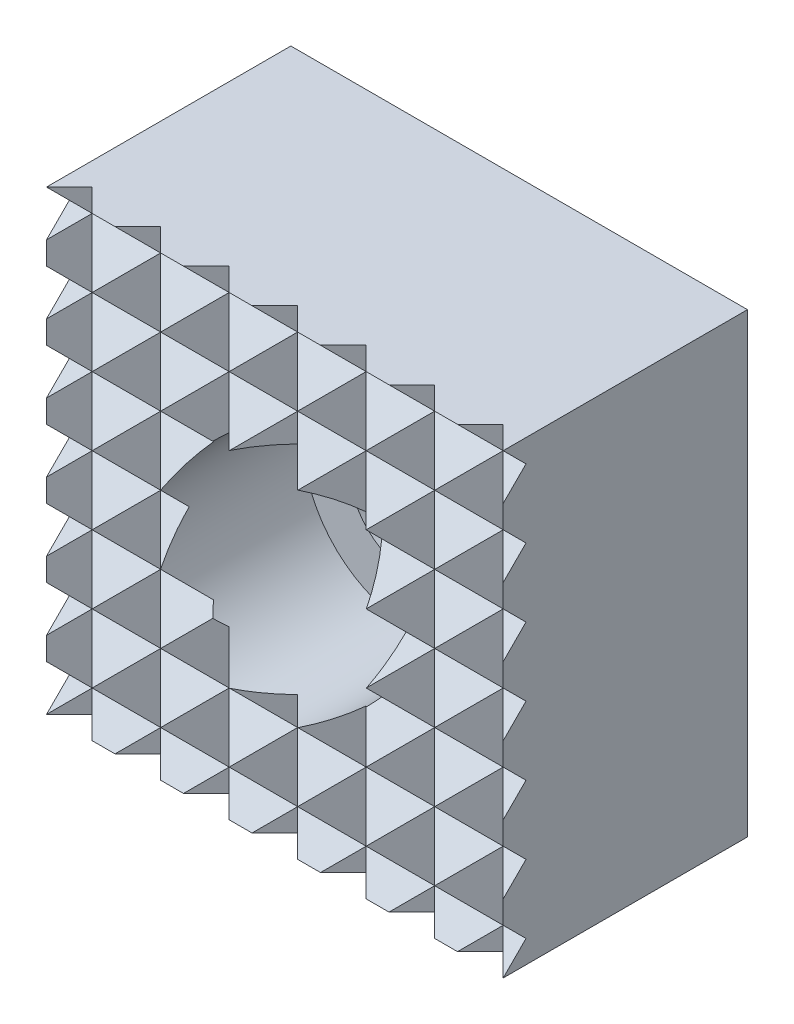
ISO-10303-21;
HEADER;
FILE_DESCRIPTION(('STEP AP214'),'2;1');
FILE_NAME('part.step','',(''),(''),'','','');
FILE_SCHEMA(('AUTOMOTIVE_DESIGN { 1 0 10303 214 1 1 1 1 }'));
ENDSEC;
DATA;
#1=APPLICATION_CONTEXT('core data for automotive mechanical design processes');
#2=APPLICATION_PROTOCOL_DEFINITION('international standard','automotive_design',2000,#1);
#3=PRODUCT_CONTEXT('',#1,'mechanical');
#4=PRODUCT('Part','Part','',(#3));
#5=PRODUCT_RELATED_PRODUCT_CATEGORY('part','',(#4));
#6=PRODUCT_DEFINITION_FORMATION('','',#4);
#7=PRODUCT_DEFINITION_CONTEXT('part definition',#1,'design');
#8=PRODUCT_DEFINITION('design','',#6,#7);
#9=PRODUCT_DEFINITION_SHAPE('','',#8);
#10=(LENGTH_UNIT() NAMED_UNIT(*) SI_UNIT(.MILLI.,.METRE.));
#11=(NAMED_UNIT(*) PLANE_ANGLE_UNIT() SI_UNIT($,.RADIAN.));
#12=(NAMED_UNIT(*) SI_UNIT($,.STERADIAN.) SOLID_ANGLE_UNIT());
#13=UNCERTAINTY_MEASURE_WITH_UNIT(LENGTH_MEASURE(1.E-05),#10,'distance_accuracy_value','');
#14=(GEOMETRIC_REPRESENTATION_CONTEXT(3) GLOBAL_UNCERTAINTY_ASSIGNED_CONTEXT((#13)) GLOBAL_UNIT_ASSIGNED_CONTEXT((#10,
#11,#12)) REPRESENTATION_CONTEXT('',''));
#15=CARTESIAN_POINT('',(0.,0.,0.));
#16=DIRECTION('',(0.,0.,1.));
#17=DIRECTION('',(1.,0.,0.));
#18=AXIS2_PLACEMENT_3D('',#15,#16,#17);
#19=CARTESIAN_POINT('',(-3.,-15.,10.5));
#20=DIRECTION('',(0.707106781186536,0.,-0.707106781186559));
#21=DIRECTION('',(-0.707106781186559,0.,-0.707106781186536));
#22=AXIS2_PLACEMENT_3D('',#19,#20,#21);
#23=PLANE('',#22);
#24=DIRECTION('',(0.,1.,0.));
#25=VECTOR('',#24,1.);
#26=CARTESIAN_POINT('',(-3.,-15.,10.5));
#27=LINE('',#26,#25);
#28=CARTESIAN_POINT('',(-3.,9.,10.5));
#29=VERTEX_POINT('',#28);
#30=CARTESIAN_POINT('',(-3.,10.,10.5));
#31=VERTEX_POINT('',#30);
#32=EDGE_CURVE('E640',#29,#31,#27,.T.);
#33=ORIENTED_EDGE('',*,*,#32,.F.);
#34=DIRECTION('',(0.577350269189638,0.577350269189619,0.577350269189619));
#35=VECTOR('',#34,1.);
#36=CARTESIAN_POINT('',(-11.,1.00000000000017,2.50000000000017));
#37=LINE('',#36,#35);
#38=CARTESIAN_POINT('',(-2.,10.,11.5));
#39=VERTEX_POINT('',#38);
#40=EDGE_CURVE('E1365',#29,#39,#37,.T.);
#41=ORIENTED_EDGE('',*,*,#40,.T.);
#42=DIRECTION('',(-0.707106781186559,0.,-0.707106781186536));
#43=VECTOR('',#42,1.);
#44=CARTESIAN_POINT('',(-5.75000000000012,10.,7.75));
#45=LINE('',#44,#43);
#46=EDGE_CURVE('E716',#39,#31,#45,.T.);
#47=ORIENTED_EDGE('',*,*,#46,.T.);
#48=EDGE_LOOP('',(#33,#41,#47));
#49=FACE_BOUND('',#48,.T.);
#50=ADVANCED_FACE('F15',(#49),#23,.F.);
#51=CARTESIAN_POINT('',(-3.,-6.,10.5));
#52=VERTEX_POINT('',#51);
#53=CARTESIAN_POINT('',(-3.,-3.68272996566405,10.5));
#54=VERTEX_POINT('',#53);
#55=EDGE_CURVE('E676',#52,#54,#27,.T.);
#56=ORIENTED_EDGE('',*,*,#55,.F.);
#57=DIRECTION('',(0.577350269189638,0.57735026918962,0.577350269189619));
#58=VECTOR('',#57,1.);
#59=CARTESIAN_POINT('',(-6.,-9.,7.5));
#60=LINE('',#59,#58);
#61=CARTESIAN_POINT('',(-1.5052038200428,-4.50520382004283,11.9947961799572));
#62=VERTEX_POINT('',#61);
#63=EDGE_CURVE('E1007',#52,#62,#60,.T.);
#64=ORIENTED_EDGE('',*,*,#63,.T.);
#65=CARTESIAN_POINT('',(0.,0.,13.5));
#66=DIRECTION('',(0.707106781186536,0.,-0.707106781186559));
#67=DIRECTION('',(0.707106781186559,0.,0.707106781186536));
#68=AXIS2_PLACEMENT_3D('',#65,#66,#67);
#69=ELLIPSE('',#68,6.71751442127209,4.75);
#70=EDGE_CURVE('E805',#54,#62,#69,.F.);
#71=ORIENTED_EDGE('',*,*,#70,.F.);
#72=EDGE_LOOP('',(#56,#64,#71));
#73=FACE_BOUND('',#72,.T.);
#74=ADVANCED_FACE('F1870',(#73),#23,.F.);
#75=CARTESIAN_POINT('',(-1.49999999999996,-15.,12.));
#76=DIRECTION('',(-0.70710678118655,0.,-0.707106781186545));
#77=DIRECTION('',(-0.707106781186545,0.,0.70710678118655));
#78=AXIS2_PLACEMENT_3D('',#75,#76,#77);
#79=PLANE('',#78);
#80=CARTESIAN_POINT('',(0.,0.,10.5));
#81=DIRECTION('',(-0.70710678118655,0.,-0.707106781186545));
#82=DIRECTION('',(-0.707106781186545,0.,0.70710678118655));
#83=AXIS2_PLACEMENT_3D('',#80,#81,#82);
#84=ELLIPSE('',#83,6.71751442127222,4.75);
#85=CARTESIAN_POINT('',(-1.48961925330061,-4.51038074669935,11.9896192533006));
#86=VERTEX_POINT('',#85);
#87=CARTESIAN_POINT('',(0.,-4.75,10.5));
#88=VERTEX_POINT('',#87);
#89=EDGE_CURVE('E809',#86,#88,#84,.F.);
#90=ORIENTED_EDGE('',*,*,#89,.F.);
#91=DIRECTION('',(0.577350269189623,-0.577350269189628,-0.577350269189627));
#92=VECTOR('',#91,1.);
#93=CARTESIAN_POINT('',(2.00000000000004,-8.,8.5));
#94=LINE('',#93,#92);
#95=CARTESIAN_POINT('',(0.,-6.,10.5));
#96=VERTEX_POINT('',#95);
#97=EDGE_CURVE('E1013',#86,#96,#94,.T.);
#98=ORIENTED_EDGE('',*,*,#97,.T.);
#99=DIRECTION('',(0.,1.,0.));
#100=VECTOR('',#99,1.);
#101=CARTESIAN_POINT('',(0.,-15.,10.5));
#102=LINE('',#101,#100);
#103=EDGE_CURVE('E644',#96,#88,#102,.T.);
#104=ORIENTED_EDGE('',*,*,#103,.T.);
#105=EDGE_LOOP('',(#90,#98,#104));
#106=FACE_BOUND('',#105,.T.);
#107=ADVANCED_FACE('F1868',(#106),#79,.F.);
#108=DIRECTION('',(-0.707106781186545,0.,0.70710678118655));
#109=VECTOR('',#108,1.);
#110=CARTESIAN_POINT('',(-5.75,10.,16.25));
#111=LINE('',#110,#109);
#112=CARTESIAN_POINT('',(0.,10.,10.5));
#113=VERTEX_POINT('',#112);
#114=CARTESIAN_POINT('',(-0.999999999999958,10.,11.5));
#115=VERTEX_POINT('',#114);
#116=EDGE_CURVE('E711',#113,#115,#111,.T.);
#117=ORIENTED_EDGE('',*,*,#116,.T.);
#118=DIRECTION('',(0.577350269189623,-0.577350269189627,-0.577350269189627));
#119=VECTOR('',#118,1.);
#120=CARTESIAN_POINT('',(7.,1.99999999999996,3.49999999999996));
#121=LINE('',#120,#119);
#122=CARTESIAN_POINT('',(0.,9.,10.5));
#123=VERTEX_POINT('',#122);
#124=EDGE_CURVE('E1372',#115,#123,#121,.T.);
#125=ORIENTED_EDGE('',*,*,#124,.T.);
#126=EDGE_CURVE('E646',#123,#113,#102,.T.);
#127=ORIENTED_EDGE('',*,*,#126,.T.);
#128=EDGE_LOOP('',(#117,#125,#127));
#129=FACE_BOUND('',#128,.T.);
#130=ADVANCED_FACE('F1800',(#129),#79,.F.);
#131=CARTESIAN_POINT('',(0.,-15.,10.5));
#132=DIRECTION('',(0.707106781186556,0.,-0.707106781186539));
#133=DIRECTION('',(-0.707106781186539,0.,-0.707106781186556));
#134=AXIS2_PLACEMENT_3D('',#131,#132,#133);
#135=PLANE('',#134);
#136=ORIENTED_EDGE('',*,*,#126,.F.);
#137=DIRECTION('',(0.577350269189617,0.57735026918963,0.57735026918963));
#138=VECTOR('',#137,1.);
#139=CARTESIAN_POINT('',(-7.9999999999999,0.999999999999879,2.49999999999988));
#140=LINE('',#139,#138);
#141=CARTESIAN_POINT('',(1.,10.,11.5));
#142=VERTEX_POINT('',#141);
#143=EDGE_CURVE('E1375',#123,#142,#140,.T.);
#144=ORIENTED_EDGE('',*,*,#143,.T.);
#145=DIRECTION('',(-0.707106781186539,0.,-0.707106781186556));
#146=VECTOR('',#145,1.);
#147=CARTESIAN_POINT('',(-4.24999999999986,10.,6.25));
#148=LINE('',#147,#146);
#149=EDGE_CURVE('E705',#142,#113,#148,.T.);
#150=ORIENTED_EDGE('',*,*,#149,.T.);
#151=EDGE_LOOP('',(#136,#144,#150));
#152=FACE_BOUND('',#151,.T.);
#153=ADVANCED_FACE('F1794',(#152),#135,.F.);
#154=ORIENTED_EDGE('',*,*,#103,.F.);
#155=DIRECTION('',(0.577350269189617,0.577350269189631,0.57735026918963));
#156=VECTOR('',#155,1.);
#157=CARTESIAN_POINT('',(-2.99999999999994,-9.,7.5));
#158=LINE('',#157,#156);
#159=CARTESIAN_POINT('',(1.48961925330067,-4.51038074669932,11.9896192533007));
#160=VERTEX_POINT('',#159);
#161=EDGE_CURVE('E1017',#96,#160,#158,.T.);
#162=ORIENTED_EDGE('',*,*,#161,.T.);
#163=CARTESIAN_POINT('',(0.,0.,10.5));
#164=DIRECTION('',(0.707106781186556,0.,-0.707106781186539));
#165=DIRECTION('',(0.707106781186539,0.,0.707106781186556));
#166=AXIS2_PLACEMENT_3D('',#163,#164,#165);
#167=ELLIPSE('',#166,6.71751442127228,4.75);
#168=EDGE_CURVE('E812',#88,#160,#167,.F.);
#169=ORIENTED_EDGE('',*,*,#168,.F.);
#170=EDGE_LOOP('',(#154,#162,#169));
#171=FACE_BOUND('',#170,.T.);
#172=ADVANCED_FACE('F1863',(#171),#135,.F.);
#173=CARTESIAN_POINT('',(1.5,-15.,12.));
#174=DIRECTION('',(-0.70710678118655,0.,-0.707106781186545));
#175=DIRECTION('',(-0.707106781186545,0.,0.70710678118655));
#176=AXIS2_PLACEMENT_3D('',#173,#174,#175);
#177=PLANE('',#176);
#178=CARTESIAN_POINT('',(0.,0.,13.5));
#179=DIRECTION('',(-0.70710678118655,0.,-0.707106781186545));
#180=DIRECTION('',(-0.707106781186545,0.,0.70710678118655));
#181=AXIS2_PLACEMENT_3D('',#178,#179,#180);
#182=ELLIPSE('',#181,6.71751442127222,4.75);
#183=CARTESIAN_POINT('',(1.50520382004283,-4.50520382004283,11.9947961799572));
#184=VERTEX_POINT('',#183);
#185=CARTESIAN_POINT('',(3.,-3.68272996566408,10.5));
#186=VERTEX_POINT('',#185);
#187=EDGE_CURVE('E816',#184,#186,#182,.F.);
#188=ORIENTED_EDGE('',*,*,#187,.F.);
#189=DIRECTION('',(0.577350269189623,-0.577350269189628,-0.577350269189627));
#190=VECTOR('',#189,1.);
#191=CARTESIAN_POINT('',(5.,-8.,8.5));
#192=LINE('',#191,#190);
#193=CARTESIAN_POINT('',(2.99999999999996,-6.,10.5));
#194=VERTEX_POINT('',#193);
#195=EDGE_CURVE('E1020',#184,#194,#192,.T.);
#196=ORIENTED_EDGE('',*,*,#195,.T.);
#197=DIRECTION('',(0.,1.,0.));
#198=VECTOR('',#197,1.);
#199=CARTESIAN_POINT('',(3.,-15.,10.5));
#200=LINE('',#199,#198);
#201=EDGE_CURVE('E651',#194,#186,#200,.T.);
#202=ORIENTED_EDGE('',*,*,#201,.T.);
#203=EDGE_LOOP('',(#188,#196,#202));
#204=FACE_BOUND('',#203,.T.);
#205=ADVANCED_FACE('F2031',(#204),#177,.F.);
#206=DIRECTION('',(-0.707106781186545,0.,0.70710678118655));
#207=VECTOR('',#206,1.);
#208=CARTESIAN_POINT('',(-4.25,10.,17.75));
#209=LINE('',#208,#207);
#210=CARTESIAN_POINT('',(3.,10.,10.5));
#211=VERTEX_POINT('',#210);
#212=CARTESIAN_POINT('',(2.,10.,11.5));
#213=VERTEX_POINT('',#212);
#214=EDGE_CURVE('E700',#211,#213,#209,.T.);
#215=ORIENTED_EDGE('',*,*,#214,.T.);
#216=DIRECTION('',(0.577350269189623,-0.577350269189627,-0.577350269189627));
#217=VECTOR('',#216,1.);
#218=CARTESIAN_POINT('',(10.,1.99999999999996,3.49999999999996));
#219=LINE('',#218,#217);
#220=CARTESIAN_POINT('',(2.99999999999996,9.,10.5));
#221=VERTEX_POINT('',#220);
#222=EDGE_CURVE('E1379',#213,#221,#219,.T.);
#223=ORIENTED_EDGE('',*,*,#222,.T.);
#224=EDGE_CURVE('E653',#221,#211,#200,.T.);
#225=ORIENTED_EDGE('',*,*,#224,.T.);
#226=EDGE_LOOP('',(#215,#223,#225));
#227=FACE_BOUND('',#226,.T.);
#228=ADVANCED_FACE('F1787',(#227),#177,.F.);
#229=CARTESIAN_POINT('',(3.,-15.,10.5));
#230=DIRECTION('',(0.707106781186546,0.,-0.707106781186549));
#231=DIRECTION('',(-0.707106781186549,0.,-0.707106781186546));
#232=AXIS2_PLACEMENT_3D('',#229,#230,#231);
#233=PLANE('',#232);
#234=ORIENTED_EDGE('',*,*,#224,.F.);
#235=DIRECTION('',(0.577350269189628,0.577350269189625,0.577350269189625));
#236=VECTOR('',#235,1.);
#237=CARTESIAN_POINT('',(-5.,1.00000000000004,2.50000000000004));
#238=LINE('',#237,#236);
#239=CARTESIAN_POINT('',(4.,10.,11.5));
#240=VERTEX_POINT('',#239);
#241=EDGE_CURVE('E1382',#221,#240,#238,.T.);
#242=ORIENTED_EDGE('',*,*,#241,.T.);
#243=DIRECTION('',(-0.707106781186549,0.,-0.707106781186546));
#244=VECTOR('',#243,1.);
#245=CARTESIAN_POINT('',(-2.75000000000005,10.,4.75));
#246=LINE('',#245,#244);
#247=EDGE_CURVE('E694',#240,#211,#246,.T.);
#248=ORIENTED_EDGE('',*,*,#247,.T.);
#249=EDGE_LOOP('',(#234,#242,#248));
#250=FACE_BOUND('',#249,.T.);
#251=ADVANCED_FACE('F1778',(#250),#233,.F.);
#252=DIRECTION('',(0.577350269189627,0.577350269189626,0.577350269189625));
#253=VECTOR('',#252,1.);
#254=CARTESIAN_POINT('',(0.,-9.,7.5));
#255=LINE('',#254,#253);
#256=CARTESIAN_POINT('',(4.49999999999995,-4.5,12.));
#257=VERTEX_POINT('',#256);
#258=EDGE_CURVE('E1023',#194,#257,#255,.T.);
#259=ORIENTED_EDGE('',*,*,#258,.T.);
#260=DIRECTION('',(-0.577350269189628,0.577350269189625,-0.577350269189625));
#261=VECTOR('',#260,1.);
#262=CARTESIAN_POINT('',(7.,-7.,14.5));
#263=LINE('',#262,#261);
#264=CARTESIAN_POINT('',(3.35875721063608,-3.35875721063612,10.8587572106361));
#265=VERTEX_POINT('',#264);
#266=EDGE_CURVE('E1071',#257,#265,#263,.T.);
#267=ORIENTED_EDGE('',*,*,#266,.T.);
#268=CARTESIAN_POINT('',(0.,0.,7.5));
#269=DIRECTION('',(0.707106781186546,0.,-0.707106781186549));
#270=DIRECTION('',(0.707106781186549,0.,0.707106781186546));
#271=AXIS2_PLACEMENT_3D('',#268,#269,#270);
#272=ELLIPSE('',#271,6.71751442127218,4.75);
#273=EDGE_CURVE('E819',#186,#265,#272,.F.);
#274=ORIENTED_EDGE('',*,*,#273,.F.);
#275=ORIENTED_EDGE('',*,*,#201,.F.);
#276=EDGE_LOOP('',(#259,#267,#274,#275));
#277=FACE_BOUND('',#276,.T.);
#278=ADVANCED_FACE('F2009',(#277),#233,.F.);
#279=CARTESIAN_POINT('',(4.49999999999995,-15.,12.));
#280=DIRECTION('',(-0.707106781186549,0.,-0.707106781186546));
#281=DIRECTION('',(-0.707106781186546,0.,0.707106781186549));
#282=AXIS2_PLACEMENT_3D('',#279,#280,#281);
#283=PLANE('',#282);
#284=CARTESIAN_POINT('',(0.,0.,16.5));
#285=DIRECTION('',(-0.707106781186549,0.,-0.707106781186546));
#286=DIRECTION('',(-0.707106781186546,0.,0.707106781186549));
#287=AXIS2_PLACEMENT_3D('',#284,#285,#286);
#288=ELLIPSE('',#287,6.71751442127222,4.75);
#289=CARTESIAN_POINT('',(4.51038074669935,1.48961925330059,11.9896192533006));
#290=VERTEX_POINT('',#289);
#291=CARTESIAN_POINT('',(4.50520382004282,1.50520382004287,11.9947961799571));
#292=VERTEX_POINT('',#291);
#293=EDGE_CURVE('E820',#290,#292,#288,.F.);
#294=ORIENTED_EDGE('',*,*,#293,.F.);
#295=DIRECTION('',(0.577350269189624,-0.577350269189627,-0.577350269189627));
#296=VECTOR('',#295,1.);
#297=CARTESIAN_POINT('',(10.,-4.,6.5));
#298=LINE('',#297,#296);
#299=CARTESIAN_POINT('',(6.,0.,10.5));
#300=VERTEX_POINT('',#299);
#301=EDGE_CURVE('E1162',#290,#300,#298,.T.);
#302=ORIENTED_EDGE('',*,*,#301,.T.);
#303=DIRECTION('',(0.,1.,0.));
#304=VECTOR('',#303,1.);
#305=CARTESIAN_POINT('',(6.,-15.,10.5));
#306=LINE('',#305,#304);
#307=CARTESIAN_POINT('',(6.,3.,10.5));
#308=VERTEX_POINT('',#307);
#309=EDGE_CURVE('E1661',#300,#308,#306,.T.);
#310=ORIENTED_EDGE('',*,*,#309,.T.);
#311=DIRECTION('',(-0.577350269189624,-0.577350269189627,0.577350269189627));
#312=VECTOR('',#311,1.);
#313=CARTESIAN_POINT('',(-1.00000000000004,-4.,17.5));
#314=LINE('',#313,#312);
#315=EDGE_CURVE('E634',#308,#292,#314,.T.);
#316=ORIENTED_EDGE('',*,*,#315,.T.);
#317=EDGE_LOOP('',(#294,#302,#310,#316));
#318=FACE_BOUND('',#317,.T.);
#319=ADVANCED_FACE('F2011',(#318),#283,.F.);
#320=CARTESIAN_POINT('',(6.,-3.,10.5));
#321=VERTEX_POINT('',#320);
#322=EDGE_CURVE('E1734',#321,#300,#306,.T.);
#323=ORIENTED_EDGE('',*,*,#322,.T.);
#324=DIRECTION('',(-0.577350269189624,-0.577350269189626,0.577350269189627));
#325=VECTOR('',#324,1.);
#326=CARTESIAN_POINT('',(0.,-6.,16.5));
#327=LINE('',#326,#325);
#328=CARTESIAN_POINT('',(4.51038074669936,-1.48961925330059,11.9896192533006));
#329=VERTEX_POINT('',#328);
#330=EDGE_CURVE('E1132',#300,#329,#327,.T.);
#331=ORIENTED_EDGE('',*,*,#330,.T.);
#332=CARTESIAN_POINT('',(4.50520382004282,-1.50520382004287,11.9947961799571));
#333=VERTEX_POINT('',#332);
#334=EDGE_CURVE('E823',#333,#329,#288,.F.);
#335=ORIENTED_EDGE('',*,*,#334,.F.);
#336=DIRECTION('',(0.577350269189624,-0.577350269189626,-0.577350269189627));
#337=VECTOR('',#336,1.);
#338=CARTESIAN_POINT('',(9.,-6.,7.5));
#339=LINE('',#338,#337);
#340=EDGE_CURVE('E1102',#333,#321,#339,.T.);
#341=ORIENTED_EDGE('',*,*,#340,.T.);
#342=EDGE_LOOP('',(#323,#331,#335,#341));
#343=FACE_BOUND('',#342,.T.);
#344=ADVANCED_FACE('F1755',(#343),#283,.F.);
#345=DIRECTION('',(-0.707106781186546,0.,0.707106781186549));
#346=VECTOR('',#345,1.);
#347=CARTESIAN_POINT('',(-2.75,10.,19.25));
#348=LINE('',#347,#346);
#349=CARTESIAN_POINT('',(6.,10.,10.5));
#350=VERTEX_POINT('',#349);
#351=CARTESIAN_POINT('',(4.99999999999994,10.,11.5));
#352=VERTEX_POINT('',#351);
#353=EDGE_CURVE('E689',#350,#352,#348,.T.);
#354=ORIENTED_EDGE('',*,*,#353,.T.);
#355=DIRECTION('',(0.577350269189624,-0.577350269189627,-0.577350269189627));
#356=VECTOR('',#355,1.);
#357=CARTESIAN_POINT('',(13.,1.99999999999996,3.5));
#358=LINE('',#357,#356);
#359=CARTESIAN_POINT('',(6.,9.,10.5));
#360=VERTEX_POINT('',#359);
#361=EDGE_CURVE('E1386',#352,#360,#358,.T.);
#362=ORIENTED_EDGE('',*,*,#361,.T.);
#363=EDGE_CURVE('E659',#360,#350,#306,.T.);
#364=ORIENTED_EDGE('',*,*,#363,.T.);
#365=EDGE_LOOP('',(#354,#362,#364));
#366=FACE_BOUND('',#365,.T.);
#367=ADVANCED_FACE('F1771',(#366),#283,.F.);
#368=CARTESIAN_POINT('',(6.,-10.,10.5));
#369=VERTEX_POINT('',#368);
#370=CARTESIAN_POINT('',(6.,-9.,10.5));
#371=VERTEX_POINT('',#370);
#372=EDGE_CURVE('E655',#369,#371,#306,.T.);
#373=ORIENTED_EDGE('',*,*,#372,.T.);
#374=DIRECTION('',(-0.577350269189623,-0.577350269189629,0.577350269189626));
#375=VECTOR('',#374,1.);
#376=CARTESIAN_POINT('',(2.99999999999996,-12.,13.5));
#377=LINE('',#376,#375);
#378=CARTESIAN_POINT('',(5.,-10.,11.5));
#379=VERTEX_POINT('',#378);
#380=EDGE_CURVE('E1438',#371,#379,#377,.T.);
#381=ORIENTED_EDGE('',*,*,#380,.T.);
#382=DIRECTION('',(0.707106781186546,0.,-0.707106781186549));
#383=VECTOR('',#382,1.);
#384=CARTESIAN_POINT('',(7.25,-10.,9.25));
#385=LINE('',#384,#383);
#386=EDGE_CURVE('E692',#379,#369,#385,.T.);
#387=ORIENTED_EDGE('',*,*,#386,.T.);
#388=EDGE_LOOP('',(#373,#381,#387));
#389=FACE_BOUND('',#388,.T.);
#390=ADVANCED_FACE('F2806',(#389),#283,.F.);
#391=CARTESIAN_POINT('',(-6.,-15.,10.5));
#392=DIRECTION('',(0.707106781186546,0.,-0.707106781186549));
#393=DIRECTION('',(-0.707106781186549,0.,-0.707106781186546));
#394=AXIS2_PLACEMENT_3D('',#391,#392,#393);
#395=PLANE('',#394);
#396=DIRECTION('',(0.,1.,0.));
#397=VECTOR('',#396,1.);
#398=CARTESIAN_POINT('',(-6.,-15.,10.5));
#399=LINE('',#398,#397);
#400=CARTESIAN_POINT('',(-6.,0.,10.5));
#401=VERTEX_POINT('',#400);
#402=CARTESIAN_POINT('',(-6.,3.,10.5));
#403=VERTEX_POINT('',#402);
#404=EDGE_CURVE('E1177',#401,#403,#399,.T.);
#405=ORIENTED_EDGE('',*,*,#404,.F.);
#406=DIRECTION('',(0.577350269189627,0.577350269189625,0.577350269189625));
#407=VECTOR('',#406,1.);
#408=CARTESIAN_POINT('',(-11.,-5.,5.5));
#409=LINE('',#408,#407);
#410=CARTESIAN_POINT('',(-4.5103807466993,1.48961925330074,11.9896192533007));
#411=VERTEX_POINT('',#410);
#412=EDGE_CURVE('E1144',#401,#411,#409,.T.);
#413=ORIENTED_EDGE('',*,*,#412,.T.);
#414=CARTESIAN_POINT('',(0.,0.,16.5));
#415=DIRECTION('',(0.707106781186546,0.,-0.707106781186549));
#416=DIRECTION('',(0.707106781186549,0.,0.707106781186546));
#417=AXIS2_PLACEMENT_3D('',#414,#415,#416);
#418=ELLIPSE('',#417,6.71751442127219,4.75);
#419=CARTESIAN_POINT('',(-4.50520382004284,1.5052038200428,11.9947961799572));
#420=VERTEX_POINT('',#419);
#421=EDGE_CURVE('E802',#420,#411,#418,.F.);
#422=ORIENTED_EDGE('',*,*,#421,.F.);
#423=DIRECTION('',(-0.577350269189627,0.577350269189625,-0.577350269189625));
#424=VECTOR('',#423,1.);
#425=CARTESIAN_POINT('',(0.,-3.,16.5));
#426=LINE('',#425,#424);
#427=EDGE_CURVE('E624',#420,#403,#426,.T.);
#428=ORIENTED_EDGE('',*,*,#427,.T.);
#429=EDGE_LOOP('',(#405,#413,#422,#428));
#430=FACE_BOUND('',#429,.T.);
#431=ADVANCED_FACE('F1175',(#430),#395,.F.);
#432=CARTESIAN_POINT('',(-4.5103807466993,-1.48961925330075,11.9896192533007));
#433=VERTEX_POINT('',#432);
#434=CARTESIAN_POINT('',(-4.50520382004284,-1.50520382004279,11.9947961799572));
#435=VERTEX_POINT('',#434);
#436=EDGE_CURVE('E798',#433,#435,#418,.F.);
#437=ORIENTED_EDGE('',*,*,#436,.F.);
#438=DIRECTION('',(-0.577350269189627,0.577350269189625,-0.577350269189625));
#439=VECTOR('',#438,1.);
#440=CARTESIAN_POINT('',(-1.00000000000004,-5.,15.5));
#441=LINE('',#440,#439);
#442=EDGE_CURVE('E1114',#433,#401,#441,.T.);
#443=ORIENTED_EDGE('',*,*,#442,.T.);
#444=CARTESIAN_POINT('',(-6.,-3.,10.5));
#445=VERTEX_POINT('',#444);
#446=EDGE_CURVE('E3729',#445,#401,#399,.T.);
#447=ORIENTED_EDGE('',*,*,#446,.F.);
#448=DIRECTION('',(0.577350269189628,0.577350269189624,0.577350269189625));
#449=VECTOR('',#448,1.);
#450=CARTESIAN_POINT('',(-10.,-7.,6.5));
#451=LINE('',#450,#449);
#452=EDGE_CURVE('E1083',#445,#435,#451,.T.);
#453=ORIENTED_EDGE('',*,*,#452,.T.);
#454=EDGE_LOOP('',(#437,#443,#447,#453));
#455=FACE_BOUND('',#454,.T.);
#456=ADVANCED_FACE('F2465',(#455),#395,.F.);
#457=CARTESIAN_POINT('',(-6.,9.,10.5));
#458=VERTEX_POINT('',#457);
#459=CARTESIAN_POINT('',(-6.,10.,10.5));
#460=VERTEX_POINT('',#459);
#461=EDGE_CURVE('E673',#458,#460,#399,.T.);
#462=ORIENTED_EDGE('',*,*,#461,.F.);
#463=DIRECTION('',(0.577350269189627,0.577350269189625,0.577350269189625));
#464=VECTOR('',#463,1.);
#465=CARTESIAN_POINT('',(-14.,1.00000000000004,2.5));
#466=LINE('',#465,#464);
#467=CARTESIAN_POINT('',(-5.,10.,11.5));
#468=VERTEX_POINT('',#467);
#469=EDGE_CURVE('E1349',#458,#468,#466,.T.);
#470=ORIENTED_EDGE('',*,*,#469,.T.);
#471=DIRECTION('',(-0.707106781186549,0.,-0.707106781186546));
#472=VECTOR('',#471,1.);
#473=CARTESIAN_POINT('',(-7.25,10.,9.25));
#474=LINE('',#473,#472);
#475=EDGE_CURVE('E684',#468,#460,#474,.T.);
#476=ORIENTED_EDGE('',*,*,#475,.T.);
#477=EDGE_LOOP('',(#462,#470,#476));
#478=FACE_BOUND('',#477,.T.);
#479=ADVANCED_FACE('F1522',(#478),#395,.F.);
#480=DIRECTION('',(0.707106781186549,0.,0.707106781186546));
#481=VECTOR('',#480,1.);
#482=CARTESIAN_POINT('',(2.75,-10.,19.25));
#483=LINE('',#482,#481);
#484=CARTESIAN_POINT('',(-6.,-10.,10.5));
#485=VERTEX_POINT('',#484);
#486=CARTESIAN_POINT('',(-5.00000000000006,-10.,11.5));
#487=VERTEX_POINT('',#486);
#488=EDGE_CURVE('E686',#485,#487,#483,.T.);
#489=ORIENTED_EDGE('',*,*,#488,.T.);
#490=DIRECTION('',(-0.577350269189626,0.577350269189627,-0.577350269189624));
#491=VECTOR('',#490,1.);
#492=CARTESIAN_POINT('',(-4.,-11.,12.5));
#493=LINE('',#492,#491);
#494=CARTESIAN_POINT('',(-6.,-9.,10.5));
#495=VERTEX_POINT('',#494);
#496=EDGE_CURVE('E1401',#487,#495,#493,.T.);
#497=ORIENTED_EDGE('',*,*,#496,.T.);
#498=EDGE_CURVE('E670',#485,#495,#399,.T.);
#499=ORIENTED_EDGE('',*,*,#498,.F.);
#500=EDGE_LOOP('',(#489,#497,#499));
#501=FACE_BOUND('',#500,.T.);
#502=ADVANCED_FACE('F2344',(#501),#395,.F.);
#503=CARTESIAN_POINT('',(-4.5,-15.,12.));
#504=DIRECTION('',(-0.707106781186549,0.,-0.707106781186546));
#505=DIRECTION('',(-0.707106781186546,0.,0.707106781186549));
#506=AXIS2_PLACEMENT_3D('',#503,#504,#505);
#507=PLANE('',#506);
#508=CARTESIAN_POINT('',(0.,0.,7.5));
#509=DIRECTION('',(-0.707106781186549,0.,-0.707106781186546));
#510=DIRECTION('',(-0.707106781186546,0.,0.707106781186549));
#511=AXIS2_PLACEMENT_3D('',#508,#509,#510);
#512=ELLIPSE('',#511,6.71751442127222,4.75);
#513=CARTESIAN_POINT('',(-3.35875721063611,-3.35875721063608,10.8587572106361));
#514=VERTEX_POINT('',#513);
#515=EDGE_CURVE('E799',#514,#54,#512,.F.);
#516=ORIENTED_EDGE('',*,*,#515,.F.);
#517=DIRECTION('',(-0.577350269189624,-0.577350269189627,0.577350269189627));
#518=VECTOR('',#517,1.);
#519=CARTESIAN_POINT('',(-8.,-8.,15.5));
#520=LINE('',#519,#518);
#521=CARTESIAN_POINT('',(-4.5,-4.5,12.));
#522=VERTEX_POINT('',#521);
#523=EDGE_CURVE('E1053',#514,#522,#520,.T.);
#524=ORIENTED_EDGE('',*,*,#523,.T.);
#525=DIRECTION('',(0.577350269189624,-0.577350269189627,-0.577350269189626));
#526=VECTOR('',#525,1.);
#527=CARTESIAN_POINT('',(-1.00000000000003,-8.,8.5));
#528=LINE('',#527,#526);
#529=EDGE_CURVE('E1004',#522,#52,#528,.T.);
#530=ORIENTED_EDGE('',*,*,#529,.T.);
#531=ORIENTED_EDGE('',*,*,#55,.T.);
#532=EDGE_LOOP('',(#516,#524,#530,#531));
#533=FACE_BOUND('',#532,.T.);
#534=ADVANCED_FACE('F1992',(#533),#507,.F.);
#535=DIRECTION('',(-0.707106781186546,0.,0.707106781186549));
#536=VECTOR('',#535,1.);
#537=CARTESIAN_POINT('',(-7.25,10.,14.75));
#538=LINE('',#537,#536);
#539=CARTESIAN_POINT('',(-4.,10.,11.5));
#540=VERTEX_POINT('',#539);
#541=EDGE_CURVE('E679',#31,#540,#538,.T.);
#542=ORIENTED_EDGE('',*,*,#541,.T.);
#543=DIRECTION('',(0.577350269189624,-0.577350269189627,-0.577350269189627));
#544=VECTOR('',#543,1.);
#545=CARTESIAN_POINT('',(3.99999999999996,2.,3.5));
#546=LINE('',#545,#544);
#547=EDGE_CURVE('E1362',#540,#29,#546,.T.);
#548=ORIENTED_EDGE('',*,*,#547,.T.);
#549=ORIENTED_EDGE('',*,*,#32,.T.);
#550=EDGE_LOOP('',(#542,#548,#549));
#551=FACE_BOUND('',#550,.T.);
#552=ADVANCED_FACE('F1541',(#551),#507,.F.);
#553=CARTESIAN_POINT('',(6.,-15.,10.5));
#554=DIRECTION('',(0.707106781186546,0.,-0.707106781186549));
#555=DIRECTION('',(-0.707106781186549,0.,-0.707106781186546));
#556=AXIS2_PLACEMENT_3D('',#553,#554,#555);
#557=PLANE('',#556);
#558=DIRECTION('',(0.707106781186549,0.,0.707106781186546));
#559=VECTOR('',#558,1.);
#560=CARTESIAN_POINT('',(8.75,-10.,13.25));
#561=LINE('',#560,#559);
#562=CARTESIAN_POINT('',(7.,-10.,11.5));
#563=VERTEX_POINT('',#562);
#564=EDGE_CURVE('E743',#369,#563,#561,.T.);
#565=ORIENTED_EDGE('',*,*,#564,.T.);
#566=DIRECTION('',(-0.577350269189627,0.577350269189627,-0.577350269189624));
#567=VECTOR('',#566,1.);
#568=CARTESIAN_POINT('',(8.,-11.,12.5));
#569=LINE('',#568,#567);
#570=EDGE_CURVE('E1441',#563,#371,#569,.T.);
#571=ORIENTED_EDGE('',*,*,#570,.T.);
#572=ORIENTED_EDGE('',*,*,#372,.F.);
#573=EDGE_LOOP('',(#565,#571,#572));
#574=FACE_BOUND('',#573,.T.);
#575=ADVANCED_FACE('F2363',(#574),#557,.F.);
#576=ORIENTED_EDGE('',*,*,#322,.F.);
#577=DIRECTION('',(0.577350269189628,0.577350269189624,0.577350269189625));
#578=VECTOR('',#577,1.);
#579=CARTESIAN_POINT('',(1.99999999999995,-7.,6.5));
#580=LINE('',#579,#578);
#581=CARTESIAN_POINT('',(7.5,-1.5,12.));
#582=VERTEX_POINT('',#581);
#583=EDGE_CURVE('E1099',#321,#582,#580,.T.);
#584=ORIENTED_EDGE('',*,*,#583,.T.);
#585=DIRECTION('',(-0.577350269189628,0.577350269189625,-0.577350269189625));
#586=VECTOR('',#585,1.);
#587=CARTESIAN_POINT('',(11.,-5.,15.5));
#588=LINE('',#587,#586);
#589=EDGE_CURVE('E1129',#582,#300,#588,.T.);
#590=ORIENTED_EDGE('',*,*,#589,.T.);
#591=EDGE_LOOP('',(#576,#584,#590));
#592=FACE_BOUND('',#591,.T.);
#593=ADVANCED_FACE('F1759',(#592),#557,.F.);
#594=ORIENTED_EDGE('',*,*,#363,.F.);
#595=DIRECTION('',(0.577350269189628,0.577350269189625,0.577350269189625));
#596=VECTOR('',#595,1.);
#597=CARTESIAN_POINT('',(-2.00000000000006,1.00000000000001,2.5));
#598=LINE('',#597,#596);
#599=CARTESIAN_POINT('',(7.,10.,11.5));
#600=VERTEX_POINT('',#599);
#601=EDGE_CURVE('E1389',#360,#600,#598,.T.);
#602=ORIENTED_EDGE('',*,*,#601,.T.);
#603=DIRECTION('',(-0.707106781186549,0.,-0.707106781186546));
#604=VECTOR('',#603,1.);
#605=CARTESIAN_POINT('',(-1.25000000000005,10.,3.25));
#606=LINE('',#605,#604);
#607=EDGE_CURVE('E833',#600,#350,#606,.T.);
#608=ORIENTED_EDGE('',*,*,#607,.T.);
#609=EDGE_LOOP('',(#594,#602,#608));
#610=FACE_BOUND('',#609,.T.);
#611=ADVANCED_FACE('F1773',(#610),#557,.F.);
#612=ORIENTED_EDGE('',*,*,#309,.F.);
#613=DIRECTION('',(0.577350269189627,0.577350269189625,0.577350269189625));
#614=VECTOR('',#613,1.);
#615=CARTESIAN_POINT('',(0.999999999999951,-5.,5.5));
#616=LINE('',#615,#614);
#617=CARTESIAN_POINT('',(7.5,1.5,12.));
#618=VERTEX_POINT('',#617);
#619=EDGE_CURVE('E1159',#300,#618,#616,.T.);
#620=ORIENTED_EDGE('',*,*,#619,.T.);
#621=DIRECTION('',(-0.577350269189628,0.577350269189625,-0.577350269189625));
#622=VECTOR('',#621,1.);
#623=CARTESIAN_POINT('',(12.,-3.,16.5));
#624=LINE('',#623,#622);
#625=EDGE_CURVE('E631',#618,#308,#624,.T.);
#626=ORIENTED_EDGE('',*,*,#625,.T.);
#627=EDGE_LOOP('',(#612,#620,#626));
#628=FACE_BOUND('',#627,.T.);
#629=ADVANCED_FACE('F1659',(#628),#557,.F.);
#630=CARTESIAN_POINT('',(7.5,-15.,12.));
#631=DIRECTION('',(-0.707106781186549,0.,-0.707106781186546));
#632=DIRECTION('',(-0.707106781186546,0.,0.707106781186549));
#633=AXIS2_PLACEMENT_3D('',#630,#631,#632);
#634=PLANE('',#633);
#635=DIRECTION('',(0.,1.,0.));
#636=VECTOR('',#635,1.);
#637=CARTESIAN_POINT('',(9.,-15.,10.5));
#638=LINE('',#637,#636);
#639=CARTESIAN_POINT('',(9.,-10.,10.5));
#640=VERTEX_POINT('',#639);
#641=CARTESIAN_POINT('',(9.,-9.,10.5));
#642=VERTEX_POINT('',#641);
#643=EDGE_CURVE('E660',#640,#642,#638,.T.);
#644=ORIENTED_EDGE('',*,*,#643,.T.);
#645=DIRECTION('',(-0.577350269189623,-0.577350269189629,0.577350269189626));
#646=VECTOR('',#645,1.);
#647=CARTESIAN_POINT('',(6.,-12.,13.5));
#648=LINE('',#647,#646);
#649=CARTESIAN_POINT('',(8.,-10.,11.5));
#650=VERTEX_POINT('',#649);
#651=EDGE_CURVE('E1444',#642,#650,#648,.T.);
#652=ORIENTED_EDGE('',*,*,#651,.T.);
#653=DIRECTION('',(0.707106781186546,0.,-0.707106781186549));
#654=VECTOR('',#653,1.);
#655=CARTESIAN_POINT('',(8.75,-10.,10.75));
#656=LINE('',#655,#654);
#657=EDGE_CURVE('E741',#650,#640,#656,.T.);
#658=ORIENTED_EDGE('',*,*,#657,.T.);
#659=EDGE_LOOP('',(#644,#652,#658));
#660=FACE_BOUND('',#659,.T.);
#661=ADVANCED_FACE('F2094',(#660),#634,.F.);
#662=DIRECTION('',(-0.577350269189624,-0.577350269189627,0.577350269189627));
#663=VECTOR('',#662,1.);
#664=CARTESIAN_POINT('',(5.,-10.,14.5));
#665=LINE('',#664,#663);
#666=CARTESIAN_POINT('',(9.,-6.,10.5));
#667=VERTEX_POINT('',#666);
#668=CARTESIAN_POINT('',(7.5,-7.5,12.));
#669=VERTEX_POINT('',#668);
#670=EDGE_CURVE('E984',#667,#669,#665,.T.);
#671=ORIENTED_EDGE('',*,*,#670,.T.);
#672=DIRECTION('',(0.577350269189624,-0.577350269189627,-0.577350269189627));
#673=VECTOR('',#672,1.);
#674=CARTESIAN_POINT('',(10.,-10.,9.5));
#675=LINE('',#674,#673);
#676=EDGE_CURVE('E947',#669,#642,#675,.T.);
#677=ORIENTED_EDGE('',*,*,#676,.T.);
#678=EDGE_CURVE('E663',#642,#667,#638,.T.);
#679=ORIENTED_EDGE('',*,*,#678,.T.);
#680=EDGE_LOOP('',(#671,#677,#679));
#681=FACE_BOUND('',#680,.T.);
#682=ADVANCED_FACE('F1457',(#681),#634,.F.);
#683=DIRECTION('',(-0.577350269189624,-0.577350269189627,0.577350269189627));
#684=VECTOR('',#683,1.);
#685=CARTESIAN_POINT('',(4.,-8.,15.5));
#686=LINE('',#685,#684);
#687=CARTESIAN_POINT('',(9.,-3.,10.5));
#688=VERTEX_POINT('',#687);
#689=CARTESIAN_POINT('',(7.5,-4.5,12.));
#690=VERTEX_POINT('',#689);
#691=EDGE_CURVE('E1063',#688,#690,#686,.T.);
#692=ORIENTED_EDGE('',*,*,#691,.T.);
#693=DIRECTION('',(0.577350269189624,-0.577350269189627,-0.577350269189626));
#694=VECTOR('',#693,1.);
#695=CARTESIAN_POINT('',(11.,-8.,8.5));
#696=LINE('',#695,#694);
#697=EDGE_CURVE('E1032',#690,#667,#696,.T.);
#698=ORIENTED_EDGE('',*,*,#697,.T.);
#699=EDGE_CURVE('E1467',#667,#688,#638,.T.);
#700=ORIENTED_EDGE('',*,*,#699,.T.);
#701=EDGE_LOOP('',(#692,#698,#700));
#702=FACE_BOUND('',#701,.T.);
#703=ADVANCED_FACE('F2102',(#702),#634,.F.);
#704=DIRECTION('',(-0.577350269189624,-0.577350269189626,0.577350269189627));
#705=VECTOR('',#704,1.);
#706=CARTESIAN_POINT('',(2.99999999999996,-6.,16.5));
#707=LINE('',#706,#705);
#708=CARTESIAN_POINT('',(9.,0.,10.5));
#709=VERTEX_POINT('',#708);
#710=EDGE_CURVE('E1126',#709,#582,#707,.T.);
#711=ORIENTED_EDGE('',*,*,#710,.T.);
#712=DIRECTION('',(0.577350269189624,-0.577350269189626,-0.577350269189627));
#713=VECTOR('',#712,1.);
#714=CARTESIAN_POINT('',(12.,-6.,7.5));
#715=LINE('',#714,#713);
#716=EDGE_CURVE('E1096',#582,#688,#715,.T.);
#717=ORIENTED_EDGE('',*,*,#716,.T.);
#718=EDGE_CURVE('E1469',#688,#709,#638,.T.);
#719=ORIENTED_EDGE('',*,*,#718,.T.);
#720=EDGE_LOOP('',(#711,#717,#719));
#721=FACE_BOUND('',#720,.T.);
#722=ADVANCED_FACE('F2128',(#721),#634,.F.);
#723=DIRECTION('',(-0.707106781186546,0.,0.707106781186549));
#724=VECTOR('',#723,1.);
#725=CARTESIAN_POINT('',(-1.25,10.,20.75));
#726=LINE('',#725,#724);
#727=CARTESIAN_POINT('',(9.,10.,10.5));
#728=VERTEX_POINT('',#727);
#729=CARTESIAN_POINT('',(8.,10.,11.5));
#730=VERTEX_POINT('',#729);
#731=EDGE_CURVE('E836',#728,#730,#726,.T.);
#732=ORIENTED_EDGE('',*,*,#731,.T.);
#733=DIRECTION('',(0.577350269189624,-0.577350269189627,-0.577350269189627));
#734=VECTOR('',#733,1.);
#735=CARTESIAN_POINT('',(16.,1.99999999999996,3.49999999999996));
#736=LINE('',#735,#734);
#737=CARTESIAN_POINT('',(9.,9.,10.5));
#738=VERTEX_POINT('',#737);
#739=EDGE_CURVE('E1392',#730,#738,#736,.T.);
#740=ORIENTED_EDGE('',*,*,#739,.T.);
#741=EDGE_CURVE('E664',#738,#728,#638,.T.);
#742=ORIENTED_EDGE('',*,*,#741,.T.);
#743=EDGE_LOOP('',(#732,#740,#742));
#744=FACE_BOUND('',#743,.T.);
#745=ADVANCED_FACE('F1490',(#744),#634,.F.);
#746=CARTESIAN_POINT('',(9.,6.,10.5));
#747=VERTEX_POINT('',#746);
#748=EDGE_CURVE('E1481',#747,#738,#638,.T.);
#749=ORIENTED_EDGE('',*,*,#748,.T.);
#750=DIRECTION('',(-0.577350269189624,-0.577350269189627,0.577350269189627));
#751=VECTOR('',#750,1.);
#752=CARTESIAN_POINT('',(0.,0.,19.5));
#753=LINE('',#752,#751);
#754=CARTESIAN_POINT('',(7.5,7.5,12.));
#755=VERTEX_POINT('',#754);
#756=EDGE_CURVE('E1341',#738,#755,#753,.T.);
#757=ORIENTED_EDGE('',*,*,#756,.T.);
#758=DIRECTION('',(0.577350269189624,-0.577350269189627,-0.577350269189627));
#759=VECTOR('',#758,1.);
#760=CARTESIAN_POINT('',(15.,0.,4.5));
#761=LINE('',#760,#759);
#762=EDGE_CURVE('E1298',#755,#747,#761,.T.);
#763=ORIENTED_EDGE('',*,*,#762,.T.);
#764=EDGE_LOOP('',(#749,#757,#763));
#765=FACE_BOUND('',#764,.T.);
#766=ADVANCED_FACE('F2118',(#765),#634,.F.);
#767=DIRECTION('',(-0.577350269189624,-0.577350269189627,0.577350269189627));
#768=VECTOR('',#767,1.);
#769=CARTESIAN_POINT('',(1.99999999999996,-4.,17.5));
#770=LINE('',#769,#768);
#771=CARTESIAN_POINT('',(9.,3.,10.5));
#772=VERTEX_POINT('',#771);
#773=EDGE_CURVE('E621',#772,#618,#770,.T.);
#774=ORIENTED_EDGE('',*,*,#773,.T.);
#775=DIRECTION('',(0.577350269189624,-0.577350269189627,-0.577350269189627));
#776=VECTOR('',#775,1.);
#777=CARTESIAN_POINT('',(13.,-4.,6.5));
#778=LINE('',#777,#776);
#779=EDGE_CURVE('E1156',#618,#709,#778,.T.);
#780=ORIENTED_EDGE('',*,*,#779,.T.);
#781=EDGE_CURVE('E1473',#709,#772,#638,.T.);
#782=ORIENTED_EDGE('',*,*,#781,.T.);
#783=EDGE_LOOP('',(#774,#780,#782));
#784=FACE_BOUND('',#783,.T.);
#785=ADVANCED_FACE('F1655',(#784),#634,.F.);
#786=CARTESIAN_POINT('',(9.,-15.,10.5));
#787=DIRECTION('',(0.707106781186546,0.,-0.70710678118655));
#788=DIRECTION('',(-0.70710678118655,0.,-0.707106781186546));
#789=AXIS2_PLACEMENT_3D('',#786,#787,#788);
#790=PLANE('',#789);
#791=ORIENTED_EDGE('',*,*,#781,.F.);
#792=DIRECTION('',(0.577350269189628,0.577350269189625,0.577350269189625));
#793=VECTOR('',#792,1.);
#794=CARTESIAN_POINT('',(3.99999999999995,-5.,5.5));
#795=LINE('',#794,#793);
#796=CARTESIAN_POINT('',(10.,1.00000000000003,11.5));
#797=VERTEX_POINT('',#796);
#798=EDGE_CURVE('E1153',#709,#797,#795,.T.);
#799=ORIENTED_EDGE('',*,*,#798,.T.);
#800=DIRECTION('',(0.,-1.,0.));
#801=VECTOR('',#800,1.);
#802=CARTESIAN_POINT('',(10.,-10.,11.5));
#803=LINE('',#802,#801);
#804=CARTESIAN_POINT('',(10.,1.99999999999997,11.5));
#805=VERTEX_POINT('',#804);
#806=EDGE_CURVE('E2144',#805,#797,#803,.T.);
#807=ORIENTED_EDGE('',*,*,#806,.F.);
#808=DIRECTION('',(-0.577350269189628,0.577350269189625,-0.577350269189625));
#809=VECTOR('',#808,1.);
#810=CARTESIAN_POINT('',(15.,-3.,16.5));
#811=LINE('',#810,#809);
#812=EDGE_CURVE('E617',#805,#772,#811,.T.);
#813=ORIENTED_EDGE('',*,*,#812,.T.);
#814=EDGE_LOOP('',(#791,#799,#807,#813));
#815=FACE_BOUND('',#814,.T.);
#816=ADVANCED_FACE('F2115',(#815),#790,.F.);
#817=CARTESIAN_POINT('',(10.,-1.00000000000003,11.5));
#818=VERTEX_POINT('',#817);
#819=CARTESIAN_POINT('',(10.,-1.99999999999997,11.5));
#820=VERTEX_POINT('',#819);
#821=EDGE_CURVE('E2139',#818,#820,#803,.T.);
#822=ORIENTED_EDGE('',*,*,#821,.F.);
#823=DIRECTION('',(-0.577350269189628,0.577350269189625,-0.577350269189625));
#824=VECTOR('',#823,1.);
#825=CARTESIAN_POINT('',(14.,-5.,15.5));
#826=LINE('',#825,#824);
#827=EDGE_CURVE('E1123',#818,#709,#826,.T.);
#828=ORIENTED_EDGE('',*,*,#827,.T.);
#829=ORIENTED_EDGE('',*,*,#718,.F.);
#830=DIRECTION('',(0.577350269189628,0.577350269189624,0.577350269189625));
#831=VECTOR('',#830,1.);
#832=CARTESIAN_POINT('',(5.,-7.,6.5));
#833=LINE('',#832,#831);
#834=EDGE_CURVE('E1093',#688,#820,#833,.T.);
#835=ORIENTED_EDGE('',*,*,#834,.T.);
#836=EDGE_LOOP('',(#822,#828,#829,#835));
#837=FACE_BOUND('',#836,.T.);
#838=ADVANCED_FACE('F2123',(#837),#790,.F.);
#839=CARTESIAN_POINT('',(10.,-4.,11.5));
#840=VERTEX_POINT('',#839);
#841=CARTESIAN_POINT('',(10.,-5.,11.5));
#842=VERTEX_POINT('',#841);
#843=EDGE_CURVE('E736',#840,#842,#803,.T.);
#844=ORIENTED_EDGE('',*,*,#843,.F.);
#845=DIRECTION('',(-0.577350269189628,0.577350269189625,-0.577350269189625));
#846=VECTOR('',#845,1.);
#847=CARTESIAN_POINT('',(13.,-7.,14.5));
#848=LINE('',#847,#846);
#849=EDGE_CURVE('E1059',#840,#688,#848,.T.);
#850=ORIENTED_EDGE('',*,*,#849,.T.);
#851=ORIENTED_EDGE('',*,*,#699,.F.);
#852=DIRECTION('',(0.577350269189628,0.577350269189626,0.577350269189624));
#853=VECTOR('',#852,1.);
#854=CARTESIAN_POINT('',(6.,-9.,7.5));
#855=LINE('',#854,#853);
#856=EDGE_CURVE('E1035',#667,#842,#855,.T.);
#857=ORIENTED_EDGE('',*,*,#856,.T.);
#858=EDGE_LOOP('',(#844,#850,#851,#857));
#859=FACE_BOUND('',#858,.T.);
#860=ADVANCED_FACE('F3352',(#859),#790,.F.);
#861=CARTESIAN_POINT('',(10.,-7.,11.5));
#862=VERTEX_POINT('',#861);
#863=CARTESIAN_POINT('',(10.,-8.,11.5));
#864=VERTEX_POINT('',#863);
#865=EDGE_CURVE('E733',#862,#864,#803,.T.);
#866=ORIENTED_EDGE('',*,*,#865,.F.);
#867=DIRECTION('',(-0.577350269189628,0.577350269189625,-0.577350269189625));
#868=VECTOR('',#867,1.);
#869=CARTESIAN_POINT('',(12.,-9.,13.5));
#870=LINE('',#869,#868);
#871=EDGE_CURVE('E986',#862,#667,#870,.T.);
#872=ORIENTED_EDGE('',*,*,#871,.T.);
#873=ORIENTED_EDGE('',*,*,#678,.F.);
#874=DIRECTION('',(0.577350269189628,0.577350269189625,0.577350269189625));
#875=VECTOR('',#874,1.);
#876=CARTESIAN_POINT('',(7.,-11.,8.5));
#877=LINE('',#876,#875);
#878=EDGE_CURVE('E950',#642,#864,#877,.T.);
#879=ORIENTED_EDGE('',*,*,#878,.T.);
#880=EDGE_LOOP('',(#866,#872,#873,#879));
#881=FACE_BOUND('',#880,.T.);
#882=ADVANCED_FACE('F1465',(#881),#790,.F.);
#883=ORIENTED_EDGE('',*,*,#741,.F.);
#884=DIRECTION('',(0.577350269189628,0.577350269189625,0.577350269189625));
#885=VECTOR('',#884,1.);
#886=CARTESIAN_POINT('',(0.99999999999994,1.00000000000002,2.5));
#887=LINE('',#886,#885);
#888=CARTESIAN_POINT('',(10.,10.,11.5));
#889=VERTEX_POINT('',#888);
#890=EDGE_CURVE('E1395',#738,#889,#887,.T.);
#891=ORIENTED_EDGE('',*,*,#890,.T.);
#892=DIRECTION('',(-0.70710678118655,0.,-0.707106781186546));
#893=VECTOR('',#892,1.);
#894=CARTESIAN_POINT('',(0.249999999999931,10.,1.75));
#895=LINE('',#894,#893);
#896=EDGE_CURVE('E839',#889,#728,#895,.T.);
#897=ORIENTED_EDGE('',*,*,#896,.T.);
#898=EDGE_LOOP('',(#883,#891,#897));
#899=FACE_BOUND('',#898,.T.);
#900=ADVANCED_FACE('F1494',(#899),#790,.F.);
#901=CARTESIAN_POINT('',(10.,8.,11.5));
#902=VERTEX_POINT('',#901);
#903=CARTESIAN_POINT('',(10.,7.,11.5));
#904=VERTEX_POINT('',#903);
#905=EDGE_CURVE('E737',#902,#904,#803,.T.);
#906=ORIENTED_EDGE('',*,*,#905,.F.);
#907=DIRECTION('',(-0.577350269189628,0.577350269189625,-0.577350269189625));
#908=VECTOR('',#907,1.);
#909=CARTESIAN_POINT('',(17.,1.00000000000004,18.5));
#910=LINE('',#909,#908);
#911=EDGE_CURVE('E1343',#902,#738,#910,.T.);
#912=ORIENTED_EDGE('',*,*,#911,.T.);
#913=ORIENTED_EDGE('',*,*,#748,.F.);
#914=DIRECTION('',(0.577350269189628,0.577350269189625,0.577350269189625));
#915=VECTOR('',#914,1.);
#916=CARTESIAN_POINT('',(1.99999999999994,-0.999999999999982,3.5));
#917=LINE('',#916,#915);
#918=EDGE_CURVE('E1301',#747,#904,#917,.T.);
#919=ORIENTED_EDGE('',*,*,#918,.T.);
#920=EDGE_LOOP('',(#906,#912,#913,#919));
#921=FACE_BOUND('',#920,.T.);
#922=ADVANCED_FACE('F2163',(#921),#790,.F.);
#923=DIRECTION('',(0.70710678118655,0.,0.707106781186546));
#924=VECTOR('',#923,1.);
#925=CARTESIAN_POINT('',(10.25,-10.,11.75));
#926=LINE('',#925,#924);
#927=CARTESIAN_POINT('',(10.,-10.,11.5));
#928=VERTEX_POINT('',#927);
#929=EDGE_CURVE('E738',#640,#928,#926,.T.);
#930=ORIENTED_EDGE('',*,*,#929,.T.);
#931=DIRECTION('',(-0.577350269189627,0.577350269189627,-0.577350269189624));
#932=VECTOR('',#931,1.);
#933=CARTESIAN_POINT('',(11.,-11.,12.5));
#934=LINE('',#933,#932);
#935=EDGE_CURVE('E916',#928,#642,#934,.T.);
#936=ORIENTED_EDGE('',*,*,#935,.T.);
#937=ORIENTED_EDGE('',*,*,#643,.F.);
#938=EDGE_LOOP('',(#930,#936,#937));
#939=FACE_BOUND('',#938,.T.);
#940=ADVANCED_FACE('F1449',(#939),#790,.F.);
#941=CARTESIAN_POINT('',(-10.5,-15.,12.));
#942=DIRECTION('',(-0.707106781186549,0.,-0.707106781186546));
#943=DIRECTION('',(-0.707106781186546,0.,0.707106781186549));
#944=AXIS2_PLACEMENT_3D('',#941,#942,#943);
#945=PLANE('',#944);
#946=DIRECTION('',(0.,1.,0.));
#947=VECTOR('',#946,1.);
#948=CARTESIAN_POINT('',(-10.,10.,11.5));
#949=LINE('',#948,#947);
#950=CARTESIAN_POINT('',(-10.,0.999999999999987,11.5));
#951=VERTEX_POINT('',#950);
#952=CARTESIAN_POINT('',(-10.,2.,11.5));
#953=VERTEX_POINT('',#952);
#954=EDGE_CURVE('E616',#951,#953,#949,.T.);
#955=ORIENTED_EDGE('',*,*,#954,.F.);
#956=DIRECTION('',(0.577350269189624,-0.577350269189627,-0.577350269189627));
#957=VECTOR('',#956,1.);
#958=CARTESIAN_POINT('',(-5.,-4.,6.5));
#959=LINE('',#958,#957);
#960=CARTESIAN_POINT('',(-9.,0.,10.5));
#961=VERTEX_POINT('',#960);
#962=EDGE_CURVE('E1141',#951,#961,#959,.T.);
#963=ORIENTED_EDGE('',*,*,#962,.T.);
#964=DIRECTION('',(0.,1.,0.));
#965=VECTOR('',#964,1.);
#966=CARTESIAN_POINT('',(-9.,-15.,10.5));
#967=LINE('',#966,#965);
#968=CARTESIAN_POINT('',(-9.,3.,10.5));
#969=VERTEX_POINT('',#968);
#970=EDGE_CURVE('E3763',#961,#969,#967,.T.);
#971=ORIENTED_EDGE('',*,*,#970,.T.);
#972=DIRECTION('',(-0.577350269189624,-0.577350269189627,0.577350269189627));
#973=VECTOR('',#972,1.);
#974=CARTESIAN_POINT('',(-16.,-4.,17.5));
#975=LINE('',#974,#973);
#976=EDGE_CURVE('E605',#969,#953,#975,.T.);
#977=ORIENTED_EDGE('',*,*,#976,.T.);
#978=EDGE_LOOP('',(#955,#963,#971,#977));
#979=FACE_BOUND('',#978,.T.);
#980=ADVANCED_FACE('F2374',(#979),#945,.F.);
#981=CARTESIAN_POINT('',(-9.,-3.,10.5));
#982=VERTEX_POINT('',#981);
#983=EDGE_CURVE('E3740',#982,#961,#967,.T.);
#984=ORIENTED_EDGE('',*,*,#983,.T.);
#985=DIRECTION('',(-0.577350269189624,-0.577350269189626,0.577350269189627));
#986=VECTOR('',#985,1.);
#987=CARTESIAN_POINT('',(-15.,-6.,16.5));
#988=LINE('',#987,#986);
#989=CARTESIAN_POINT('',(-10.,-0.999999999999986,11.5));
#990=VERTEX_POINT('',#989);
#991=EDGE_CURVE('E1111',#961,#990,#988,.T.);
#992=ORIENTED_EDGE('',*,*,#991,.T.);
#993=CARTESIAN_POINT('',(-10.,-2.,11.5));
#994=VERTEX_POINT('',#993);
#995=EDGE_CURVE('E3755',#994,#990,#949,.T.);
#996=ORIENTED_EDGE('',*,*,#995,.F.);
#997=DIRECTION('',(0.577350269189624,-0.577350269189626,-0.577350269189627));
#998=VECTOR('',#997,1.);
#999=CARTESIAN_POINT('',(-6.,-6.,7.5));
#1000=LINE('',#999,#998);
#1001=EDGE_CURVE('E1080',#994,#982,#1000,.T.);
#1002=ORIENTED_EDGE('',*,*,#1001,.T.);
#1003=EDGE_LOOP('',(#984,#992,#996,#1002));
#1004=FACE_BOUND('',#1003,.T.);
#1005=ADVANCED_FACE('F3396',(#1004),#945,.F.);
#1006=CARTESIAN_POINT('',(-9.,-6.,10.5));
#1007=VERTEX_POINT('',#1006);
#1008=EDGE_CURVE('E3739',#1007,#982,#967,.T.);
#1009=ORIENTED_EDGE('',*,*,#1008,.T.);
#1010=DIRECTION('',(-0.577350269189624,-0.577350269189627,0.577350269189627));
#1011=VECTOR('',#1010,1.);
#1012=CARTESIAN_POINT('',(-14.,-8.,15.5));
#1013=LINE('',#1012,#1011);
#1014=CARTESIAN_POINT('',(-10.,-4.,11.5));
#1015=VERTEX_POINT('',#1014);
#1016=EDGE_CURVE('E1044',#982,#1015,#1013,.T.);
#1017=ORIENTED_EDGE('',*,*,#1016,.T.);
#1018=CARTESIAN_POINT('',(-10.,-5.,11.5));
#1019=VERTEX_POINT('',#1018);
#1020=EDGE_CURVE('E3743',#1019,#1015,#949,.T.);
#1021=ORIENTED_EDGE('',*,*,#1020,.F.);
#1022=DIRECTION('',(0.577350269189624,-0.577350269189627,-0.577350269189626));
#1023=VECTOR('',#1022,1.);
#1024=CARTESIAN_POINT('',(-7.,-8.,8.5));
#1025=LINE('',#1024,#1023);
#1026=EDGE_CURVE('E995',#1019,#1007,#1025,.T.);
#1027=ORIENTED_EDGE('',*,*,#1026,.T.);
#1028=EDGE_LOOP('',(#1009,#1017,#1021,#1027));
#1029=FACE_BOUND('',#1028,.T.);
#1030=ADVANCED_FACE('F3405',(#1029),#945,.F.);
#1031=CARTESIAN_POINT('',(-9.,-9.,10.5));
#1032=VERTEX_POINT('',#1031);
#1033=EDGE_CURVE('E668',#1032,#1007,#967,.T.);
#1034=ORIENTED_EDGE('',*,*,#1033,.T.);
#1035=DIRECTION('',(-0.577350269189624,-0.577350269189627,0.577350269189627));
#1036=VECTOR('',#1035,1.);
#1037=CARTESIAN_POINT('',(-13.,-10.,14.5));
#1038=LINE('',#1037,#1036);
#1039=CARTESIAN_POINT('',(-10.,-7.,11.5));
#1040=VERTEX_POINT('',#1039);
#1041=EDGE_CURVE('E905',#1007,#1040,#1038,.T.);
#1042=ORIENTED_EDGE('',*,*,#1041,.T.);
#1043=CARTESIAN_POINT('',(-10.,-8.,11.5));
#1044=VERTEX_POINT('',#1043);
#1045=EDGE_CURVE('E730',#1044,#1040,#949,.T.);
#1046=ORIENTED_EDGE('',*,*,#1045,.F.);
#1047=DIRECTION('',(0.577350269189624,-0.577350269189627,-0.577350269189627));
#1048=VECTOR('',#1047,1.);
#1049=CARTESIAN_POINT('',(-8.,-10.,9.5));
#1050=LINE('',#1049,#1048);
#1051=EDGE_CURVE('E910',#1044,#1032,#1050,.T.);
#1052=ORIENTED_EDGE('',*,*,#1051,.T.);
#1053=EDGE_LOOP('',(#1034,#1042,#1046,#1052));
#1054=FACE_BOUND('',#1053,.T.);
#1055=ADVANCED_FACE('F3414',(#1054),#945,.F.);
#1056=DIRECTION('',(-0.707106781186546,0.,0.707106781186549));
#1057=VECTOR('',#1056,1.);
#1058=CARTESIAN_POINT('',(-10.25,10.,11.75));
#1059=LINE('',#1058,#1057);
#1060=CARTESIAN_POINT('',(-9.,10.,10.5));
#1061=VERTEX_POINT('',#1060);
#1062=CARTESIAN_POINT('',(-10.,10.,11.5));
#1063=VERTEX_POINT('',#1062);
#1064=EDGE_CURVE('E830',#1061,#1063,#1059,.T.);
#1065=ORIENTED_EDGE('',*,*,#1064,.T.);
#1066=DIRECTION('',(0.577350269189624,-0.577350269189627,-0.577350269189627));
#1067=VECTOR('',#1066,1.);
#1068=CARTESIAN_POINT('',(-2.00000000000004,2.,3.5));
#1069=LINE('',#1068,#1067);
#1070=CARTESIAN_POINT('',(-9.,9.,10.5));
#1071=VERTEX_POINT('',#1070);
#1072=EDGE_CURVE('E1359',#1063,#1071,#1069,.T.);
#1073=ORIENTED_EDGE('',*,*,#1072,.T.);
#1074=EDGE_CURVE('E669',#1071,#1061,#967,.T.);
#1075=ORIENTED_EDGE('',*,*,#1074,.T.);
#1076=EDGE_LOOP('',(#1065,#1073,#1075));
#1077=FACE_BOUND('',#1076,.T.);
#1078=ADVANCED_FACE('F1934',(#1077),#945,.F.);
#1079=CARTESIAN_POINT('',(-9.,6.,10.5));
#1080=VERTEX_POINT('',#1079);
#1081=EDGE_CURVE('E3762',#1080,#1071,#967,.T.);
#1082=ORIENTED_EDGE('',*,*,#1081,.T.);
#1083=DIRECTION('',(-0.577350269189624,-0.577350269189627,0.577350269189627));
#1084=VECTOR('',#1083,1.);
#1085=CARTESIAN_POINT('',(-18.,0.,19.5));
#1086=LINE('',#1085,#1084);
#1087=CARTESIAN_POINT('',(-10.,8.,11.5));
#1088=VERTEX_POINT('',#1087);
#1089=EDGE_CURVE('E1310',#1071,#1088,#1086,.T.);
#1090=ORIENTED_EDGE('',*,*,#1089,.T.);
#1091=CARTESIAN_POINT('',(-10.,7.,11.5));
#1092=VERTEX_POINT('',#1091);
#1093=EDGE_CURVE('E726',#1092,#1088,#949,.T.);
#1094=ORIENTED_EDGE('',*,*,#1093,.F.);
#1095=DIRECTION('',(0.577350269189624,-0.577350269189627,-0.577350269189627));
#1096=VECTOR('',#1095,1.);
#1097=CARTESIAN_POINT('',(-3.00000000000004,0.,4.5));
#1098=LINE('',#1097,#1096);
#1099=EDGE_CURVE('E1267',#1092,#1080,#1098,.T.);
#1100=ORIENTED_EDGE('',*,*,#1099,.T.);
#1101=EDGE_LOOP('',(#1082,#1090,#1094,#1100));
#1102=FACE_BOUND('',#1101,.T.);
#1103=ADVANCED_FACE('F3431',(#1102),#945,.F.);
#1104=CARTESIAN_POINT('',(-9.,-10.,10.5));
#1105=VERTEX_POINT('',#1104);
#1106=EDGE_CURVE('E665',#1105,#1032,#967,.T.);
#1107=ORIENTED_EDGE('',*,*,#1106,.T.);
#1108=DIRECTION('',(-0.577350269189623,-0.577350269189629,0.577350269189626));
#1109=VECTOR('',#1108,1.);
#1110=CARTESIAN_POINT('',(-12.,-12.,13.5));
#1111=LINE('',#1110,#1109);
#1112=CARTESIAN_POINT('',(-10.,-10.,11.5));
#1113=VERTEX_POINT('',#1112);
#1114=EDGE_CURVE('E1411',#1032,#1113,#1111,.T.);
#1115=ORIENTED_EDGE('',*,*,#1114,.T.);
#1116=DIRECTION('',(0.707106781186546,0.,-0.707106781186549));
#1117=VECTOR('',#1116,1.);
#1118=CARTESIAN_POINT('',(-0.250000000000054,-10.,1.75));
#1119=LINE('',#1118,#1117);
#1120=EDGE_CURVE('E731',#1113,#1105,#1119,.T.);
#1121=ORIENTED_EDGE('',*,*,#1120,.T.);
#1122=EDGE_LOOP('',(#1107,#1115,#1121));
#1123=FACE_BOUND('',#1122,.T.);
#1124=ADVANCED_FACE('F2375',(#1123),#945,.F.);
#1125=CARTESIAN_POINT('',(-9.,-15.,10.5));
#1126=DIRECTION('',(0.707106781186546,0.,-0.70710678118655));
#1127=DIRECTION('',(-0.70710678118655,0.,-0.707106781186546));
#1128=AXIS2_PLACEMENT_3D('',#1125,#1126,#1127);
#1129=PLANE('',#1128);
#1130=DIRECTION('',(0.70710678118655,0.,0.707106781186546));
#1131=VECTOR('',#1130,1.);
#1132=CARTESIAN_POINT('',(1.25000000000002,-10.,20.75));
#1133=LINE('',#1132,#1131);
#1134=CARTESIAN_POINT('',(-8.,-10.,11.5));
#1135=VERTEX_POINT('',#1134);
#1136=EDGE_CURVE('E723',#1105,#1135,#1133,.T.);
#1137=ORIENTED_EDGE('',*,*,#1136,.T.);
#1138=DIRECTION('',(-0.577350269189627,0.577350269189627,-0.577350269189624));
#1139=VECTOR('',#1138,1.);
#1140=CARTESIAN_POINT('',(-7.,-11.,12.5));
#1141=LINE('',#1140,#1139);
#1142=EDGE_CURVE('E1408',#1135,#1032,#1141,.T.);
#1143=ORIENTED_EDGE('',*,*,#1142,.T.);
#1144=ORIENTED_EDGE('',*,*,#1106,.F.);
#1145=EDGE_LOOP('',(#1137,#1143,#1144));
#1146=FACE_BOUND('',#1145,.T.);
#1147=ADVANCED_FACE('F2384',(#1146),#1129,.F.);
#1148=ORIENTED_EDGE('',*,*,#1033,.F.);
#1149=DIRECTION('',(0.577350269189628,0.577350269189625,0.577350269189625));
#1150=VECTOR('',#1149,1.);
#1151=CARTESIAN_POINT('',(-11.,-11.,8.5));
#1152=LINE('',#1151,#1150);
#1153=CARTESIAN_POINT('',(-7.5,-7.5,12.));
#1154=VERTEX_POINT('',#1153);
#1155=EDGE_CURVE('E889',#1032,#1154,#1152,.T.);
#1156=ORIENTED_EDGE('',*,*,#1155,.T.);
#1157=DIRECTION('',(-0.577350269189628,0.577350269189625,-0.577350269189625));
#1158=VECTOR('',#1157,1.);
#1159=CARTESIAN_POINT('',(-6.,-9.,13.5));
#1160=LINE('',#1159,#1158);
#1161=EDGE_CURVE('E896',#1154,#1007,#1160,.T.);
#1162=ORIENTED_EDGE('',*,*,#1161,.T.);
#1163=EDGE_LOOP('',(#1148,#1156,#1162));
#1164=FACE_BOUND('',#1163,.T.);
#1165=ADVANCED_FACE('F908',(#1164),#1129,.F.);
#1166=ORIENTED_EDGE('',*,*,#1008,.F.);
#1167=DIRECTION('',(0.577350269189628,0.577350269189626,0.577350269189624));
#1168=VECTOR('',#1167,1.);
#1169=CARTESIAN_POINT('',(-12.,-9.,7.5));
#1170=LINE('',#1169,#1168);
#1171=CARTESIAN_POINT('',(-7.5,-4.5,12.));
#1172=VERTEX_POINT('',#1171);
#1173=EDGE_CURVE('E992',#1007,#1172,#1170,.T.);
#1174=ORIENTED_EDGE('',*,*,#1173,.T.);
#1175=DIRECTION('',(-0.577350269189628,0.577350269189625,-0.577350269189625));
#1176=VECTOR('',#1175,1.);
#1177=CARTESIAN_POINT('',(-5.,-7.,14.5));
#1178=LINE('',#1177,#1176);
#1179=EDGE_CURVE('E1041',#1172,#982,#1178,.T.);
#1180=ORIENTED_EDGE('',*,*,#1179,.T.);
#1181=EDGE_LOOP('',(#1166,#1174,#1180));
#1182=FACE_BOUND('',#1181,.T.);
#1183=ADVANCED_FACE('F3463',(#1182),#1129,.F.);
#1184=ORIENTED_EDGE('',*,*,#983,.F.);
#1185=DIRECTION('',(0.577350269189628,0.577350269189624,0.577350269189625));
#1186=VECTOR('',#1185,1.);
#1187=CARTESIAN_POINT('',(-13.,-7.,6.5));
#1188=LINE('',#1187,#1186);
#1189=CARTESIAN_POINT('',(-7.5,-1.5,12.));
#1190=VERTEX_POINT('',#1189);
#1191=EDGE_CURVE('E1077',#982,#1190,#1188,.T.);
#1192=ORIENTED_EDGE('',*,*,#1191,.T.);
#1193=DIRECTION('',(-0.577350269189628,0.577350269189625,-0.577350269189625));
#1194=VECTOR('',#1193,1.);
#1195=CARTESIAN_POINT('',(-4.00000000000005,-5.,15.5));
#1196=LINE('',#1195,#1194);
#1197=EDGE_CURVE('E1108',#1190,#961,#1196,.T.);
#1198=ORIENTED_EDGE('',*,*,#1197,.T.);
#1199=EDGE_LOOP('',(#1184,#1192,#1198));
#1200=FACE_BOUND('',#1199,.T.);
#1201=ADVANCED_FACE('F3471',(#1200),#1129,.F.);
#1202=ORIENTED_EDGE('',*,*,#1074,.F.);
#1203=DIRECTION('',(0.577350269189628,0.577350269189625,0.577350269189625));
#1204=VECTOR('',#1203,1.);
#1205=CARTESIAN_POINT('',(-17.,1.00000000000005,2.50000000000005));
#1206=LINE('',#1205,#1204);
#1207=CARTESIAN_POINT('',(-8.,10.,11.5));
#1208=VERTEX_POINT('',#1207);
#1209=EDGE_CURVE('E1356',#1071,#1208,#1206,.T.);
#1210=ORIENTED_EDGE('',*,*,#1209,.T.);
#1211=DIRECTION('',(-0.70710678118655,0.,-0.707106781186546));
#1212=VECTOR('',#1211,1.);
#1213=CARTESIAN_POINT('',(-8.75,10.,10.75));
#1214=LINE('',#1213,#1212);
#1215=EDGE_CURVE('E827',#1208,#1061,#1214,.T.);
#1216=ORIENTED_EDGE('',*,*,#1215,.T.);
#1217=EDGE_LOOP('',(#1202,#1210,#1216));
#1218=FACE_BOUND('',#1217,.T.);
#1219=ADVANCED_FACE('F1937',(#1218),#1129,.F.);
#1220=DIRECTION('',(0.577350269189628,0.577350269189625,0.577350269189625));
#1221=VECTOR('',#1220,1.);
#1222=CARTESIAN_POINT('',(-16.,-0.999999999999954,3.5));
#1223=LINE('',#1222,#1221);
#1224=CARTESIAN_POINT('',(-7.5,7.5,12.));
#1225=VERTEX_POINT('',#1224);
#1226=EDGE_CURVE('E1264',#1080,#1225,#1223,.T.);
#1227=ORIENTED_EDGE('',*,*,#1226,.T.);
#1228=DIRECTION('',(-0.577350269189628,0.577350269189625,-0.577350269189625));
#1229=VECTOR('',#1228,1.);
#1230=CARTESIAN_POINT('',(-1.00000000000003,1.,18.5));
#1231=LINE('',#1230,#1229);
#1232=EDGE_CURVE('E1307',#1225,#1071,#1231,.T.);
#1233=ORIENTED_EDGE('',*,*,#1232,.T.);
#1234=ORIENTED_EDGE('',*,*,#1081,.F.);
#1235=EDGE_LOOP('',(#1227,#1233,#1234));
#1236=FACE_BOUND('',#1235,.T.);
#1237=ADVANCED_FACE('F3488',(#1236),#1129,.F.);
#1238=ORIENTED_EDGE('',*,*,#970,.F.);
#1239=DIRECTION('',(0.577350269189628,0.577350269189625,0.577350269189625));
#1240=VECTOR('',#1239,1.);
#1241=CARTESIAN_POINT('',(-14.,-5.,5.5));
#1242=LINE('',#1241,#1240);
#1243=CARTESIAN_POINT('',(-7.5,1.5,12.));
#1244=VERTEX_POINT('',#1243);
#1245=EDGE_CURVE('E1138',#961,#1244,#1242,.T.);
#1246=ORIENTED_EDGE('',*,*,#1245,.T.);
#1247=DIRECTION('',(-0.577350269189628,0.577350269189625,-0.577350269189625));
#1248=VECTOR('',#1247,1.);
#1249=CARTESIAN_POINT('',(-3.00000000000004,-3.,16.5));
#1250=LINE('',#1249,#1248);
#1251=EDGE_CURVE('E1168',#1244,#969,#1250,.T.);
#1252=ORIENTED_EDGE('',*,*,#1251,.T.);
#1253=EDGE_LOOP('',(#1238,#1246,#1252));
#1254=FACE_BOUND('',#1253,.T.);
#1255=ADVANCED_FACE('F2385',(#1254),#1129,.F.);
#1256=CARTESIAN_POINT('',(-7.5,-15.,12.));
#1257=DIRECTION('',(-0.707106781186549,0.,-0.707106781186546));
#1258=DIRECTION('',(-0.707106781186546,0.,0.707106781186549));
#1259=AXIS2_PLACEMENT_3D('',#1256,#1257,#1258);
#1260=PLANE('',#1259);
#1261=ORIENTED_EDGE('',*,*,#498,.T.);
#1262=DIRECTION('',(-0.577350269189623,-0.577350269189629,0.577350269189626));
#1263=VECTOR('',#1262,1.);
#1264=CARTESIAN_POINT('',(-9.,-12.,13.5));
#1265=LINE('',#1264,#1263);
#1266=CARTESIAN_POINT('',(-7.,-10.,11.5));
#1267=VERTEX_POINT('',#1266);
#1268=EDGE_CURVE('E9',#495,#1267,#1265,.T.);
#1269=ORIENTED_EDGE('',*,*,#1268,.T.);
#1270=DIRECTION('',(0.707106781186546,0.,-0.707106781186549));
#1271=VECTOR('',#1270,1.);
#1272=CARTESIAN_POINT('',(1.24999999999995,-10.,3.25));
#1273=LINE('',#1272,#1271);
#1274=EDGE_CURVE('E721',#1267,#485,#1273,.T.);
#1275=ORIENTED_EDGE('',*,*,#1274,.T.);
#1276=EDGE_LOOP('',(#1261,#1269,#1275));
#1277=FACE_BOUND('',#1276,.T.);
#1278=ADVANCED_FACE('F2336',(#1277),#1260,.F.);
#1279=DIRECTION('',(-0.577350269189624,-0.577350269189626,0.577350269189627));
#1280=VECTOR('',#1279,1.);
#1281=CARTESIAN_POINT('',(-12.,-6.,16.5));
#1282=LINE('',#1281,#1280);
#1283=EDGE_CURVE('E863',#401,#1190,#1282,.T.);
#1284=ORIENTED_EDGE('',*,*,#1283,.T.);
#1285=DIRECTION('',(0.577350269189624,-0.577350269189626,-0.577350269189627));
#1286=VECTOR('',#1285,1.);
#1287=CARTESIAN_POINT('',(-3.00000000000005,-6.,7.5));
#1288=LINE('',#1287,#1286);
#1289=EDGE_CURVE('E866',#1190,#445,#1288,.T.);
#1290=ORIENTED_EDGE('',*,*,#1289,.T.);
#1291=ORIENTED_EDGE('',*,*,#446,.T.);
#1292=EDGE_LOOP('',(#1284,#1290,#1291));
#1293=FACE_BOUND('',#1292,.T.);
#1294=ADVANCED_FACE('F2456',(#1293),#1260,.F.);
#1295=DIRECTION('',(-0.707106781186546,0.,0.707106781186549));
#1296=VECTOR('',#1295,1.);
#1297=CARTESIAN_POINT('',(-8.75,10.,13.25));
#1298=LINE('',#1297,#1296);
#1299=CARTESIAN_POINT('',(-7.,10.,11.5));
#1300=VERTEX_POINT('',#1299);
#1301=EDGE_CURVE('E824',#460,#1300,#1298,.T.);
#1302=ORIENTED_EDGE('',*,*,#1301,.T.);
#1303=DIRECTION('',(0.577350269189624,-0.577350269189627,-0.577350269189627));
#1304=VECTOR('',#1303,1.);
#1305=CARTESIAN_POINT('',(0.999999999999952,2.,3.5));
#1306=LINE('',#1305,#1304);
#1307=EDGE_CURVE('E854',#1300,#458,#1306,.T.);
#1308=ORIENTED_EDGE('',*,*,#1307,.T.);
#1309=ORIENTED_EDGE('',*,*,#461,.T.);
#1310=EDGE_LOOP('',(#1302,#1308,#1309));
#1311=FACE_BOUND('',#1310,.T.);
#1312=ADVANCED_FACE('F1528',(#1311),#1260,.F.);
#1313=DIRECTION('',(-0.577350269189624,-0.577350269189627,0.577350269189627));
#1314=VECTOR('',#1313,1.);
#1315=CARTESIAN_POINT('',(-13.,-4.,17.5));
#1316=LINE('',#1315,#1314);
#1317=EDGE_CURVE('E857',#403,#1244,#1316,.T.);
#1318=ORIENTED_EDGE('',*,*,#1317,.T.);
#1319=DIRECTION('',(0.577350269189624,-0.577350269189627,-0.577350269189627));
#1320=VECTOR('',#1319,1.);
#1321=CARTESIAN_POINT('',(-2.00000000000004,-4.,6.5));
#1322=LINE('',#1321,#1320);
#1323=EDGE_CURVE('E860',#1244,#401,#1322,.T.);
#1324=ORIENTED_EDGE('',*,*,#1323,.T.);
#1325=ORIENTED_EDGE('',*,*,#404,.T.);
#1326=EDGE_LOOP('',(#1318,#1324,#1325));
#1327=FACE_BOUND('',#1326,.T.);
#1328=ADVANCED_FACE('F2262',(#1327),#1260,.F.);
#1329=CARTESIAN_POINT('',(-10.,-10.,0.));
#1330=DIRECTION('',(0.,0.,-1.));
#1331=DIRECTION('',(-1.,0.,0.));
#1332=AXIS2_PLACEMENT_3D('',#1329,#1330,#1331);
#1333=PLANE('',#1332);
#1334=DIRECTION('',(0.,-1.,0.));
#1335=VECTOR('',#1334,1.);
#1336=CARTESIAN_POINT('',(9.2,-10.,0.));
#1337=LINE('',#1336,#1335);
#1338=CARTESIAN_POINT('',(9.2,9.2,0.));
#1339=VERTEX_POINT('',#1338);
#1340=CARTESIAN_POINT('',(9.2,-9.2,0.));
#1341=VERTEX_POINT('',#1340);
#1342=EDGE_CURVE('E765',#1339,#1341,#1337,.T.);
#1343=ORIENTED_EDGE('',*,*,#1342,.T.);
#1344=DIRECTION('',(-1.,0.,0.));
#1345=VECTOR('',#1344,1.);
#1346=CARTESIAN_POINT('',(-10.,-9.2,0.));
#1347=LINE('',#1346,#1345);
#1348=CARTESIAN_POINT('',(-9.2,-9.2,0.));
#1349=VERTEX_POINT('',#1348);
#1350=EDGE_CURVE('E771',#1341,#1349,#1347,.T.);
#1351=ORIENTED_EDGE('',*,*,#1350,.T.);
#1352=DIRECTION('',(0.,1.,0.));
#1353=VECTOR('',#1352,1.);
#1354=CARTESIAN_POINT('',(-9.2,10.,0.));
#1355=LINE('',#1354,#1353);
#1356=CARTESIAN_POINT('',(-9.2,9.2,0.));
#1357=VERTEX_POINT('',#1356);
#1358=EDGE_CURVE('E769',#1349,#1357,#1355,.T.);
#1359=ORIENTED_EDGE('',*,*,#1358,.T.);
#1360=DIRECTION('',(1.,0.,0.));
#1361=VECTOR('',#1360,1.);
#1362=CARTESIAN_POINT('',(-10.,9.2,0.));
#1363=LINE('',#1362,#1361);
#1364=EDGE_CURVE('E767',#1357,#1339,#1363,.T.);
#1365=ORIENTED_EDGE('',*,*,#1364,.T.);
#1366=EDGE_LOOP('',(#1343,#1351,#1359,#1365));
#1367=FACE_BOUND('',#1366,.T.);
#1368=CARTESIAN_POINT('',(0.,0.,0.));
#1369=DIRECTION('',(0.,0.,1.));
#1370=DIRECTION('',(1.,0.,0.));
#1371=AXIS2_PLACEMENT_3D('',#1368,#1369,#1370);
#1372=CIRCLE('',#1371,2.75);
#1373=CARTESIAN_POINT('',(2.75,0.,0.));
#1374=VERTEX_POINT('',#1373);
#1375=EDGE_CURVE('E750',#1374,#1374,#1372,.T.);
#1376=ORIENTED_EDGE('',*,*,#1375,.T.);
#1377=EDGE_LOOP('',(#1376));
#1378=FACE_BOUND('',#1377,.T.);
#1379=ADVANCED_FACE('F1928',(#1367,#1378),#1333,.T.);
#1380=CARTESIAN_POINT('',(-10.,10.,12.));
#1381=DIRECTION('',(1.,0.,0.));
#1382=DIRECTION('',(0.,1.,0.));
#1383=AXIS2_PLACEMENT_3D('',#1380,#1381,#1382);
#1384=PLANE('',#1383);
#1385=DIRECTION('',(0.,0.707106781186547,-0.707106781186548));
#1386=VECTOR('',#1385,1.);
#1387=CARTESIAN_POINT('',(-10.,4.25,6.25));
#1388=LINE('',#1387,#1386);
#1389=CARTESIAN_POINT('',(-10.,0.,10.5));
#1390=VERTEX_POINT('',#1389);
#1391=EDGE_CURVE('E1120',#990,#1390,#1388,.T.);
#1392=ORIENTED_EDGE('',*,*,#1391,.T.);
#1393=DIRECTION('',(0.,0.707106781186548,0.707106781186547));
#1394=VECTOR('',#1393,1.);
#1395=CARTESIAN_POINT('',(-10.,5.75,16.25));
#1396=LINE('',#1395,#1394);
#1397=EDGE_CURVE('E1150',#1390,#951,#1396,.T.);
#1398=ORIENTED_EDGE('',*,*,#1397,.T.);
#1399=ORIENTED_EDGE('',*,*,#954,.T.);
#1400=DIRECTION('',(0.,0.707106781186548,-0.707106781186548));
#1401=VECTOR('',#1400,1.);
#1402=CARTESIAN_POINT('',(-10.,5.75,7.75));
#1403=LINE('',#1402,#1401);
#1404=CARTESIAN_POINT('',(-10.,3.,10.5));
#1405=VERTEX_POINT('',#1404);
#1406=EDGE_CURVE('E603',#953,#1405,#1403,.T.);
#1407=ORIENTED_EDGE('',*,*,#1406,.T.);
#1408=DIRECTION('',(0.,0.707106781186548,0.707106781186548));
#1409=VECTOR('',#1408,1.);
#1410=CARTESIAN_POINT('',(-10.,7.25,14.75));
#1411=LINE('',#1410,#1409);
#1412=CARTESIAN_POINT('',(-10.,4.,11.5));
#1413=VERTEX_POINT('',#1412);
#1414=EDGE_CURVE('E587',#1405,#1413,#1411,.T.);
#1415=ORIENTED_EDGE('',*,*,#1414,.T.);
#1416=CARTESIAN_POINT('',(-10.,5.,11.5));
#1417=VERTEX_POINT('',#1416);
#1418=EDGE_CURVE('E729',#1413,#1417,#949,.T.);
#1419=ORIENTED_EDGE('',*,*,#1418,.T.);
#1420=DIRECTION('',(0.,0.707106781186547,-0.707106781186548));
#1421=VECTOR('',#1420,1.);
#1422=CARTESIAN_POINT('',(-10.,7.25,9.25));
#1423=LINE('',#1422,#1421);
#1424=CARTESIAN_POINT('',(-10.,6.,10.5));
#1425=VERTEX_POINT('',#1424);
#1426=EDGE_CURVE('E1227',#1417,#1425,#1423,.T.);
#1427=ORIENTED_EDGE('',*,*,#1426,.T.);
#1428=DIRECTION('',(0.,0.707106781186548,0.707106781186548));
#1429=VECTOR('',#1428,1.);
#1430=CARTESIAN_POINT('',(-10.,8.75,13.25));
#1431=LINE('',#1430,#1429);
#1432=EDGE_CURVE('E1273',#1425,#1092,#1431,.T.);
#1433=ORIENTED_EDGE('',*,*,#1432,.T.);
#1434=ORIENTED_EDGE('',*,*,#1093,.T.);
#1435=DIRECTION('',(0.,0.707106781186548,-0.707106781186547));
#1436=VECTOR('',#1435,1.);
#1437=CARTESIAN_POINT('',(-10.,8.75,10.75));
#1438=LINE('',#1437,#1436);
#1439=CARTESIAN_POINT('',(-10.,9.,10.5));
#1440=VERTEX_POINT('',#1439);
#1441=EDGE_CURVE('E1316',#1088,#1440,#1438,.T.);
#1442=ORIENTED_EDGE('',*,*,#1441,.T.);
#1443=DIRECTION('',(0.,0.707106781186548,0.707106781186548));
#1444=VECTOR('',#1443,1.);
#1445=CARTESIAN_POINT('',(-10.,10.25,11.75));
#1446=LINE('',#1445,#1444);
#1447=EDGE_CURVE('E1369',#1440,#1063,#1446,.T.);
#1448=ORIENTED_EDGE('',*,*,#1447,.T.);
#1449=DIRECTION('',(0.,0.,-1.));
#1450=VECTOR('',#1449,1.);
#1451=CARTESIAN_POINT('',(-10.,10.,12.));
#1452=LINE('',#1451,#1450);
#1453=CARTESIAN_POINT('',(-10.,10.,0.8));
#1454=VERTEX_POINT('',#1453);
#1455=EDGE_CURVE('E757',#1063,#1454,#1452,.T.);
#1456=ORIENTED_EDGE('',*,*,#1455,.T.);
#1457=DIRECTION('',(0.,-1.,0.));
#1458=VECTOR('',#1457,1.);
#1459=CARTESIAN_POINT('',(-10.,-10.,0.8));
#1460=LINE('',#1459,#1458);
#1461=CARTESIAN_POINT('',(-10.,-10.,0.8));
#1462=VERTEX_POINT('',#1461);
#1463=EDGE_CURVE('E777',#1454,#1462,#1460,.T.);
#1464=ORIENTED_EDGE('',*,*,#1463,.T.);
#1465=DIRECTION('',(0.,0.,-1.));
#1466=VECTOR('',#1465,1.);
#1467=CARTESIAN_POINT('',(-10.,-10.,12.));
#1468=LINE('',#1467,#1466);
#1469=EDGE_CURVE('E763',#1113,#1462,#1468,.T.);
#1470=ORIENTED_EDGE('',*,*,#1469,.F.);
#1471=DIRECTION('',(0.,0.70710678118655,-0.707106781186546));
#1472=VECTOR('',#1471,1.);
#1473=CARTESIAN_POINT('',(-10.,-0.249999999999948,1.75));
#1474=LINE('',#1473,#1472);
#1475=CARTESIAN_POINT('',(-10.,-9.,10.5));
#1476=VERTEX_POINT('',#1475);
#1477=EDGE_CURVE('E1421',#1113,#1476,#1474,.T.);
#1478=ORIENTED_EDGE('',*,*,#1477,.T.);
#1479=DIRECTION('',(0.,0.707106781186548,0.707106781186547));
#1480=VECTOR('',#1479,1.);
#1481=CARTESIAN_POINT('',(-10.,1.25,20.75));
#1482=LINE('',#1481,#1480);
#1483=EDGE_CURVE('E922',#1476,#1044,#1482,.T.);
#1484=ORIENTED_EDGE('',*,*,#1483,.T.);
#1485=ORIENTED_EDGE('',*,*,#1045,.T.);
#1486=DIRECTION('',(0.,0.707106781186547,-0.707106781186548));
#1487=VECTOR('',#1486,1.);
#1488=CARTESIAN_POINT('',(-10.,1.25,3.25));
#1489=LINE('',#1488,#1487);
#1490=CARTESIAN_POINT('',(-10.,-6.,10.5));
#1491=VERTEX_POINT('',#1490);
#1492=EDGE_CURVE('E959',#1040,#1491,#1489,.T.);
#1493=ORIENTED_EDGE('',*,*,#1492,.T.);
#1494=DIRECTION('',(0.,0.707106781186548,0.707106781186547));
#1495=VECTOR('',#1494,1.);
#1496=CARTESIAN_POINT('',(-10.,2.75,19.25));
#1497=LINE('',#1496,#1495);
#1498=EDGE_CURVE('E1001',#1491,#1019,#1497,.T.);
#1499=ORIENTED_EDGE('',*,*,#1498,.T.);
#1500=ORIENTED_EDGE('',*,*,#1020,.T.);
#1501=DIRECTION('',(0.,0.707106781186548,-0.707106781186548));
#1502=VECTOR('',#1501,1.);
#1503=CARTESIAN_POINT('',(-10.,2.75,4.75));
#1504=LINE('',#1503,#1502);
#1505=CARTESIAN_POINT('',(-10.,-3.,10.5));
#1506=VERTEX_POINT('',#1505);
#1507=EDGE_CURVE('E1050',#1015,#1506,#1504,.T.);
#1508=ORIENTED_EDGE('',*,*,#1507,.T.);
#1509=DIRECTION('',(0.,0.707106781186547,0.707106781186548));
#1510=VECTOR('',#1509,1.);
#1511=CARTESIAN_POINT('',(-10.,4.25,17.75));
#1512=LINE('',#1511,#1510);
#1513=EDGE_CURVE('E1089',#1506,#994,#1512,.T.);
#1514=ORIENTED_EDGE('',*,*,#1513,.T.);
#1515=ORIENTED_EDGE('',*,*,#995,.T.);
#1516=EDGE_LOOP('',(#1392,#1398,#1399,#1407,#1415,#1419,#1427,#1433,#1434,#1442,#1448,#1456,
#1464,#1470,#1478,#1484,#1485,#1493,#1499,#1500,#1508,#1514,#1515));
#1517=FACE_BOUND('',#1516,.T.);
#1518=ADVANCED_FACE('F613',(#1517),#1384,.F.);
#1519=CARTESIAN_POINT('',(10.,-10.,12.));
#1520=DIRECTION('',(0.,-1.,0.));
#1521=DIRECTION('',(0.,0.,-1.));
#1522=AXIS2_PLACEMENT_3D('',#1519,#1520,#1521);
#1523=PLANE('',#1522);
#1524=DIRECTION('',(1.,0.,0.));
#1525=VECTOR('',#1524,1.);
#1526=CARTESIAN_POINT('',(10.,-10.,11.5));
#1527=LINE('',#1526,#1525);
#1528=EDGE_CURVE('E1406',#1135,#1267,#1527,.T.);
#1529=ORIENTED_EDGE('',*,*,#1528,.F.);
#1530=ORIENTED_EDGE('',*,*,#1136,.F.);
#1531=ORIENTED_EDGE('',*,*,#1120,.F.);
#1532=ORIENTED_EDGE('',*,*,#1469,.T.);
#1533=DIRECTION('',(1.,0.,0.));
#1534=VECTOR('',#1533,1.);
#1535=CARTESIAN_POINT('',(10.,-10.,0.8));
#1536=LINE('',#1535,#1534);
#1537=CARTESIAN_POINT('',(10.,-10.,0.8));
#1538=VERTEX_POINT('',#1537);
#1539=EDGE_CURVE('E774',#1462,#1538,#1536,.T.);
#1540=ORIENTED_EDGE('',*,*,#1539,.T.);
#1541=DIRECTION('',(0.,0.,-1.));
#1542=VECTOR('',#1541,1.);
#1543=CARTESIAN_POINT('',(10.,-10.,12.));
#1544=LINE('',#1543,#1542);
#1545=EDGE_CURVE('E761',#928,#1538,#1544,.T.);
#1546=ORIENTED_EDGE('',*,*,#1545,.F.);
#1547=ORIENTED_EDGE('',*,*,#929,.F.);
#1548=ORIENTED_EDGE('',*,*,#657,.F.);
#1549=EDGE_CURVE('E1407',#563,#650,#1527,.T.);
#1550=ORIENTED_EDGE('',*,*,#1549,.F.);
#1551=ORIENTED_EDGE('',*,*,#564,.F.);
#1552=ORIENTED_EDGE('',*,*,#386,.F.);
#1553=CARTESIAN_POINT('',(3.99999999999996,-10.,11.5));
#1554=VERTEX_POINT('',#1553);
#1555=EDGE_CURVE('E1437',#1554,#379,#1527,.T.);
#1556=ORIENTED_EDGE('',*,*,#1555,.F.);
#1557=DIRECTION('',(0.707106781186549,0.,0.707106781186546));
#1558=VECTOR('',#1557,1.);
#1559=CARTESIAN_POINT('',(7.25,-10.,14.75));
#1560=LINE('',#1559,#1558);
#1561=CARTESIAN_POINT('',(3.,-10.,10.5));
#1562=VERTEX_POINT('',#1561);
#1563=EDGE_CURVE('E697',#1562,#1554,#1560,.T.);
#1564=ORIENTED_EDGE('',*,*,#1563,.F.);
#1565=DIRECTION('',(0.707106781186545,0.,-0.70710678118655));
#1566=VECTOR('',#1565,1.);
#1567=CARTESIAN_POINT('',(5.75,-10.,7.75));
#1568=LINE('',#1567,#1566);
#1569=CARTESIAN_POINT('',(2.,-10.,11.5));
#1570=VERTEX_POINT('',#1569);
#1571=EDGE_CURVE('E703',#1570,#1562,#1568,.T.);
#1572=ORIENTED_EDGE('',*,*,#1571,.F.);
#1573=CARTESIAN_POINT('',(1.,-10.,11.5));
#1574=VERTEX_POINT('',#1573);
#1575=EDGE_CURVE('E1430',#1574,#1570,#1527,.T.);
#1576=ORIENTED_EDGE('',*,*,#1575,.F.);
#1577=DIRECTION('',(0.707106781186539,0.,0.707106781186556));
#1578=VECTOR('',#1577,1.);
#1579=CARTESIAN_POINT('',(5.7499999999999,-10.,16.25));
#1580=LINE('',#1579,#1578);
#1581=CARTESIAN_POINT('',(0.,-10.,10.5));
#1582=VERTEX_POINT('',#1581);
#1583=EDGE_CURVE('E708',#1582,#1574,#1580,.T.);
#1584=ORIENTED_EDGE('',*,*,#1583,.F.);
#1585=DIRECTION('',(0.707106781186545,0.,-0.70710678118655));
#1586=VECTOR('',#1585,1.);
#1587=CARTESIAN_POINT('',(4.25,-10.,6.25));
#1588=LINE('',#1587,#1586);
#1589=CARTESIAN_POINT('',(-0.999999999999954,-10.,11.5));
#1590=VERTEX_POINT('',#1589);
#1591=EDGE_CURVE('E714',#1590,#1582,#1588,.T.);
#1592=ORIENTED_EDGE('',*,*,#1591,.F.);
#1593=CARTESIAN_POINT('',(-2.,-10.,11.5));
#1594=VERTEX_POINT('',#1593);
#1595=EDGE_CURVE('E1420',#1594,#1590,#1527,.T.);
#1596=ORIENTED_EDGE('',*,*,#1595,.F.);
#1597=DIRECTION('',(0.707106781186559,0.,0.707106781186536));
#1598=VECTOR('',#1597,1.);
#1599=CARTESIAN_POINT('',(4.25000000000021,-10.,17.75));
#1600=LINE('',#1599,#1598);
#1601=CARTESIAN_POINT('',(-3.,-10.,10.5));
#1602=VERTEX_POINT('',#1601);
#1603=EDGE_CURVE('E718',#1602,#1594,#1600,.T.);
#1604=ORIENTED_EDGE('',*,*,#1603,.F.);
#1605=DIRECTION('',(0.707106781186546,0.,-0.707106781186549));
#1606=VECTOR('',#1605,1.);
#1607=CARTESIAN_POINT('',(2.74999999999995,-10.,4.75));
#1608=LINE('',#1607,#1606);
#1609=CARTESIAN_POINT('',(-4.,-10.,11.5));
#1610=VERTEX_POINT('',#1609);
#1611=EDGE_CURVE('E682',#1610,#1602,#1608,.T.);
#1612=ORIENTED_EDGE('',*,*,#1611,.F.);
#1613=EDGE_CURVE('E1404',#487,#1610,#1527,.T.);
#1614=ORIENTED_EDGE('',*,*,#1613,.F.);
#1615=ORIENTED_EDGE('',*,*,#488,.F.);
#1616=ORIENTED_EDGE('',*,*,#1274,.F.);
#1617=EDGE_LOOP('',(#1529,#1530,#1531,#1532,#1540,#1546,#1547,#1548,#1550,#1551,#1552,#1556,
#1564,#1572,#1576,#1584,#1592,#1596,#1604,#1612,#1614,#1615,#1616));
#1618=FACE_BOUND('',#1617,.T.);
#1619=ADVANCED_FACE('F1901',(#1618),#1523,.T.);
#1620=CARTESIAN_POINT('',(10.,-10.,12.));
#1621=DIRECTION('',(-1.,0.,0.));
#1622=DIRECTION('',(0.,0.,1.));
#1623=AXIS2_PLACEMENT_3D('',#1620,#1621,#1622);
#1624=PLANE('',#1623);
#1625=ORIENTED_EDGE('',*,*,#806,.T.);
#1626=DIRECTION('',(0.,-0.707106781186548,-0.707106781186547));
#1627=VECTOR('',#1626,1.);
#1628=CARTESIAN_POINT('',(10.,-4.25,6.25));
#1629=LINE('',#1628,#1627);
#1630=CARTESIAN_POINT('',(10.,0.,10.5));
#1631=VERTEX_POINT('',#1630);
#1632=EDGE_CURVE('E1165',#797,#1631,#1629,.T.);
#1633=ORIENTED_EDGE('',*,*,#1632,.T.);
#1634=DIRECTION('',(0.,-0.707106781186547,0.707106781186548));
#1635=VECTOR('',#1634,1.);
#1636=CARTESIAN_POINT('',(10.,-5.75,16.25));
#1637=LINE('',#1636,#1635);
#1638=EDGE_CURVE('E1135',#1631,#818,#1637,.T.);
#1639=ORIENTED_EDGE('',*,*,#1638,.T.);
#1640=ORIENTED_EDGE('',*,*,#821,.T.);
#1641=DIRECTION('',(0.,-0.707106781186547,-0.707106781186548));
#1642=VECTOR('',#1641,1.);
#1643=CARTESIAN_POINT('',(10.,-5.75,7.75));
#1644=LINE('',#1643,#1642);
#1645=CARTESIAN_POINT('',(10.,-3.,10.5));
#1646=VERTEX_POINT('',#1645);
#1647=EDGE_CURVE('E1105',#820,#1646,#1644,.T.);
#1648=ORIENTED_EDGE('',*,*,#1647,.T.);
#1649=DIRECTION('',(0.,-0.707106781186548,0.707106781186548));
#1650=VECTOR('',#1649,1.);
#1651=CARTESIAN_POINT('',(10.,-7.25,14.75));
#1652=LINE('',#1651,#1650);
#1653=EDGE_CURVE('E1074',#1646,#840,#1652,.T.);
#1654=ORIENTED_EDGE('',*,*,#1653,.T.);
#1655=ORIENTED_EDGE('',*,*,#843,.T.);
#1656=DIRECTION('',(0.,-0.707106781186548,-0.707106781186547));
#1657=VECTOR('',#1656,1.);
#1658=CARTESIAN_POINT('',(10.,-7.25,9.25));
#1659=LINE('',#1658,#1657);
#1660=CARTESIAN_POINT('',(10.,-6.,10.5));
#1661=VERTEX_POINT('',#1660);
#1662=EDGE_CURVE('E1038',#842,#1661,#1659,.T.);
#1663=ORIENTED_EDGE('',*,*,#1662,.T.);
#1664=DIRECTION('',(0.,-0.707106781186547,0.707106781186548));
#1665=VECTOR('',#1664,1.);
#1666=CARTESIAN_POINT('',(10.,-8.75,13.25));
#1667=LINE('',#1666,#1665);
#1668=EDGE_CURVE('E989',#1661,#862,#1667,.T.);
#1669=ORIENTED_EDGE('',*,*,#1668,.T.);
#1670=ORIENTED_EDGE('',*,*,#865,.T.);
#1671=DIRECTION('',(0.,-0.707106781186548,-0.707106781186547));
#1672=VECTOR('',#1671,1.);
#1673=CARTESIAN_POINT('',(10.,-8.75,10.75));
#1674=LINE('',#1673,#1672);
#1675=CARTESIAN_POINT('',(10.,-9.,10.5));
#1676=VERTEX_POINT('',#1675);
#1677=EDGE_CURVE('E906',#864,#1676,#1674,.T.);
#1678=ORIENTED_EDGE('',*,*,#1677,.T.);
#1679=DIRECTION('',(0.,-0.70710678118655,0.707106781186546));
#1680=VECTOR('',#1679,1.);
#1681=CARTESIAN_POINT('',(10.,-10.25,11.75));
#1682=LINE('',#1681,#1680);
#1683=EDGE_CURVE('E911',#1676,#928,#1682,.T.);
#1684=ORIENTED_EDGE('',*,*,#1683,.T.);
#1685=ORIENTED_EDGE('',*,*,#1545,.T.);
#1686=DIRECTION('',(0.,1.,0.));
#1687=VECTOR('',#1686,1.);
#1688=CARTESIAN_POINT('',(10.,10.,0.8));
#1689=LINE('',#1688,#1687);
#1690=CARTESIAN_POINT('',(10.,10.,0.8));
#1691=VERTEX_POINT('',#1690);
#1692=EDGE_CURVE('E783',#1538,#1691,#1689,.T.);
#1693=ORIENTED_EDGE('',*,*,#1692,.T.);
#1694=DIRECTION('',(0.,0.,-1.));
#1695=VECTOR('',#1694,1.);
#1696=CARTESIAN_POINT('',(10.,10.,12.));
#1697=LINE('',#1696,#1695);
#1698=EDGE_CURVE('E759',#889,#1691,#1697,.T.);
#1699=ORIENTED_EDGE('',*,*,#1698,.F.);
#1700=DIRECTION('',(0.,-0.707106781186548,-0.707106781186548));
#1701=VECTOR('',#1700,1.);
#1702=CARTESIAN_POINT('',(10.,0.25,1.75));
#1703=LINE('',#1702,#1701);
#1704=CARTESIAN_POINT('',(10.,9.,10.5));
#1705=VERTEX_POINT('',#1704);
#1706=EDGE_CURVE('E1398',#889,#1705,#1703,.T.);
#1707=ORIENTED_EDGE('',*,*,#1706,.T.);
#1708=DIRECTION('',(0.,-0.707106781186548,0.707106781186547));
#1709=VECTOR('',#1708,1.);
#1710=CARTESIAN_POINT('',(10.,-1.25,20.75));
#1711=LINE('',#1710,#1709);
#1712=EDGE_CURVE('E1346',#1705,#902,#1711,.T.);
#1713=ORIENTED_EDGE('',*,*,#1712,.T.);
#1714=ORIENTED_EDGE('',*,*,#905,.T.);
#1715=DIRECTION('',(0.,-0.707106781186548,-0.707106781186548));
#1716=VECTOR('',#1715,1.);
#1717=CARTESIAN_POINT('',(10.,-1.25,3.25));
#1718=LINE('',#1717,#1716);
#1719=CARTESIAN_POINT('',(10.,6.,10.5));
#1720=VERTEX_POINT('',#1719);
#1721=EDGE_CURVE('E1304',#904,#1720,#1718,.T.);
#1722=ORIENTED_EDGE('',*,*,#1721,.T.);
#1723=DIRECTION('',(0.,-0.707106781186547,0.707106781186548));
#1724=VECTOR('',#1723,1.);
#1725=CARTESIAN_POINT('',(10.,-2.75,19.25));
#1726=LINE('',#1725,#1724);
#1727=CARTESIAN_POINT('',(10.,5.,11.5));
#1728=VERTEX_POINT('',#1727);
#1729=EDGE_CURVE('E1261',#1720,#1728,#1726,.T.);
#1730=ORIENTED_EDGE('',*,*,#1729,.T.);
#1731=CARTESIAN_POINT('',(10.,4.,11.5));
#1732=VERTEX_POINT('',#1731);
#1733=EDGE_CURVE('E2153',#1728,#1732,#803,.T.);
#1734=ORIENTED_EDGE('',*,*,#1733,.T.);
#1735=DIRECTION('',(0.,-0.707106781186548,-0.707106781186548));
#1736=VECTOR('',#1735,1.);
#1737=CARTESIAN_POINT('',(10.,-2.75,4.75));
#1738=LINE('',#1737,#1736);
#1739=CARTESIAN_POINT('',(10.,3.,10.5));
#1740=VERTEX_POINT('',#1739);
#1741=EDGE_CURVE('E1201',#1732,#1740,#1738,.T.);
#1742=ORIENTED_EDGE('',*,*,#1741,.T.);
#1743=DIRECTION('',(0.,-0.707106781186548,0.707106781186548));
#1744=VECTOR('',#1743,1.);
#1745=CARTESIAN_POINT('',(10.,-4.25,17.75));
#1746=LINE('',#1745,#1744);
#1747=EDGE_CURVE('E637',#1740,#805,#1746,.T.);
#1748=ORIENTED_EDGE('',*,*,#1747,.T.);
#1749=EDGE_LOOP('',(#1625,#1633,#1639,#1640,#1648,#1654,#1655,#1663,#1669,#1670,#1678,#1684,
#1685,#1693,#1699,#1707,#1713,#1714,#1722,#1730,#1734,#1742,#1748));
#1750=FACE_BOUND('',#1749,.T.);
#1751=ADVANCED_FACE('F1921',(#1750),#1624,.F.);
#1752=CARTESIAN_POINT('',(-10.,10.,12.));
#1753=DIRECTION('',(0.,1.,0.));
#1754=DIRECTION('',(0.,0.,1.));
#1755=AXIS2_PLACEMENT_3D('',#1752,#1753,#1754);
#1756=PLANE('',#1755);
#1757=DIRECTION('',(-1.,0.,0.));
#1758=VECTOR('',#1757,1.);
#1759=CARTESIAN_POINT('',(-10.,10.,11.5));
#1760=LINE('',#1759,#1758);
#1761=EDGE_CURVE('E1355',#730,#600,#1760,.T.);
#1762=ORIENTED_EDGE('',*,*,#1761,.F.);
#1763=ORIENTED_EDGE('',*,*,#731,.F.);
#1764=ORIENTED_EDGE('',*,*,#896,.F.);
#1765=ORIENTED_EDGE('',*,*,#1698,.T.);
#1766=DIRECTION('',(-1.,0.,0.));
#1767=VECTOR('',#1766,1.);
#1768=CARTESIAN_POINT('',(-10.,10.,0.8));
#1769=LINE('',#1768,#1767);
#1770=EDGE_CURVE('E780',#1691,#1454,#1769,.T.);
#1771=ORIENTED_EDGE('',*,*,#1770,.T.);
#1772=ORIENTED_EDGE('',*,*,#1455,.F.);
#1773=ORIENTED_EDGE('',*,*,#1064,.F.);
#1774=ORIENTED_EDGE('',*,*,#1215,.F.);
#1775=EDGE_CURVE('E1352',#1300,#1208,#1760,.T.);
#1776=ORIENTED_EDGE('',*,*,#1775,.F.);
#1777=ORIENTED_EDGE('',*,*,#1301,.F.);
#1778=ORIENTED_EDGE('',*,*,#475,.F.);
#1779=EDGE_CURVE('E1354',#540,#468,#1760,.T.);
#1780=ORIENTED_EDGE('',*,*,#1779,.F.);
#1781=ORIENTED_EDGE('',*,*,#541,.F.);
#1782=ORIENTED_EDGE('',*,*,#46,.F.);
#1783=EDGE_CURVE('E1368',#115,#39,#1760,.T.);
#1784=ORIENTED_EDGE('',*,*,#1783,.F.);
#1785=ORIENTED_EDGE('',*,*,#116,.F.);
#1786=ORIENTED_EDGE('',*,*,#149,.F.);
#1787=EDGE_CURVE('E1378',#213,#142,#1760,.T.);
#1788=ORIENTED_EDGE('',*,*,#1787,.F.);
#1789=ORIENTED_EDGE('',*,*,#214,.F.);
#1790=ORIENTED_EDGE('',*,*,#247,.F.);
#1791=EDGE_CURVE('E1385',#352,#240,#1760,.T.);
#1792=ORIENTED_EDGE('',*,*,#1791,.F.);
#1793=ORIENTED_EDGE('',*,*,#353,.F.);
#1794=ORIENTED_EDGE('',*,*,#607,.F.);
#1795=EDGE_LOOP('',(#1762,#1763,#1764,#1765,#1771,#1772,#1773,#1774,#1776,#1777,#1778,#1780,
#1781,#1782,#1784,#1785,#1786,#1788,#1789,#1790,#1792,#1793,#1794));
#1796=FACE_BOUND('',#1795,.T.);
#1797=ADVANCED_FACE('F1499',(#1796),#1756,.T.);
#1798=CARTESIAN_POINT('',(2.75,0.,5.5));
#1799=DIRECTION('',(0.,0.,1.));
#1800=DIRECTION('',(1.,0.,0.));
#1801=AXIS2_PLACEMENT_3D('',#1798,#1799,#1800);
#1802=PLANE('',#1801);
#1803=CARTESIAN_POINT('',(0.,0.,5.5));
#1804=DIRECTION('',(0.,0.,1.));
#1805=DIRECTION('',(1.,0.,0.));
#1806=AXIS2_PLACEMENT_3D('',#1803,#1804,#1805);
#1807=CIRCLE('',#1806,2.75);
#1808=CARTESIAN_POINT('',(2.75,0.,5.5));
#1809=VERTEX_POINT('',#1808);
#1810=EDGE_CURVE('E754',#1809,#1809,#1807,.T.);
#1811=ORIENTED_EDGE('',*,*,#1810,.F.);
#1812=EDGE_LOOP('',(#1811));
#1813=FACE_BOUND('',#1812,.T.);
#1814=CARTESIAN_POINT('',(0.,0.,5.5));
#1815=DIRECTION('',(0.,0.,1.));
#1816=DIRECTION('',(1.,0.,0.));
#1817=AXIS2_PLACEMENT_3D('',#1814,#1815,#1816);
#1818=CIRCLE('',#1817,4.75);
#1819=CARTESIAN_POINT('',(4.75,0.,5.5));
#1820=VERTEX_POINT('',#1819);
#1821=EDGE_CURVE('E747',#1820,#1820,#1818,.F.);
#1822=ORIENTED_EDGE('',*,*,#1821,.F.);
#1823=EDGE_LOOP('',(#1822));
#1824=FACE_BOUND('',#1823,.T.);
#1825=ADVANCED_FACE('F3573',(#1813,#1824),#1802,.T.);
#1826=CARTESIAN_POINT('',(0.,0.,12.));
#1827=DIRECTION('',(0.,0.,1.));
#1828=DIRECTION('',(1.,0.,0.));
#1829=AXIS2_PLACEMENT_3D('',#1826,#1827,#1828);
#1830=CYLINDRICAL_SURFACE('',#1829,2.75);
#1831=ORIENTED_EDGE('',*,*,#1810,.T.);
#1832=EDGE_LOOP('',(#1831));
#1833=FACE_BOUND('',#1832,.T.);
#1834=ORIENTED_EDGE('',*,*,#1375,.F.);
#1835=EDGE_LOOP('',(#1834));
#1836=FACE_BOUND('',#1835,.T.);
#1837=ADVANCED_FACE('F3582',(#1833,#1836),#1830,.F.);
#1838=CARTESIAN_POINT('',(0.,0.,-7.9350288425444));
#1839=DIRECTION('',(0.,0.,1.));
#1840=DIRECTION('',(1.,0.,0.));
#1841=AXIS2_PLACEMENT_3D('',#1838,#1839,#1840);
#1842=CYLINDRICAL_SURFACE('',#1841,4.75);
#1843=ORIENTED_EDGE('',*,*,#1821,.T.);
#1844=EDGE_LOOP('',(#1843));
#1845=FACE_BOUND('',#1844,.T.);
#1846=CARTESIAN_POINT('',(0.,0.,10.5));
#1847=DIRECTION('',(0.,-0.707106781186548,-0.707106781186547));
#1848=DIRECTION('',(0.,-0.707106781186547,0.707106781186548));
#1849=AXIS2_PLACEMENT_3D('',#1846,#1847,#1848);
#1850=ELLIPSE('',#1849,6.7175144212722,4.75);
#1851=CARTESIAN_POINT('',(4.75,0.,10.5));
#1852=VERTEX_POINT('',#1851);
#1853=EDGE_CURVE('E1121',#329,#1852,#1850,.F.);
#1854=ORIENTED_EDGE('',*,*,#1853,.T.);
#1855=CARTESIAN_POINT('',(0.,0.,10.5));
#1856=DIRECTION('',(0.,0.707106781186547,-0.707106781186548));
#1857=DIRECTION('',(0.,0.707106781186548,0.707106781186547));
#1858=AXIS2_PLACEMENT_3D('',#1855,#1856,#1857);
#1859=ELLIPSE('',#1858,6.7175144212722,4.75);
#1860=EDGE_CURVE('E1151',#1852,#290,#1859,.F.);
#1861=ORIENTED_EDGE('',*,*,#1860,.T.);
#1862=ORIENTED_EDGE('',*,*,#293,.T.);
#1863=CARTESIAN_POINT('',(0.,0.,13.5));
#1864=DIRECTION('',(0.,-0.707106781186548,-0.707106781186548));
#1865=DIRECTION('',(0.,-0.707106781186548,0.707106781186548));
#1866=AXIS2_PLACEMENT_3D('',#1863,#1864,#1865);
#1867=ELLIPSE('',#1866,6.7175144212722,4.75);
#1868=CARTESIAN_POINT('',(3.68272996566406,3.,10.5));
#1869=VERTEX_POINT('',#1868);
#1870=EDGE_CURVE('E626',#292,#1869,#1867,.F.);
#1871=ORIENTED_EDGE('',*,*,#1870,.T.);
#1872=CARTESIAN_POINT('',(0.,0.,7.5));
#1873=DIRECTION('',(0.,0.707106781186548,-0.707106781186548));
#1874=DIRECTION('',(0.,0.707106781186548,0.707106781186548));
#1875=AXIS2_PLACEMENT_3D('',#1872,#1873,#1874);
#1876=ELLIPSE('',#1875,6.7175144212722,4.75);
#1877=CARTESIAN_POINT('',(3.35875721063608,3.35875721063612,10.8587572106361));
#1878=VERTEX_POINT('',#1877);
#1879=EDGE_CURVE('E1195',#1869,#1878,#1876,.F.);
#1880=ORIENTED_EDGE('',*,*,#1879,.T.);
#1881=CARTESIAN_POINT('',(3.,3.68272996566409,10.5));
#1882=VERTEX_POINT('',#1881);
#1883=EDGE_CURVE('E817',#1878,#1882,#272,.F.);
#1884=ORIENTED_EDGE('',*,*,#1883,.T.);
#1885=CARTESIAN_POINT('',(1.50520382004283,4.50520382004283,11.9947961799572));
#1886=VERTEX_POINT('',#1885);
#1887=EDGE_CURVE('E813',#1882,#1886,#182,.F.);
#1888=ORIENTED_EDGE('',*,*,#1887,.T.);
#1889=CARTESIAN_POINT('',(0.,0.,16.5));
#1890=DIRECTION('',(0.,-0.707106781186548,-0.707106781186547));
#1891=DIRECTION('',(0.,-0.707106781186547,0.707106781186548));
#1892=AXIS2_PLACEMENT_3D('',#1889,#1890,#1891);
#1893=ELLIPSE('',#1892,6.7175144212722,4.75);
#1894=CARTESIAN_POINT('',(1.48961925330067,4.51038074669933,11.9896192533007));
#1895=VERTEX_POINT('',#1894);
#1896=EDGE_CURVE('E1240',#1886,#1895,#1893,.F.);
#1897=ORIENTED_EDGE('',*,*,#1896,.T.);
#1898=CARTESIAN_POINT('',(0.,4.75,10.5));
#1899=VERTEX_POINT('',#1898);
#1900=EDGE_CURVE('E810',#1895,#1899,#167,.F.);
#1901=ORIENTED_EDGE('',*,*,#1900,.T.);
#1902=CARTESIAN_POINT('',(-1.4896192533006,4.51038074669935,11.9896192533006));
#1903=VERTEX_POINT('',#1902);
#1904=EDGE_CURVE('E806',#1899,#1903,#84,.F.);
#1905=ORIENTED_EDGE('',*,*,#1904,.T.);
#1906=CARTESIAN_POINT('',(-1.50520382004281,4.50520382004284,11.9947961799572));
#1907=VERTEX_POINT('',#1906);
#1908=EDGE_CURVE('E1236',#1903,#1907,#1893,.F.);
#1909=ORIENTED_EDGE('',*,*,#1908,.T.);
#1910=CARTESIAN_POINT('',(-3.,3.68272996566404,10.5));
#1911=VERTEX_POINT('',#1910);
#1912=EDGE_CURVE('E803',#1907,#1911,#69,.F.);
#1913=ORIENTED_EDGE('',*,*,#1912,.T.);
#1914=CARTESIAN_POINT('',(-3.35875721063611,3.35875721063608,10.8587572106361));
#1915=VERTEX_POINT('',#1914);
#1916=EDGE_CURVE('E786',#1911,#1915,#512,.F.);
#1917=ORIENTED_EDGE('',*,*,#1916,.T.);
#1918=CARTESIAN_POINT('',(-3.68272996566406,3.,10.5));
#1919=VERTEX_POINT('',#1918);
#1920=EDGE_CURVE('E1189',#1915,#1919,#1876,.F.);
#1921=ORIENTED_EDGE('',*,*,#1920,.T.);
#1922=EDGE_CURVE('E618',#1919,#420,#1867,.F.);
#1923=ORIENTED_EDGE('',*,*,#1922,.T.);
#1924=ORIENTED_EDGE('',*,*,#421,.T.);
#1925=CARTESIAN_POINT('',(-4.75,0.,10.5));
#1926=VERTEX_POINT('',#1925);
#1927=EDGE_CURVE('E1147',#411,#1926,#1859,.F.);
#1928=ORIENTED_EDGE('',*,*,#1927,.T.);
#1929=EDGE_CURVE('E1117',#1926,#433,#1850,.F.);
#1930=ORIENTED_EDGE('',*,*,#1929,.T.);
#1931=ORIENTED_EDGE('',*,*,#436,.T.);
#1932=CARTESIAN_POINT('',(0.,0.,13.5));
#1933=DIRECTION('',(0.,0.707106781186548,-0.707106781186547));
#1934=DIRECTION('',(0.,0.707106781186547,0.707106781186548));
#1935=AXIS2_PLACEMENT_3D('',#1932,#1933,#1934);
#1936=ELLIPSE('',#1935,6.71751442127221,4.75);
#1937=CARTESIAN_POINT('',(-3.68272996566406,-3.,10.5));
#1938=VERTEX_POINT('',#1937);
#1939=EDGE_CURVE('E1086',#435,#1938,#1936,.F.);
#1940=ORIENTED_EDGE('',*,*,#1939,.T.);
#1941=CARTESIAN_POINT('',(0.,0.,7.5));
#1942=DIRECTION('',(0.,-0.707106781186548,-0.707106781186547));
#1943=DIRECTION('',(0.,-0.707106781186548,0.707106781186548));
#1944=AXIS2_PLACEMENT_3D('',#1941,#1942,#1943);
#1945=ELLIPSE('',#1944,6.7175144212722,4.75);
#1946=EDGE_CURVE('E1056',#1938,#514,#1945,.F.);
#1947=ORIENTED_EDGE('',*,*,#1946,.T.);
#1948=ORIENTED_EDGE('',*,*,#515,.T.);
#1949=ORIENTED_EDGE('',*,*,#70,.T.);
#1950=CARTESIAN_POINT('',(0.,0.,16.5));
#1951=DIRECTION('',(0.,0.707106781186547,-0.707106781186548));
#1952=DIRECTION('',(0.,0.707106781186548,0.707106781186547));
#1953=AXIS2_PLACEMENT_3D('',#1950,#1951,#1952);
#1954=ELLIPSE('',#1953,6.71751442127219,4.75);
#1955=EDGE_CURVE('E1010',#62,#86,#1954,.F.);
#1956=ORIENTED_EDGE('',*,*,#1955,.T.);
#1957=ORIENTED_EDGE('',*,*,#89,.T.);
#1958=ORIENTED_EDGE('',*,*,#168,.T.);
#1959=EDGE_CURVE('E1014',#160,#184,#1954,.F.);
#1960=ORIENTED_EDGE('',*,*,#1959,.T.);
#1961=ORIENTED_EDGE('',*,*,#187,.T.);
#1962=ORIENTED_EDGE('',*,*,#273,.T.);
#1963=CARTESIAN_POINT('',(3.68272996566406,-3.,10.5));
#1964=VERTEX_POINT('',#1963);
#1965=EDGE_CURVE('E1060',#265,#1964,#1945,.F.);
#1966=ORIENTED_EDGE('',*,*,#1965,.T.);
#1967=EDGE_CURVE('E1090',#1964,#333,#1936,.F.);
#1968=ORIENTED_EDGE('',*,*,#1967,.T.);
#1969=ORIENTED_EDGE('',*,*,#334,.T.);
#1970=EDGE_LOOP('',(#1854,#1861,#1862,#1871,#1880,#1884,#1888,#1897,#1901,#1905,#1909,#1913,
#1917,#1921,#1923,#1924,#1928,#1930,#1931,#1940,#1947,#1948,#1949,#1956,#1957,#1958,#1960,#1961,
#1962,#1966,#1968,#1969));
#1971=FACE_BOUND('',#1970,.T.);
#1972=ADVANCED_FACE('F1188',(#1845,#1971),#1842,.F.);
#1973=CARTESIAN_POINT('',(-10.,9.2,0.));
#1974=DIRECTION('',(0.,-0.707106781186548,0.707106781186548));
#1975=DIRECTION('',(0.,-0.707106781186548,-0.707106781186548));
#1976=AXIS2_PLACEMENT_3D('',#1973,#1974,#1975);
#1977=PLANE('',#1976);
#1978=DIRECTION('',(0.577350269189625,-0.577350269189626,-0.577350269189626));
#1979=VECTOR('',#1978,1.);
#1980=CARTESIAN_POINT('',(-9.46666666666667,9.46666666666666,0.266666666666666));
#1981=LINE('',#1980,#1979);
#1982=EDGE_CURVE('E791',#1454,#1357,#1981,.T.);
#1983=ORIENTED_EDGE('',*,*,#1982,.F.);
#1984=ORIENTED_EDGE('',*,*,#1770,.F.);
#1985=DIRECTION('',(-0.577350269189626,-0.577350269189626,-0.577350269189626));
#1986=VECTOR('',#1985,1.);
#1987=CARTESIAN_POINT('',(3.33333333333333,3.33333333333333,-5.86666666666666));
#1988=LINE('',#1987,#1986);
#1989=EDGE_CURVE('E751',#1339,#1691,#1988,.F.);
#1990=ORIENTED_EDGE('',*,*,#1989,.F.);
#1991=ORIENTED_EDGE('',*,*,#1364,.F.);
#1992=EDGE_LOOP('',(#1983,#1984,#1990,#1991));
#1993=FACE_BOUND('',#1992,.T.);
#1994=ADVANCED_FACE('F17',(#1993),#1977,.F.);
#1995=CARTESIAN_POINT('',(10.,-10.,0.8));
#1996=DIRECTION('',(0.707106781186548,0.,-0.707106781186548));
#1997=DIRECTION('',(-0.707106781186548,0.,-0.707106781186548));
#1998=AXIS2_PLACEMENT_3D('',#1995,#1996,#1997);
#1999=PLANE('',#1998);
#2000=ORIENTED_EDGE('',*,*,#1989,.T.);
#2001=ORIENTED_EDGE('',*,*,#1692,.F.);
#2002=DIRECTION('',(0.577350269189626,-0.577350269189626,0.577350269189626));
#2003=VECTOR('',#2002,1.);
#2004=CARTESIAN_POINT('',(10.,-10.,0.8));
#2005=LINE('',#2004,#2003);
#2006=EDGE_CURVE('E788',#1341,#1538,#2005,.T.);
#2007=ORIENTED_EDGE('',*,*,#2006,.F.);
#2008=ORIENTED_EDGE('',*,*,#1342,.F.);
#2009=EDGE_LOOP('',(#2000,#2001,#2007,#2008));
#2010=FACE_BOUND('',#2009,.T.);
#2011=ADVANCED_FACE('F1897',(#2010),#1999,.T.);
#2012=CARTESIAN_POINT('',(-10.,10.,0.8));
#2013=DIRECTION('',(-0.707106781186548,0.,-0.707106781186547));
#2014=DIRECTION('',(-0.707106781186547,0.,0.707106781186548));
#2015=AXIS2_PLACEMENT_3D('',#2012,#2013,#2014);
#2016=PLANE('',#2015);
#2017=ORIENTED_EDGE('',*,*,#1982,.T.);
#2018=ORIENTED_EDGE('',*,*,#1358,.F.);
#2019=DIRECTION('',(0.577350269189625,0.577350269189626,-0.577350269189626));
#2020=VECTOR('',#2019,1.);
#2021=CARTESIAN_POINT('',(-3.33333333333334,-3.33333333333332,-5.86666666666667));
#2022=LINE('',#2021,#2020);
#2023=EDGE_CURVE('E746',#1462,#1349,#2022,.T.);
#2024=ORIENTED_EDGE('',*,*,#2023,.F.);
#2025=ORIENTED_EDGE('',*,*,#1463,.F.);
#2026=EDGE_LOOP('',(#2017,#2018,#2024,#2025));
#2027=FACE_BOUND('',#2026,.T.);
#2028=ADVANCED_FACE('F1890',(#2027),#2016,.T.);
#2029=CARTESIAN_POINT('',(-10.,-9.2,0.));
#2030=DIRECTION('',(0.,0.707106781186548,0.707106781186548));
#2031=DIRECTION('',(0.,-0.707106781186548,0.707106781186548));
#2032=AXIS2_PLACEMENT_3D('',#2029,#2030,#2031);
#2033=PLANE('',#2032);
#2034=ORIENTED_EDGE('',*,*,#2006,.T.);
#2035=ORIENTED_EDGE('',*,*,#1539,.F.);
#2036=ORIENTED_EDGE('',*,*,#2023,.T.);
#2037=ORIENTED_EDGE('',*,*,#1350,.F.);
#2038=EDGE_LOOP('',(#2034,#2035,#2036,#2037));
#2039=FACE_BOUND('',#2038,.T.);
#2040=ADVANCED_FACE('F1883',(#2039),#2033,.F.);
#2041=ORIENTED_EDGE('',*,*,#1912,.F.);
#2042=DIRECTION('',(-0.577350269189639,0.577350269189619,-0.57735026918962));
#2043=VECTOR('',#2042,1.);
#2044=CARTESIAN_POINT('',(4.00000000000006,-0.999999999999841,17.5));
#2045=LINE('',#2044,#2043);
#2046=CARTESIAN_POINT('',(-3.,6.,10.5));
#2047=VERTEX_POINT('',#2046);
#2048=EDGE_CURVE('E1233',#1907,#2047,#2045,.T.);
#2049=ORIENTED_EDGE('',*,*,#2048,.T.);
#2050=EDGE_CURVE('E674',#1911,#2047,#27,.T.);
#2051=ORIENTED_EDGE('',*,*,#2050,.F.);
#2052=EDGE_LOOP('',(#2041,#2049,#2051));
#2053=FACE_BOUND('',#2052,.T.);
#2054=ADVANCED_FACE('F1872',(#2053),#23,.F.);
#2055=ORIENTED_EDGE('',*,*,#1603,.T.);
#2056=DIRECTION('',(-0.577350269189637,0.577350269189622,-0.577350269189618));
#2057=VECTOR('',#2056,1.);
#2058=CARTESIAN_POINT('',(-1.,-11.,12.5));
#2059=LINE('',#2058,#2057);
#2060=CARTESIAN_POINT('',(-3.,-9.,10.5));
#2061=VERTEX_POINT('',#2060);
#2062=EDGE_CURVE('E1417',#1594,#2061,#2059,.T.);
#2063=ORIENTED_EDGE('',*,*,#2062,.T.);
#2064=EDGE_CURVE('E678',#1602,#2061,#27,.T.);
#2065=ORIENTED_EDGE('',*,*,#2064,.F.);
#2066=EDGE_LOOP('',(#2055,#2063,#2065));
#2067=FACE_BOUND('',#2066,.T.);
#2068=ADVANCED_FACE('F1882',(#2067),#23,.F.);
#2069=CARTESIAN_POINT('',(0.,-9.,10.5));
#2070=VERTEX_POINT('',#2069);
#2071=EDGE_CURVE('E647',#1582,#2070,#102,.T.);
#2072=ORIENTED_EDGE('',*,*,#2071,.T.);
#2073=DIRECTION('',(-0.577350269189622,-0.577350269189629,0.577350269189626));
#2074=VECTOR('',#2073,1.);
#2075=CARTESIAN_POINT('',(-2.99999999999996,-12.,13.5));
#2076=LINE('',#2075,#2074);
#2077=EDGE_CURVE('E1424',#2070,#1590,#2076,.T.);
#2078=ORIENTED_EDGE('',*,*,#2077,.T.);
#2079=ORIENTED_EDGE('',*,*,#1591,.T.);
#2080=EDGE_LOOP('',(#2072,#2078,#2079));
#2081=FACE_BOUND('',#2080,.T.);
#2082=ADVANCED_FACE('F1864',(#2081),#79,.F.);
#2083=CARTESIAN_POINT('',(0.,6.,10.5));
#2084=VERTEX_POINT('',#2083);
#2085=EDGE_CURVE('E641',#1899,#2084,#102,.T.);
#2086=ORIENTED_EDGE('',*,*,#2085,.T.);
#2087=DIRECTION('',(-0.577350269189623,-0.577350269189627,0.577350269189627));
#2088=VECTOR('',#2087,1.);
#2089=CARTESIAN_POINT('',(-8.,-2.00000000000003,18.5));
#2090=LINE('',#2089,#2088);
#2091=EDGE_CURVE('E1239',#2084,#1903,#2090,.T.);
#2092=ORIENTED_EDGE('',*,*,#2091,.T.);
#2093=ORIENTED_EDGE('',*,*,#1904,.F.);
#2094=EDGE_LOOP('',(#2086,#2092,#2093));
#2095=FACE_BOUND('',#2094,.T.);
#2096=ADVANCED_FACE('F1848',(#2095),#79,.F.);
#2097=ORIENTED_EDGE('',*,*,#1900,.F.);
#2098=DIRECTION('',(-0.577350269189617,0.57735026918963,-0.57735026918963));
#2099=VECTOR('',#2098,1.);
#2100=CARTESIAN_POINT('',(7.,-1.00000000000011,17.5));
#2101=LINE('',#2100,#2099);
#2102=EDGE_CURVE('E1243',#1895,#2084,#2101,.T.);
#2103=ORIENTED_EDGE('',*,*,#2102,.T.);
#2104=ORIENTED_EDGE('',*,*,#2085,.F.);
#2105=EDGE_LOOP('',(#2097,#2103,#2104));
#2106=FACE_BOUND('',#2105,.T.);
#2107=ADVANCED_FACE('F1845',(#2106),#135,.F.);
#2108=ORIENTED_EDGE('',*,*,#1583,.T.);
#2109=DIRECTION('',(-0.577350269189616,0.577350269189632,-0.577350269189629));
#2110=VECTOR('',#2109,1.);
#2111=CARTESIAN_POINT('',(2.00000000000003,-11.,12.5));
#2112=LINE('',#2111,#2110);
#2113=EDGE_CURVE('E1427',#1574,#2070,#2112,.T.);
#2114=ORIENTED_EDGE('',*,*,#2113,.T.);
#2115=ORIENTED_EDGE('',*,*,#2071,.F.);
#2116=EDGE_LOOP('',(#2108,#2114,#2115));
#2117=FACE_BOUND('',#2116,.T.);
#2118=ADVANCED_FACE('F2043',(#2117),#135,.F.);
#2119=CARTESIAN_POINT('',(2.99999999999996,-9.,10.5));
#2120=VERTEX_POINT('',#2119);
#2121=EDGE_CURVE('E654',#1562,#2120,#200,.T.);
#2122=ORIENTED_EDGE('',*,*,#2121,.T.);
#2123=DIRECTION('',(-0.577350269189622,-0.577350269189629,0.577350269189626));
#2124=VECTOR('',#2123,1.);
#2125=CARTESIAN_POINT('',(0.,-12.,13.5));
#2126=LINE('',#2125,#2124);
#2127=EDGE_CURVE('E1431',#2120,#1570,#2126,.T.);
#2128=ORIENTED_EDGE('',*,*,#2127,.T.);
#2129=ORIENTED_EDGE('',*,*,#1571,.T.);
#2130=EDGE_LOOP('',(#2122,#2128,#2129));
#2131=FACE_BOUND('',#2130,.T.);
#2132=ADVANCED_FACE('F2034',(#2131),#177,.F.);
#2133=CARTESIAN_POINT('',(2.99999999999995,6.,10.5));
#2134=VERTEX_POINT('',#2133);
#2135=EDGE_CURVE('E648',#1882,#2134,#200,.T.);
#2136=ORIENTED_EDGE('',*,*,#2135,.T.);
#2137=DIRECTION('',(-0.577350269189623,-0.577350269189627,0.577350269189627));
#2138=VECTOR('',#2137,1.);
#2139=CARTESIAN_POINT('',(-5.,-2.00000000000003,18.5));
#2140=LINE('',#2139,#2138);
#2141=EDGE_CURVE('E1246',#2134,#1886,#2140,.T.);
#2142=ORIENTED_EDGE('',*,*,#2141,.T.);
#2143=ORIENTED_EDGE('',*,*,#1887,.F.);
#2144=EDGE_LOOP('',(#2136,#2142,#2143));
#2145=FACE_BOUND('',#2144,.T.);
#2146=ADVANCED_FACE('F1840',(#2145),#177,.F.);
#2147=DIRECTION('',(0.577350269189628,0.577350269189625,0.577350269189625));
#2148=VECTOR('',#2147,1.);
#2149=CARTESIAN_POINT('',(-3.00000000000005,-3.,4.5));
#2150=LINE('',#2149,#2148);
#2151=CARTESIAN_POINT('',(4.49999999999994,4.5,12.));
#2152=VERTEX_POINT('',#2151);
#2153=EDGE_CURVE('E1202',#1878,#2152,#2150,.T.);
#2154=ORIENTED_EDGE('',*,*,#2153,.T.);
#2155=DIRECTION('',(-0.577350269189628,0.577350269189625,-0.577350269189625));
#2156=VECTOR('',#2155,1.);
#2157=CARTESIAN_POINT('',(10.,-0.999999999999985,17.5));
#2158=LINE('',#2157,#2156);
#2159=EDGE_CURVE('E1249',#2152,#2134,#2158,.T.);
#2160=ORIENTED_EDGE('',*,*,#2159,.T.);
#2161=ORIENTED_EDGE('',*,*,#2135,.F.);
#2162=ORIENTED_EDGE('',*,*,#1883,.F.);
#2163=EDGE_LOOP('',(#2154,#2160,#2161,#2162));
#2164=FACE_BOUND('',#2163,.T.);
#2165=ADVANCED_FACE('F1837',(#2164),#233,.F.);
#2166=ORIENTED_EDGE('',*,*,#1563,.T.);
#2167=DIRECTION('',(-0.577350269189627,0.577350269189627,-0.577350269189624));
#2168=VECTOR('',#2167,1.);
#2169=CARTESIAN_POINT('',(5.,-11.,12.5));
#2170=LINE('',#2169,#2168);
#2171=EDGE_CURVE('E1434',#1554,#2120,#2170,.T.);
#2172=ORIENTED_EDGE('',*,*,#2171,.T.);
#2173=ORIENTED_EDGE('',*,*,#2121,.F.);
#2174=EDGE_LOOP('',(#2166,#2172,#2173));
#2175=FACE_BOUND('',#2174,.T.);
#2176=ADVANCED_FACE('F2025',(#2175),#233,.F.);
#2177=ORIENTED_EDGE('',*,*,#2064,.T.);
#2178=DIRECTION('',(-0.577350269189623,-0.577350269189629,0.577350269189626));
#2179=VECTOR('',#2178,1.);
#2180=CARTESIAN_POINT('',(-6.,-12.,13.5));
#2181=LINE('',#2180,#2179);
#2182=EDGE_CURVE('E1414',#2061,#1610,#2181,.T.);
#2183=ORIENTED_EDGE('',*,*,#2182,.T.);
#2184=ORIENTED_EDGE('',*,*,#1611,.T.);
#2185=EDGE_LOOP('',(#2177,#2183,#2184));
#2186=FACE_BOUND('',#2185,.T.);
#2187=ADVANCED_FACE('F2116',(#2186),#507,.F.);
#2188=ORIENTED_EDGE('',*,*,#2050,.T.);
#2189=DIRECTION('',(-0.577350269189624,-0.577350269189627,0.577350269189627));
#2190=VECTOR('',#2189,1.);
#2191=CARTESIAN_POINT('',(-11.,-2.00000000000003,18.5));
#2192=LINE('',#2191,#2190);
#2193=CARTESIAN_POINT('',(-4.5,4.5,12.));
#2194=VERTEX_POINT('',#2193);
#2195=EDGE_CURVE('E1230',#2047,#2194,#2192,.T.);
#2196=ORIENTED_EDGE('',*,*,#2195,.T.);
#2197=DIRECTION('',(0.577350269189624,-0.577350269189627,-0.577350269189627));
#2198=VECTOR('',#2197,1.);
#2199=CARTESIAN_POINT('',(1.99999999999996,-2.,5.5));
#2200=LINE('',#2199,#2198);
#2201=EDGE_CURVE('E598',#2194,#1915,#2200,.T.);
#2202=ORIENTED_EDGE('',*,*,#2201,.T.);
#2203=ORIENTED_EDGE('',*,*,#1916,.F.);
#2204=EDGE_LOOP('',(#2188,#2196,#2202,#2203));
#2205=FACE_BOUND('',#2204,.T.);
#2206=ADVANCED_FACE('F1583',(#2205),#507,.F.);
#2207=EDGE_CURVE('E1477',#772,#747,#638,.T.);
#2208=ORIENTED_EDGE('',*,*,#2207,.T.);
#2209=DIRECTION('',(-0.577350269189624,-0.577350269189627,0.577350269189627));
#2210=VECTOR('',#2209,1.);
#2211=CARTESIAN_POINT('',(0.999999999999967,-2.,18.5));
#2212=LINE('',#2211,#2210);
#2213=CARTESIAN_POINT('',(7.5,4.5,12.));
#2214=VERTEX_POINT('',#2213);
#2215=EDGE_CURVE('E1256',#747,#2214,#2212,.T.);
#2216=ORIENTED_EDGE('',*,*,#2215,.T.);
#2217=DIRECTION('',(0.577350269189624,-0.577350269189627,-0.577350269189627));
#2218=VECTOR('',#2217,1.);
#2219=CARTESIAN_POINT('',(14.,-2.00000000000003,5.5));
#2220=LINE('',#2219,#2218);
#2221=EDGE_CURVE('E1197',#2214,#772,#2220,.T.);
#2222=ORIENTED_EDGE('',*,*,#2221,.T.);
#2223=EDGE_LOOP('',(#2208,#2216,#2222));
#2224=FACE_BOUND('',#2223,.T.);
#2225=ADVANCED_FACE('F2097',(#2224),#634,.F.);
#2226=ORIENTED_EDGE('',*,*,#1733,.F.);
#2227=DIRECTION('',(-0.577350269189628,0.577350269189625,-0.577350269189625));
#2228=VECTOR('',#2227,1.);
#2229=CARTESIAN_POINT('',(16.,-0.999999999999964,17.5));
#2230=LINE('',#2229,#2228);
#2231=EDGE_CURVE('E1258',#1728,#747,#2230,.T.);
#2232=ORIENTED_EDGE('',*,*,#2231,.T.);
#2233=ORIENTED_EDGE('',*,*,#2207,.F.);
#2234=DIRECTION('',(0.577350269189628,0.577350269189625,0.577350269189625));
#2235=VECTOR('',#2234,1.);
#2236=CARTESIAN_POINT('',(2.99999999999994,-3.,4.5));
#2237=LINE('',#2236,#2235);
#2238=EDGE_CURVE('E1193',#772,#1732,#2237,.T.);
#2239=ORIENTED_EDGE('',*,*,#2238,.T.);
#2240=EDGE_LOOP('',(#2226,#2232,#2233,#2239));
#2241=FACE_BOUND('',#2240,.T.);
#2242=ADVANCED_FACE('F2108',(#2241),#790,.F.);
#2243=EDGE_CURVE('E1631',#969,#1080,#967,.T.);
#2244=ORIENTED_EDGE('',*,*,#2243,.T.);
#2245=DIRECTION('',(-0.577350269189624,-0.577350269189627,0.577350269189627));
#2246=VECTOR('',#2245,1.);
#2247=CARTESIAN_POINT('',(-17.,-2.00000000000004,18.5));
#2248=LINE('',#2247,#2246);
#2249=EDGE_CURVE('E1221',#1080,#1417,#2248,.T.);
#2250=ORIENTED_EDGE('',*,*,#2249,.T.);
#2251=ORIENTED_EDGE('',*,*,#1418,.F.);
#2252=DIRECTION('',(0.577350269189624,-0.577350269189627,-0.577350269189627));
#2253=VECTOR('',#2252,1.);
#2254=CARTESIAN_POINT('',(-4.,-2.,5.5));
#2255=LINE('',#2254,#2253);
#2256=EDGE_CURVE('E593',#1413,#969,#2255,.T.);
#2257=ORIENTED_EDGE('',*,*,#2256,.T.);
#2258=EDGE_LOOP('',(#2244,#2250,#2251,#2257));
#2259=FACE_BOUND('',#2258,.T.);
#2260=ADVANCED_FACE('F2113',(#2259),#945,.F.);
#2261=DIRECTION('',(0.577350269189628,0.577350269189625,0.577350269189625));
#2262=VECTOR('',#2261,1.);
#2263=CARTESIAN_POINT('',(-15.,-2.99999999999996,4.5));
#2264=LINE('',#2263,#2262);
#2265=CARTESIAN_POINT('',(-7.5,4.5,12.));
#2266=VERTEX_POINT('',#2265);
#2267=EDGE_CURVE('E1570',#969,#2266,#2264,.T.);
#2268=ORIENTED_EDGE('',*,*,#2267,.T.);
#2269=DIRECTION('',(-0.577350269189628,0.577350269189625,-0.577350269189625));
#2270=VECTOR('',#2269,1.);
#2271=CARTESIAN_POINT('',(-2.00000000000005,-1.,17.5));
#2272=LINE('',#2271,#2270);
#2273=EDGE_CURVE('E1206',#2266,#1080,#2272,.T.);
#2274=ORIENTED_EDGE('',*,*,#2273,.T.);
#2275=ORIENTED_EDGE('',*,*,#2243,.F.);
#2276=EDGE_LOOP('',(#2268,#2274,#2275));
#2277=FACE_BOUND('',#2276,.T.);
#2278=ADVANCED_FACE('F1629',(#2277),#1129,.F.);
#2279=CARTESIAN_POINT('',(-15.,4.5,12.));
#2280=DIRECTION('',(0.,0.707106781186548,-0.707106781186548));
#2281=DIRECTION('',(0.,0.707106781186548,0.707106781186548));
#2282=AXIS2_PLACEMENT_3D('',#2279,#2280,#2281);
#2283=PLANE('',#2282);
#2284=DIRECTION('',(1.,0.,0.));
#2285=VECTOR('',#2284,1.);
#2286=CARTESIAN_POINT('',(-15.,3.,10.5));
#2287=LINE('',#2286,#2285);
#2288=EDGE_CURVE('E608',#969,#403,#2287,.T.);
#2289=ORIENTED_EDGE('',*,*,#2288,.T.);
#2290=DIRECTION('',(0.577350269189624,-0.577350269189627,-0.577350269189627));
#2291=VECTOR('',#2290,1.);
#2292=CARTESIAN_POINT('',(-1.00000000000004,-2.,5.5));
#2293=LINE('',#2292,#2291);
#2294=EDGE_CURVE('E842',#2266,#403,#2293,.T.);
#2295=ORIENTED_EDGE('',*,*,#2294,.F.);
#2296=ORIENTED_EDGE('',*,*,#2267,.F.);
#2297=EDGE_LOOP('',(#2289,#2295,#2296));
#2298=FACE_BOUND('',#2297,.T.);
#2299=ADVANCED_FACE('F1634',(#2298),#2283,.F.);
#2300=CARTESIAN_POINT('',(-15.,3.,10.5));
#2301=DIRECTION('',(0.,-0.707106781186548,-0.707106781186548));
#2302=DIRECTION('',(0.,0.707106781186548,-0.707106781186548));
#2303=AXIS2_PLACEMENT_3D('',#2300,#2301,#2302);
#2304=PLANE('',#2303);
#2305=ORIENTED_EDGE('',*,*,#1317,.F.);
#2306=ORIENTED_EDGE('',*,*,#2288,.F.);
#2307=ORIENTED_EDGE('',*,*,#1251,.F.);
#2308=EDGE_LOOP('',(#2305,#2306,#2307));
#2309=FACE_BOUND('',#2308,.T.);
#2310=ADVANCED_FACE('F1638',(#2309),#2304,.F.);
#2311=CARTESIAN_POINT('',(-15.,6.,10.5));
#2312=DIRECTION('',(0.,-0.707106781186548,-0.707106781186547));
#2313=DIRECTION('',(0.,0.707106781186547,-0.707106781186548));
#2314=AXIS2_PLACEMENT_3D('',#2311,#2312,#2313);
#2315=PLANE('',#2314);
#2316=DIRECTION('',(-0.577350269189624,-0.577350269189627,0.577350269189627));
#2317=VECTOR('',#2316,1.);
#2318=CARTESIAN_POINT('',(-14.,-2.00000000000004,18.5));
#2319=LINE('',#2318,#2317);
#2320=CARTESIAN_POINT('',(-6.,6.,10.5));
#2321=VERTEX_POINT('',#2320);
#2322=EDGE_CURVE('E845',#2321,#2266,#2319,.T.);
#2323=ORIENTED_EDGE('',*,*,#2322,.F.);
#2324=DIRECTION('',(1.,0.,0.));
#2325=VECTOR('',#2324,1.);
#2326=CARTESIAN_POINT('',(-15.,6.,10.5));
#2327=LINE('',#2326,#2325);
#2328=EDGE_CURVE('E1619',#1080,#2321,#2327,.T.);
#2329=ORIENTED_EDGE('',*,*,#2328,.F.);
#2330=ORIENTED_EDGE('',*,*,#2273,.F.);
#2331=EDGE_LOOP('',(#2323,#2329,#2330));
#2332=FACE_BOUND('',#2331,.T.);
#2333=ADVANCED_FACE('F1623',(#2332),#2315,.F.);
#2334=CARTESIAN_POINT('',(-15.,7.5,12.));
#2335=DIRECTION('',(0.,0.707106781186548,-0.707106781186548));
#2336=DIRECTION('',(0.,0.707106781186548,0.707106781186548));
#2337=AXIS2_PLACEMENT_3D('',#2334,#2335,#2336);
#2338=PLANE('',#2337);
#2339=ORIENTED_EDGE('',*,*,#2328,.T.);
#2340=DIRECTION('',(0.577350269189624,-0.577350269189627,-0.577350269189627));
#2341=VECTOR('',#2340,1.);
#2342=CARTESIAN_POINT('',(0.,0.,4.5));
#2343=LINE('',#2342,#2341);
#2344=EDGE_CURVE('E848',#1225,#2321,#2343,.T.);
#2345=ORIENTED_EDGE('',*,*,#2344,.F.);
#2346=ORIENTED_EDGE('',*,*,#1226,.F.);
#2347=EDGE_LOOP('',(#2339,#2345,#2346));
#2348=FACE_BOUND('',#2347,.T.);
#2349=ADVANCED_FACE('F1617',(#2348),#2338,.F.);
#2350=EDGE_CURVE('E1529',#2321,#458,#399,.T.);
#2351=ORIENTED_EDGE('',*,*,#2350,.T.);
#2352=DIRECTION('',(-0.577350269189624,-0.577350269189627,0.577350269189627));
#2353=VECTOR('',#2352,1.);
#2354=CARTESIAN_POINT('',(-15.,0.,19.5));
#2355=LINE('',#2354,#2353);
#2356=EDGE_CURVE('E851',#458,#1225,#2355,.T.);
#2357=ORIENTED_EDGE('',*,*,#2356,.T.);
#2358=ORIENTED_EDGE('',*,*,#2344,.T.);
#2359=EDGE_LOOP('',(#2351,#2357,#2358));
#2360=FACE_BOUND('',#2359,.T.);
#2361=ADVANCED_FACE('F1613',(#2360),#1260,.F.);
#2362=DIRECTION('',(0.577350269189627,0.577350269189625,0.577350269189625));
#2363=VECTOR('',#2362,1.);
#2364=CARTESIAN_POINT('',(-13.,-0.99999999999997,3.5));
#2365=LINE('',#2364,#2363);
#2366=CARTESIAN_POINT('',(-4.5,7.5,12.));
#2367=VERTEX_POINT('',#2366);
#2368=EDGE_CURVE('E1270',#2321,#2367,#2365,.T.);
#2369=ORIENTED_EDGE('',*,*,#2368,.T.);
#2370=DIRECTION('',(-0.577350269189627,0.577350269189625,-0.577350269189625));
#2371=VECTOR('',#2370,1.);
#2372=CARTESIAN_POINT('',(1.99999999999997,1.,18.5));
#2373=LINE('',#2372,#2371);
#2374=EDGE_CURVE('E1313',#2367,#458,#2373,.T.);
#2375=ORIENTED_EDGE('',*,*,#2374,.T.);
#2376=ORIENTED_EDGE('',*,*,#2350,.F.);
#2377=EDGE_LOOP('',(#2369,#2375,#2376));
#2378=FACE_BOUND('',#2377,.T.);
#2379=ADVANCED_FACE('F1610',(#2378),#395,.F.);
#2380=CARTESIAN_POINT('',(-15.,9.,10.5));
#2381=DIRECTION('',(0.,-0.707106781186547,-0.707106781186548));
#2382=DIRECTION('',(0.,0.707106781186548,-0.707106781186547));
#2383=AXIS2_PLACEMENT_3D('',#2380,#2381,#2382);
#2384=PLANE('',#2383);
#2385=ORIENTED_EDGE('',*,*,#2356,.F.);
#2386=DIRECTION('',(1.,0.,0.));
#2387=VECTOR('',#2386,1.);
#2388=CARTESIAN_POINT('',(-15.,9.,10.5));
#2389=LINE('',#2388,#2387);
#2390=EDGE_CURVE('E1554',#1071,#458,#2389,.T.);
#2391=ORIENTED_EDGE('',*,*,#2390,.F.);
#2392=ORIENTED_EDGE('',*,*,#1232,.F.);
#2393=EDGE_LOOP('',(#2385,#2391,#2392));
#2394=FACE_BOUND('',#2393,.T.);
#2395=ADVANCED_FACE('F1943',(#2394),#2384,.F.);
#2396=CARTESIAN_POINT('',(-15.,10.5,12.));
#2397=DIRECTION('',(0.,0.707106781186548,-0.707106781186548));
#2398=DIRECTION('',(0.,0.707106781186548,0.707106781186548));
#2399=AXIS2_PLACEMENT_3D('',#2396,#2397,#2398);
#2400=PLANE('',#2399);
#2401=ORIENTED_EDGE('',*,*,#2390,.T.);
#2402=ORIENTED_EDGE('',*,*,#1307,.F.);
#2403=ORIENTED_EDGE('',*,*,#1775,.T.);
#2404=ORIENTED_EDGE('',*,*,#1209,.F.);
#2405=EDGE_LOOP('',(#2401,#2402,#2403,#2404));
#2406=FACE_BOUND('',#2405,.T.);
#2407=ADVANCED_FACE('F1941',(#2406),#2400,.F.);
#2408=CARTESIAN_POINT('',(-15.,-9.,10.5));
#2409=DIRECTION('',(0.,-0.707106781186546,-0.70710678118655));
#2410=DIRECTION('',(0.,0.70710678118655,-0.707106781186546));
#2411=AXIS2_PLACEMENT_3D('',#2408,#2409,#2410);
#2412=PLANE('',#2411);
#2413=ORIENTED_EDGE('',*,*,#1528,.T.);
#2414=ORIENTED_EDGE('',*,*,#1268,.F.);
#2415=DIRECTION('',(1.,0.,0.));
#2416=VECTOR('',#2415,1.);
#2417=CARTESIAN_POINT('',(-15.,-9.,10.5));
#2418=LINE('',#2417,#2416);
#2419=EDGE_CURVE('E891',#1032,#495,#2418,.T.);
#2420=ORIENTED_EDGE('',*,*,#2419,.F.);
#2421=ORIENTED_EDGE('',*,*,#1142,.F.);
#2422=EDGE_LOOP('',(#2413,#2414,#2420,#2421));
#2423=FACE_BOUND('',#2422,.T.);
#2424=ADVANCED_FACE('F2194',(#2423),#2412,.F.);
#2425=CARTESIAN_POINT('',(-15.,-7.5,12.));
#2426=DIRECTION('',(0.,0.707106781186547,-0.707106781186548));
#2427=DIRECTION('',(0.,0.707106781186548,0.707106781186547));
#2428=AXIS2_PLACEMENT_3D('',#2425,#2426,#2427);
#2429=PLANE('',#2428);
#2430=ORIENTED_EDGE('',*,*,#2419,.T.);
#2431=DIRECTION('',(0.577350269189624,-0.577350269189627,-0.577350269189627));
#2432=VECTOR('',#2431,1.);
#2433=CARTESIAN_POINT('',(-5.,-10.,9.5));
#2434=LINE('',#2433,#2432);
#2435=EDGE_CURVE('E23',#1154,#495,#2434,.T.);
#2436=ORIENTED_EDGE('',*,*,#2435,.F.);
#2437=ORIENTED_EDGE('',*,*,#1155,.F.);
#2438=EDGE_LOOP('',(#2430,#2436,#2437));
#2439=FACE_BOUND('',#2438,.T.);
#2440=ADVANCED_FACE('F887',(#2439),#2429,.F.);
#2441=DIRECTION('',(-0.577350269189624,-0.577350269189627,0.577350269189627));
#2442=VECTOR('',#2441,1.);
#2443=CARTESIAN_POINT('',(-10.,-10.,14.5));
#2444=LINE('',#2443,#2442);
#2445=CARTESIAN_POINT('',(-6.,-6.,10.5));
#2446=VERTEX_POINT('',#2445);
#2447=EDGE_CURVE('E875',#2446,#1154,#2444,.T.);
#2448=ORIENTED_EDGE('',*,*,#2447,.T.);
#2449=ORIENTED_EDGE('',*,*,#2435,.T.);
#2450=EDGE_CURVE('E672',#495,#2446,#399,.T.);
#2451=ORIENTED_EDGE('',*,*,#2450,.T.);
#2452=EDGE_LOOP('',(#2448,#2449,#2451));
#2453=FACE_BOUND('',#2452,.T.);
#2454=ADVANCED_FACE('F879',(#2453),#1260,.F.);
#2455=DIRECTION('',(0.577350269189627,0.577350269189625,0.577350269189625));
#2456=VECTOR('',#2455,1.);
#2457=CARTESIAN_POINT('',(-8.,-11.,8.5));
#2458=LINE('',#2457,#2456);
#2459=CARTESIAN_POINT('',(-4.5,-7.5,12.));
#2460=VERTEX_POINT('',#2459);
#2461=EDGE_CURVE('E913',#495,#2460,#2458,.T.);
#2462=ORIENTED_EDGE('',*,*,#2461,.T.);
#2463=DIRECTION('',(-0.577350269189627,0.577350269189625,-0.577350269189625));
#2464=VECTOR('',#2463,1.);
#2465=CARTESIAN_POINT('',(-3.00000000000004,-9.,13.5));
#2466=LINE('',#2465,#2464);
#2467=EDGE_CURVE('E957',#2460,#2446,#2466,.T.);
#2468=ORIENTED_EDGE('',*,*,#2467,.T.);
#2469=ORIENTED_EDGE('',*,*,#2450,.F.);
#2470=EDGE_LOOP('',(#2462,#2468,#2469));
#2471=FACE_BOUND('',#2470,.T.);
#2472=ADVANCED_FACE('F2422',(#2471),#395,.F.);
#2473=CARTESIAN_POINT('',(-15.,-6.,10.5));
#2474=DIRECTION('',(0.,-0.707106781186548,-0.707106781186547));
#2475=DIRECTION('',(0.,0.707106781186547,-0.707106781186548));
#2476=AXIS2_PLACEMENT_3D('',#2473,#2474,#2475);
#2477=PLANE('',#2476);
#2478=ORIENTED_EDGE('',*,*,#2447,.F.);
#2479=DIRECTION('',(1.,0.,0.));
#2480=VECTOR('',#2479,1.);
#2481=CARTESIAN_POINT('',(-15.,-6.,10.5));
#2482=LINE('',#2481,#2480);
#2483=EDGE_CURVE('E900',#1007,#2446,#2482,.T.);
#2484=ORIENTED_EDGE('',*,*,#2483,.F.);
#2485=ORIENTED_EDGE('',*,*,#1161,.F.);
#2486=EDGE_LOOP('',(#2478,#2484,#2485));
#2487=FACE_BOUND('',#2486,.T.);
#2488=ADVANCED_FACE('F897',(#2487),#2477,.F.);
#2489=CARTESIAN_POINT('',(-15.,-4.5,12.));
#2490=DIRECTION('',(0.,0.707106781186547,-0.707106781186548));
#2491=DIRECTION('',(0.,0.707106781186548,0.707106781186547));
#2492=AXIS2_PLACEMENT_3D('',#2489,#2490,#2491);
#2493=PLANE('',#2492);
#2494=ORIENTED_EDGE('',*,*,#2483,.T.);
#2495=DIRECTION('',(0.577350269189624,-0.577350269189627,-0.577350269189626));
#2496=VECTOR('',#2495,1.);
#2497=CARTESIAN_POINT('',(-4.,-8.,8.5));
#2498=LINE('',#2497,#2496);
#2499=EDGE_CURVE('E872',#1172,#2446,#2498,.T.);
#2500=ORIENTED_EDGE('',*,*,#2499,.F.);
#2501=ORIENTED_EDGE('',*,*,#1173,.F.);
#2502=EDGE_LOOP('',(#2494,#2500,#2501));
#2503=FACE_BOUND('',#2502,.T.);
#2504=ADVANCED_FACE('F2438',(#2503),#2493,.F.);
#2505=DIRECTION('',(-0.577350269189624,-0.577350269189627,0.577350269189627));
#2506=VECTOR('',#2505,1.);
#2507=CARTESIAN_POINT('',(-11.,-8.,15.5));
#2508=LINE('',#2507,#2506);
#2509=EDGE_CURVE('E869',#445,#1172,#2508,.T.);
#2510=ORIENTED_EDGE('',*,*,#2509,.T.);
#2511=ORIENTED_EDGE('',*,*,#2499,.T.);
#2512=EDGE_CURVE('E3731',#2446,#445,#399,.T.);
#2513=ORIENTED_EDGE('',*,*,#2512,.T.);
#2514=EDGE_LOOP('',(#2510,#2511,#2513));
#2515=FACE_BOUND('',#2514,.T.);
#2516=ADVANCED_FACE('F2423',(#2515),#1260,.F.);
#2517=DIRECTION('',(0.577350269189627,0.577350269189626,0.577350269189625));
#2518=VECTOR('',#2517,1.);
#2519=CARTESIAN_POINT('',(-9.,-9.,7.5));
#2520=LINE('',#2519,#2518);
#2521=EDGE_CURVE('E998',#2446,#522,#2520,.T.);
#2522=ORIENTED_EDGE('',*,*,#2521,.T.);
#2523=DIRECTION('',(-0.577350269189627,0.577350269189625,-0.577350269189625));
#2524=VECTOR('',#2523,1.);
#2525=CARTESIAN_POINT('',(-2.00000000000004,-7.,14.5));
#2526=LINE('',#2525,#2524);
#2527=EDGE_CURVE('E1047',#522,#445,#2526,.T.);
#2528=ORIENTED_EDGE('',*,*,#2527,.T.);
#2529=ORIENTED_EDGE('',*,*,#2512,.F.);
#2530=EDGE_LOOP('',(#2522,#2528,#2529));
#2531=FACE_BOUND('',#2530,.T.);
#2532=ADVANCED_FACE('F2431',(#2531),#395,.F.);
#2533=CARTESIAN_POINT('',(-15.,-3.,10.5));
#2534=DIRECTION('',(0.,-0.707106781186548,-0.707106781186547));
#2535=DIRECTION('',(0.,0.707106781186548,-0.707106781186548));
#2536=AXIS2_PLACEMENT_3D('',#2533,#2534,#2535);
#2537=PLANE('',#2536);
#2538=ORIENTED_EDGE('',*,*,#2509,.F.);
#2539=DIRECTION('',(1.,0.,0.));
#2540=VECTOR('',#2539,1.);
#2541=CARTESIAN_POINT('',(-15.,-3.,10.5));
#2542=LINE('',#2541,#2540);
#2543=EDGE_CURVE('E2004',#982,#445,#2542,.T.);
#2544=ORIENTED_EDGE('',*,*,#2543,.F.);
#2545=ORIENTED_EDGE('',*,*,#1179,.F.);
#2546=EDGE_LOOP('',(#2538,#2544,#2545));
#2547=FACE_BOUND('',#2546,.T.);
#2548=ADVANCED_FACE('F2463',(#2547),#2537,.F.);
#2549=CARTESIAN_POINT('',(-15.,-1.5,12.));
#2550=DIRECTION('',(0.,0.707106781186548,-0.707106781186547));
#2551=DIRECTION('',(0.,0.707106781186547,0.707106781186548));
#2552=AXIS2_PLACEMENT_3D('',#2549,#2550,#2551);
#2553=PLANE('',#2552);
#2554=ORIENTED_EDGE('',*,*,#2543,.T.);
#2555=ORIENTED_EDGE('',*,*,#1289,.F.);
#2556=ORIENTED_EDGE('',*,*,#1191,.F.);
#2557=EDGE_LOOP('',(#2554,#2555,#2556));
#2558=FACE_BOUND('',#2557,.T.);
#2559=ADVANCED_FACE('F2472',(#2558),#2553,.F.);
#2560=CARTESIAN_POINT('',(-15.,0.,10.5));
#2561=DIRECTION('',(0.,-0.707106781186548,-0.707106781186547));
#2562=DIRECTION('',(0.,0.707106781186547,-0.707106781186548));
#2563=AXIS2_PLACEMENT_3D('',#2560,#2561,#2562);
#2564=PLANE('',#2563);
#2565=ORIENTED_EDGE('',*,*,#1283,.F.);
#2566=DIRECTION('',(1.,0.,0.));
#2567=VECTOR('',#2566,1.);
#2568=CARTESIAN_POINT('',(-15.,0.,10.5));
#2569=LINE('',#2568,#2567);
#2570=EDGE_CURVE('E3771',#961,#401,#2569,.T.);
#2571=ORIENTED_EDGE('',*,*,#2570,.F.);
#2572=ORIENTED_EDGE('',*,*,#1197,.F.);
#2573=EDGE_LOOP('',(#2565,#2571,#2572));
#2574=FACE_BOUND('',#2573,.T.);
#2575=ADVANCED_FACE('F2483',(#2574),#2564,.F.);
#2576=CARTESIAN_POINT('',(-15.,1.5,12.));
#2577=DIRECTION('',(0.,0.707106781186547,-0.707106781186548));
#2578=DIRECTION('',(0.,0.707106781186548,0.707106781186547));
#2579=AXIS2_PLACEMENT_3D('',#2576,#2577,#2578);
#2580=PLANE('',#2579);
#2581=ORIENTED_EDGE('',*,*,#2570,.T.);
#2582=ORIENTED_EDGE('',*,*,#1323,.F.);
#2583=ORIENTED_EDGE('',*,*,#1245,.F.);
#2584=EDGE_LOOP('',(#2581,#2582,#2583));
#2585=FACE_BOUND('',#2584,.T.);
#2586=ADVANCED_FACE('F2493',(#2585),#2580,.F.);
#2587=EDGE_CURVE('E590',#1405,#969,#2287,.T.);
#2588=ORIENTED_EDGE('',*,*,#2587,.T.);
#2589=ORIENTED_EDGE('',*,*,#2256,.F.);
#2590=ORIENTED_EDGE('',*,*,#1414,.F.);
#2591=EDGE_LOOP('',(#2588,#2589,#2590));
#2592=FACE_BOUND('',#2591,.T.);
#2593=ADVANCED_FACE('F589',(#2592),#2283,.F.);
#2594=ORIENTED_EDGE('',*,*,#976,.F.);
#2595=ORIENTED_EDGE('',*,*,#2587,.F.);
#2596=ORIENTED_EDGE('',*,*,#1406,.F.);
#2597=EDGE_LOOP('',(#2594,#2595,#2596));
#2598=FACE_BOUND('',#2597,.T.);
#2599=ADVANCED_FACE('F602',(#2598),#2304,.F.);
#2600=ORIENTED_EDGE('',*,*,#2249,.F.);
#2601=EDGE_CURVE('E1561',#1425,#1080,#2327,.T.);
#2602=ORIENTED_EDGE('',*,*,#2601,.F.);
#2603=ORIENTED_EDGE('',*,*,#1426,.F.);
#2604=EDGE_LOOP('',(#2600,#2602,#2603));
#2605=FACE_BOUND('',#2604,.T.);
#2606=ADVANCED_FACE('F2263',(#2605),#2315,.F.);
#2607=ORIENTED_EDGE('',*,*,#2601,.T.);
#2608=ORIENTED_EDGE('',*,*,#1099,.F.);
#2609=ORIENTED_EDGE('',*,*,#1432,.F.);
#2610=EDGE_LOOP('',(#2607,#2608,#2609));
#2611=FACE_BOUND('',#2610,.T.);
#2612=ADVANCED_FACE('F2217',(#2611),#2338,.F.);
#2613=ORIENTED_EDGE('',*,*,#1089,.F.);
#2614=EDGE_CURVE('E1562',#1440,#1071,#2389,.T.);
#2615=ORIENTED_EDGE('',*,*,#2614,.F.);
#2616=ORIENTED_EDGE('',*,*,#1441,.F.);
#2617=EDGE_LOOP('',(#2613,#2615,#2616));
#2618=FACE_BOUND('',#2617,.T.);
#2619=ADVANCED_FACE('F2202',(#2618),#2384,.F.);
#2620=ORIENTED_EDGE('',*,*,#2614,.T.);
#2621=ORIENTED_EDGE('',*,*,#1072,.F.);
#2622=ORIENTED_EDGE('',*,*,#1447,.F.);
#2623=EDGE_LOOP('',(#2620,#2621,#2622));
#2624=FACE_BOUND('',#2623,.T.);
#2625=ADVANCED_FACE('F2204',(#2624),#2400,.F.);
#2626=ORIENTED_EDGE('',*,*,#1114,.F.);
#2627=EDGE_CURVE('E1685',#1476,#1032,#2418,.T.);
#2628=ORIENTED_EDGE('',*,*,#2627,.F.);
#2629=ORIENTED_EDGE('',*,*,#1477,.F.);
#2630=EDGE_LOOP('',(#2626,#2628,#2629));
#2631=FACE_BOUND('',#2630,.T.);
#2632=ADVANCED_FACE('F2209',(#2631),#2412,.F.);
#2633=ORIENTED_EDGE('',*,*,#2627,.T.);
#2634=ORIENTED_EDGE('',*,*,#1051,.F.);
#2635=ORIENTED_EDGE('',*,*,#1483,.F.);
#2636=EDGE_LOOP('',(#2633,#2634,#2635));
#2637=FACE_BOUND('',#2636,.T.);
#2638=ADVANCED_FACE('F2215',(#2637),#2429,.F.);
#2639=ORIENTED_EDGE('',*,*,#1041,.F.);
#2640=EDGE_CURVE('E1681',#1491,#1007,#2482,.T.);
#2641=ORIENTED_EDGE('',*,*,#2640,.F.);
#2642=ORIENTED_EDGE('',*,*,#1492,.F.);
#2643=EDGE_LOOP('',(#2639,#2641,#2642));
#2644=FACE_BOUND('',#2643,.T.);
#2645=ADVANCED_FACE('F2440',(#2644),#2477,.F.);
#2646=ORIENTED_EDGE('',*,*,#2640,.T.);
#2647=ORIENTED_EDGE('',*,*,#1026,.F.);
#2648=ORIENTED_EDGE('',*,*,#1498,.F.);
#2649=EDGE_LOOP('',(#2646,#2647,#2648));
#2650=FACE_BOUND('',#2649,.T.);
#2651=ADVANCED_FACE('F2448',(#2650),#2493,.F.);
#2652=ORIENTED_EDGE('',*,*,#1016,.F.);
#2653=EDGE_CURVE('E1676',#1506,#982,#2542,.T.);
#2654=ORIENTED_EDGE('',*,*,#2653,.F.);
#2655=ORIENTED_EDGE('',*,*,#1507,.F.);
#2656=EDGE_LOOP('',(#2652,#2654,#2655));
#2657=FACE_BOUND('',#2656,.T.);
#2658=ADVANCED_FACE('F2476',(#2657),#2537,.F.);
#2659=ORIENTED_EDGE('',*,*,#2653,.T.);
#2660=ORIENTED_EDGE('',*,*,#1001,.F.);
#2661=ORIENTED_EDGE('',*,*,#1513,.F.);
#2662=EDGE_LOOP('',(#2659,#2660,#2661));
#2663=FACE_BOUND('',#2662,.T.);
#2664=ADVANCED_FACE('F2579',(#2663),#2553,.F.);
#2665=ORIENTED_EDGE('',*,*,#991,.F.);
#2666=EDGE_CURVE('E1573',#1390,#961,#2569,.T.);
#2667=ORIENTED_EDGE('',*,*,#2666,.F.);
#2668=ORIENTED_EDGE('',*,*,#1391,.F.);
#2669=EDGE_LOOP('',(#2665,#2667,#2668));
#2670=FACE_BOUND('',#2669,.T.);
#2671=ADVANCED_FACE('F2588',(#2670),#2564,.F.);
#2672=ORIENTED_EDGE('',*,*,#2666,.T.);
#2673=ORIENTED_EDGE('',*,*,#962,.F.);
#2674=ORIENTED_EDGE('',*,*,#1397,.F.);
#2675=EDGE_LOOP('',(#2672,#2673,#2674));
#2676=FACE_BOUND('',#2675,.T.);
#2677=ADVANCED_FACE('F2597',(#2676),#2580,.F.);
#2678=ORIENTED_EDGE('',*,*,#2238,.F.);
#2679=EDGE_CURVE('E610',#772,#1740,#2287,.T.);
#2680=ORIENTED_EDGE('',*,*,#2679,.T.);
#2681=ORIENTED_EDGE('',*,*,#1741,.F.);
#2682=EDGE_LOOP('',(#2678,#2680,#2681));
#2683=FACE_BOUND('',#2682,.T.);
#2684=ADVANCED_FACE('F2393',(#2683),#2283,.F.);
#2685=ORIENTED_EDGE('',*,*,#2679,.F.);
#2686=ORIENTED_EDGE('',*,*,#812,.F.);
#2687=ORIENTED_EDGE('',*,*,#1747,.F.);
#2688=EDGE_LOOP('',(#2685,#2686,#2687));
#2689=FACE_BOUND('',#2688,.T.);
#2690=ADVANCED_FACE('F2255',(#2689),#2304,.F.);
#2691=EDGE_CURVE('E607',#747,#1720,#2327,.T.);
#2692=ORIENTED_EDGE('',*,*,#2691,.F.);
#2693=ORIENTED_EDGE('',*,*,#2231,.F.);
#2694=ORIENTED_EDGE('',*,*,#1729,.F.);
#2695=EDGE_LOOP('',(#2692,#2693,#2694));
#2696=FACE_BOUND('',#2695,.T.);
#2697=ADVANCED_FACE('F2249',(#2696),#2315,.F.);
#2698=ORIENTED_EDGE('',*,*,#918,.F.);
#2699=ORIENTED_EDGE('',*,*,#2691,.T.);
#2700=ORIENTED_EDGE('',*,*,#1721,.F.);
#2701=EDGE_LOOP('',(#2698,#2699,#2700));
#2702=FACE_BOUND('',#2701,.T.);
#2703=ADVANCED_FACE('F2195',(#2702),#2338,.F.);
#2704=EDGE_CURVE('E1556',#738,#1705,#2389,.T.);
#2705=ORIENTED_EDGE('',*,*,#2704,.F.);
#2706=ORIENTED_EDGE('',*,*,#911,.F.);
#2707=ORIENTED_EDGE('',*,*,#1712,.F.);
#2708=EDGE_LOOP('',(#2705,#2706,#2707));
#2709=FACE_BOUND('',#2708,.T.);
#2710=ADVANCED_FACE('F2167',(#2709),#2384,.F.);
#2711=ORIENTED_EDGE('',*,*,#890,.F.);
#2712=ORIENTED_EDGE('',*,*,#2704,.T.);
#2713=ORIENTED_EDGE('',*,*,#1706,.F.);
#2714=EDGE_LOOP('',(#2711,#2712,#2713));
#2715=FACE_BOUND('',#2714,.T.);
#2716=ADVANCED_FACE('F2169',(#2715),#2400,.F.);
#2717=EDGE_CURVE('E1563',#642,#1676,#2418,.T.);
#2718=ORIENTED_EDGE('',*,*,#2717,.F.);
#2719=ORIENTED_EDGE('',*,*,#935,.F.);
#2720=ORIENTED_EDGE('',*,*,#1683,.F.);
#2721=EDGE_LOOP('',(#2718,#2719,#2720));
#2722=FACE_BOUND('',#2721,.T.);
#2723=ADVANCED_FACE('F2184',(#2722),#2412,.F.);
#2724=ORIENTED_EDGE('',*,*,#878,.F.);
#2725=ORIENTED_EDGE('',*,*,#2717,.T.);
#2726=ORIENTED_EDGE('',*,*,#1677,.F.);
#2727=EDGE_LOOP('',(#2724,#2725,#2726));
#2728=FACE_BOUND('',#2727,.T.);
#2729=ADVANCED_FACE('F2193',(#2728),#2429,.F.);
#2730=EDGE_CURVE('E1682',#667,#1661,#2482,.T.);
#2731=ORIENTED_EDGE('',*,*,#2730,.F.);
#2732=ORIENTED_EDGE('',*,*,#871,.F.);
#2733=ORIENTED_EDGE('',*,*,#1668,.F.);
#2734=EDGE_LOOP('',(#2731,#2732,#2733));
#2735=FACE_BOUND('',#2734,.T.);
#2736=ADVANCED_FACE('F2439',(#2735),#2477,.F.);
#2737=ORIENTED_EDGE('',*,*,#856,.F.);
#2738=ORIENTED_EDGE('',*,*,#2730,.T.);
#2739=ORIENTED_EDGE('',*,*,#1662,.F.);
#2740=EDGE_LOOP('',(#2737,#2738,#2739));
#2741=FACE_BOUND('',#2740,.T.);
#2742=ADVANCED_FACE('F2447',(#2741),#2493,.F.);
#2743=EDGE_CURVE('E1678',#688,#1646,#2542,.T.);
#2744=ORIENTED_EDGE('',*,*,#2743,.F.);
#2745=ORIENTED_EDGE('',*,*,#849,.F.);
#2746=ORIENTED_EDGE('',*,*,#1653,.F.);
#2747=EDGE_LOOP('',(#2744,#2745,#2746));
#2748=FACE_BOUND('',#2747,.T.);
#2749=ADVANCED_FACE('F2475',(#2748),#2537,.F.);
#2750=ORIENTED_EDGE('',*,*,#834,.F.);
#2751=ORIENTED_EDGE('',*,*,#2743,.T.);
#2752=ORIENTED_EDGE('',*,*,#1647,.F.);
#2753=EDGE_LOOP('',(#2750,#2751,#2752));
#2754=FACE_BOUND('',#2753,.T.);
#2755=ADVANCED_FACE('F2486',(#2754),#2553,.F.);
#2756=EDGE_CURVE('E1672',#709,#1631,#2569,.T.);
#2757=ORIENTED_EDGE('',*,*,#2756,.F.);
#2758=ORIENTED_EDGE('',*,*,#827,.F.);
#2759=ORIENTED_EDGE('',*,*,#1638,.F.);
#2760=EDGE_LOOP('',(#2757,#2758,#2759));
#2761=FACE_BOUND('',#2760,.T.);
#2762=ADVANCED_FACE('F2141',(#2761),#2564,.F.);
#2763=ORIENTED_EDGE('',*,*,#798,.F.);
#2764=ORIENTED_EDGE('',*,*,#2756,.T.);
#2765=ORIENTED_EDGE('',*,*,#1632,.F.);
#2766=EDGE_LOOP('',(#2763,#2764,#2765));
#2767=FACE_BOUND('',#2766,.T.);
#2768=ADVANCED_FACE('F2146',(#2767),#2580,.F.);
#2769=EDGE_CURVE('E1569',#308,#772,#2287,.T.);
#2770=ORIENTED_EDGE('',*,*,#2769,.T.);
#2771=ORIENTED_EDGE('',*,*,#2221,.F.);
#2772=DIRECTION('',(0.577350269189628,0.577350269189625,0.577350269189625));
#2773=VECTOR('',#2772,1.);
#2774=CARTESIAN_POINT('',(0.,-3.,4.5));
#2775=LINE('',#2774,#2773);
#2776=EDGE_CURVE('E1215',#308,#2214,#2775,.T.);
#2777=ORIENTED_EDGE('',*,*,#2776,.F.);
#2778=EDGE_LOOP('',(#2770,#2771,#2777));
#2779=FACE_BOUND('',#2778,.T.);
#2780=ADVANCED_FACE('F1647',(#2779),#2283,.F.);
#2781=ORIENTED_EDGE('',*,*,#773,.F.);
#2782=ORIENTED_EDGE('',*,*,#2769,.F.);
#2783=ORIENTED_EDGE('',*,*,#625,.F.);
#2784=EDGE_LOOP('',(#2781,#2782,#2783));
#2785=FACE_BOUND('',#2784,.T.);
#2786=ADVANCED_FACE('F1653',(#2785),#2304,.F.);
#2787=CARTESIAN_POINT('',(6.,6.,10.5));
#2788=VERTEX_POINT('',#2787);
#2789=EDGE_CURVE('E1566',#2788,#747,#2327,.T.);
#2790=ORIENTED_EDGE('',*,*,#2789,.F.);
#2791=DIRECTION('',(-0.577350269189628,0.577350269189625,-0.577350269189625));
#2792=VECTOR('',#2791,1.);
#2793=CARTESIAN_POINT('',(13.,-0.99999999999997,17.5));
#2794=LINE('',#2793,#2792);
#2795=EDGE_CURVE('E1253',#2214,#2788,#2794,.T.);
#2796=ORIENTED_EDGE('',*,*,#2795,.F.);
#2797=ORIENTED_EDGE('',*,*,#2215,.F.);
#2798=EDGE_LOOP('',(#2790,#2796,#2797));
#2799=FACE_BOUND('',#2798,.T.);
#2800=ADVANCED_FACE('F2243',(#2799),#2315,.F.);
#2801=DIRECTION('',(0.577350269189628,0.577350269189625,0.577350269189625));
#2802=VECTOR('',#2801,1.);
#2803=CARTESIAN_POINT('',(-1.00000000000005,-0.999999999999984,3.5));
#2804=LINE('',#2803,#2802);
#2805=EDGE_CURVE('E1295',#2788,#755,#2804,.T.);
#2806=ORIENTED_EDGE('',*,*,#2805,.F.);
#2807=ORIENTED_EDGE('',*,*,#2789,.T.);
#2808=ORIENTED_EDGE('',*,*,#762,.F.);
#2809=EDGE_LOOP('',(#2806,#2807,#2808));
#2810=FACE_BOUND('',#2809,.T.);
#2811=ADVANCED_FACE('F2185',(#2810),#2338,.F.);
#2812=EDGE_CURVE('E1560',#360,#738,#2389,.T.);
#2813=ORIENTED_EDGE('',*,*,#2812,.F.);
#2814=DIRECTION('',(-0.577350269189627,0.577350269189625,-0.577350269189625));
#2815=VECTOR('',#2814,1.);
#2816=CARTESIAN_POINT('',(14.,1.00000000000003,18.5));
#2817=LINE('',#2816,#2815);
#2818=EDGE_CURVE('E1338',#755,#360,#2817,.T.);
#2819=ORIENTED_EDGE('',*,*,#2818,.F.);
#2820=ORIENTED_EDGE('',*,*,#756,.F.);
#2821=EDGE_LOOP('',(#2813,#2819,#2820));
#2822=FACE_BOUND('',#2821,.T.);
#2823=ADVANCED_FACE('F2173',(#2822),#2384,.F.);
#2824=ORIENTED_EDGE('',*,*,#1761,.T.);
#2825=ORIENTED_EDGE('',*,*,#601,.F.);
#2826=ORIENTED_EDGE('',*,*,#2812,.T.);
#2827=ORIENTED_EDGE('',*,*,#739,.F.);
#2828=EDGE_LOOP('',(#2824,#2825,#2826,#2827));
#2829=FACE_BOUND('',#2828,.T.);
#2830=ADVANCED_FACE('F2174',(#2829),#2400,.F.);
#2831=EDGE_CURVE('E1946',#371,#642,#2418,.T.);
#2832=ORIENTED_EDGE('',*,*,#2831,.F.);
#2833=ORIENTED_EDGE('',*,*,#570,.F.);
#2834=ORIENTED_EDGE('',*,*,#1549,.T.);
#2835=ORIENTED_EDGE('',*,*,#651,.F.);
#2836=EDGE_LOOP('',(#2832,#2833,#2834,#2835));
#2837=FACE_BOUND('',#2836,.T.);
#2838=ADVANCED_FACE('F2090',(#2837),#2412,.F.);
#2839=DIRECTION('',(0.577350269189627,0.577350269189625,0.577350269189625));
#2840=VECTOR('',#2839,1.);
#2841=CARTESIAN_POINT('',(3.99999999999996,-11.,8.5));
#2842=LINE('',#2841,#2840);
#2843=EDGE_CURVE('E944',#371,#669,#2842,.T.);
#2844=ORIENTED_EDGE('',*,*,#2843,.F.);
#2845=ORIENTED_EDGE('',*,*,#2831,.T.);
#2846=ORIENTED_EDGE('',*,*,#676,.F.);
#2847=EDGE_LOOP('',(#2844,#2845,#2846));
#2848=FACE_BOUND('',#2847,.T.);
#2849=ADVANCED_FACE('F2181',(#2848),#2429,.F.);
#2850=CARTESIAN_POINT('',(6.,-6.,10.5));
#2851=VERTEX_POINT('',#2850);
#2852=EDGE_CURVE('E1684',#2851,#667,#2482,.T.);
#2853=ORIENTED_EDGE('',*,*,#2852,.F.);
#2854=DIRECTION('',(-0.577350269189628,0.577350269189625,-0.577350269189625));
#2855=VECTOR('',#2854,1.);
#2856=CARTESIAN_POINT('',(9.,-9.,13.5));
#2857=LINE('',#2856,#2855);
#2858=EDGE_CURVE('E981',#669,#2851,#2857,.T.);
#2859=ORIENTED_EDGE('',*,*,#2858,.F.);
#2860=ORIENTED_EDGE('',*,*,#670,.F.);
#2861=EDGE_LOOP('',(#2853,#2859,#2860));
#2862=FACE_BOUND('',#2861,.T.);
#2863=ADVANCED_FACE('F2668',(#2862),#2477,.F.);
#2864=DIRECTION('',(0.577350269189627,0.577350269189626,0.577350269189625));
#2865=VECTOR('',#2864,1.);
#2866=CARTESIAN_POINT('',(2.99999999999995,-9.,7.5));
#2867=LINE('',#2866,#2865);
#2868=EDGE_CURVE('E1029',#2851,#690,#2867,.T.);
#2869=ORIENTED_EDGE('',*,*,#2868,.F.);
#2870=ORIENTED_EDGE('',*,*,#2852,.T.);
#2871=ORIENTED_EDGE('',*,*,#697,.F.);
#2872=EDGE_LOOP('',(#2869,#2870,#2871));
#2873=FACE_BOUND('',#2872,.T.);
#2874=ADVANCED_FACE('F2676',(#2873),#2493,.F.);
#2875=ORIENTED_EDGE('',*,*,#691,.F.);
#2876=EDGE_CURVE('E1680',#321,#688,#2542,.T.);
#2877=ORIENTED_EDGE('',*,*,#2876,.F.);
#2878=DIRECTION('',(-0.577350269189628,0.577350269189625,-0.577350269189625));
#2879=VECTOR('',#2878,1.);
#2880=CARTESIAN_POINT('',(10.,-7.,14.5));
#2881=LINE('',#2880,#2879);
#2882=EDGE_CURVE('E1065',#690,#321,#2881,.T.);
#2883=ORIENTED_EDGE('',*,*,#2882,.F.);
#2884=EDGE_LOOP('',(#2875,#2877,#2883));
#2885=FACE_BOUND('',#2884,.T.);
#2886=ADVANCED_FACE('F1751',(#2885),#2537,.F.);
#2887=ORIENTED_EDGE('',*,*,#2876,.T.);
#2888=ORIENTED_EDGE('',*,*,#716,.F.);
#2889=ORIENTED_EDGE('',*,*,#583,.F.);
#2890=EDGE_LOOP('',(#2887,#2888,#2889));
#2891=FACE_BOUND('',#2890,.T.);
#2892=ADVANCED_FACE('F1746',(#2891),#2553,.F.);
#2893=ORIENTED_EDGE('',*,*,#710,.F.);
#2894=EDGE_CURVE('E1666',#300,#709,#2569,.T.);
#2895=ORIENTED_EDGE('',*,*,#2894,.F.);
#2896=ORIENTED_EDGE('',*,*,#589,.F.);
#2897=EDGE_LOOP('',(#2893,#2895,#2896));
#2898=FACE_BOUND('',#2897,.T.);
#2899=ADVANCED_FACE('F1669',(#2898),#2564,.F.);
#2900=ORIENTED_EDGE('',*,*,#2894,.T.);
#2901=ORIENTED_EDGE('',*,*,#779,.F.);
#2902=ORIENTED_EDGE('',*,*,#619,.F.);
#2903=EDGE_LOOP('',(#2900,#2901,#2902));
#2904=FACE_BOUND('',#2903,.T.);
#2905=ADVANCED_FACE('F1665',(#2904),#2580,.F.);
#2906=ORIENTED_EDGE('',*,*,#2776,.T.);
#2907=ORIENTED_EDGE('',*,*,#2795,.T.);
#2908=EDGE_CURVE('E1760',#308,#2788,#306,.T.);
#2909=ORIENTED_EDGE('',*,*,#2908,.F.);
#2910=EDGE_LOOP('',(#2906,#2907,#2909));
#2911=FACE_BOUND('',#2910,.T.);
#2912=ADVANCED_FACE('F2104',(#2911),#557,.F.);
#2913=ORIENTED_EDGE('',*,*,#2908,.T.);
#2914=DIRECTION('',(-0.577350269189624,-0.577350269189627,0.577350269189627));
#2915=VECTOR('',#2914,1.);
#2916=CARTESIAN_POINT('',(-2.00000000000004,-2.,18.5));
#2917=LINE('',#2916,#2915);
#2918=EDGE_CURVE('E1251',#2788,#2152,#2917,.T.);
#2919=ORIENTED_EDGE('',*,*,#2918,.T.);
#2920=DIRECTION('',(0.577350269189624,-0.577350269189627,-0.577350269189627));
#2921=VECTOR('',#2920,1.);
#2922=CARTESIAN_POINT('',(11.,-2.00000000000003,5.5));
#2923=LINE('',#2922,#2921);
#2924=EDGE_CURVE('E1209',#2152,#308,#2923,.T.);
#2925=ORIENTED_EDGE('',*,*,#2924,.T.);
#2926=EDGE_LOOP('',(#2913,#2919,#2925));
#2927=FACE_BOUND('',#2926,.T.);
#2928=ADVANCED_FACE('F2019',(#2927),#283,.F.);
#2929=ORIENTED_EDGE('',*,*,#2805,.T.);
#2930=ORIENTED_EDGE('',*,*,#2818,.T.);
#2931=EDGE_CURVE('E1764',#2788,#360,#306,.T.);
#2932=ORIENTED_EDGE('',*,*,#2931,.F.);
#2933=EDGE_LOOP('',(#2929,#2930,#2932));
#2934=FACE_BOUND('',#2933,.T.);
#2935=ADVANCED_FACE('F2105',(#2934),#557,.F.);
#2936=ORIENTED_EDGE('',*,*,#2931,.T.);
#2937=DIRECTION('',(-0.577350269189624,-0.577350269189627,0.577350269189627));
#2938=VECTOR('',#2937,1.);
#2939=CARTESIAN_POINT('',(-3.00000000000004,0.,19.5));
#2940=LINE('',#2939,#2938);
#2941=CARTESIAN_POINT('',(4.49999999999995,7.5,12.));
#2942=VERTEX_POINT('',#2941);
#2943=EDGE_CURVE('E1336',#360,#2942,#2940,.T.);
#2944=ORIENTED_EDGE('',*,*,#2943,.T.);
#2945=DIRECTION('',(0.577350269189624,-0.577350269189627,-0.577350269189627));
#2946=VECTOR('',#2945,1.);
#2947=CARTESIAN_POINT('',(12.,0.,4.5));
#2948=LINE('',#2947,#2946);
#2949=EDGE_CURVE('E1292',#2942,#2788,#2948,.T.);
#2950=ORIENTED_EDGE('',*,*,#2949,.T.);
#2951=EDGE_LOOP('',(#2936,#2944,#2950));
#2952=FACE_BOUND('',#2951,.T.);
#2953=ADVANCED_FACE('F2812',(#2952),#283,.F.);
#2954=EDGE_CURVE('E658',#371,#2851,#306,.T.);
#2955=ORIENTED_EDGE('',*,*,#2954,.F.);
#2956=ORIENTED_EDGE('',*,*,#2843,.T.);
#2957=ORIENTED_EDGE('',*,*,#2858,.T.);
#2958=EDGE_LOOP('',(#2955,#2956,#2957));
#2959=FACE_BOUND('',#2958,.T.);
#2960=ADVANCED_FACE('F1721',(#2959),#557,.F.);
#2961=ORIENTED_EDGE('',*,*,#2954,.T.);
#2962=DIRECTION('',(-0.577350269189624,-0.577350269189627,0.577350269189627));
#2963=VECTOR('',#2962,1.);
#2964=CARTESIAN_POINT('',(1.99999999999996,-10.,14.5));
#2965=LINE('',#2964,#2963);
#2966=CARTESIAN_POINT('',(4.49999999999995,-7.5,12.));
#2967=VERTEX_POINT('',#2966);
#2968=EDGE_CURVE('E979',#2851,#2967,#2965,.T.);
#2969=ORIENTED_EDGE('',*,*,#2968,.T.);
#2970=DIRECTION('',(0.577350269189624,-0.577350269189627,-0.577350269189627));
#2971=VECTOR('',#2970,1.);
#2972=CARTESIAN_POINT('',(7.,-10.,9.5));
#2973=LINE('',#2972,#2971);
#2974=EDGE_CURVE('E941',#2967,#371,#2973,.T.);
#2975=ORIENTED_EDGE('',*,*,#2974,.T.);
#2976=EDGE_LOOP('',(#2961,#2969,#2975));
#2977=FACE_BOUND('',#2976,.T.);
#2978=ADVANCED_FACE('F1725',(#2977),#283,.F.);
#2979=EDGE_CURVE('E1727',#2851,#321,#306,.T.);
#2980=ORIENTED_EDGE('',*,*,#2979,.F.);
#2981=ORIENTED_EDGE('',*,*,#2868,.T.);
#2982=ORIENTED_EDGE('',*,*,#2882,.T.);
#2983=EDGE_LOOP('',(#2980,#2981,#2982));
#2984=FACE_BOUND('',#2983,.T.);
#2985=ADVANCED_FACE('F1730',(#2984),#557,.F.);
#2986=ORIENTED_EDGE('',*,*,#2979,.T.);
#2987=DIRECTION('',(-0.577350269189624,-0.577350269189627,0.577350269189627));
#2988=VECTOR('',#2987,1.);
#2989=CARTESIAN_POINT('',(0.999999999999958,-8.,15.5));
#2990=LINE('',#2989,#2988);
#2991=EDGE_CURVE('E1068',#321,#257,#2990,.T.);
#2992=ORIENTED_EDGE('',*,*,#2991,.T.);
#2993=DIRECTION('',(0.577350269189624,-0.577350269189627,-0.577350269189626));
#2994=VECTOR('',#2993,1.);
#2995=CARTESIAN_POINT('',(8.,-8.,8.5));
#2996=LINE('',#2995,#2994);
#2997=EDGE_CURVE('E1026',#257,#2851,#2996,.T.);
#2998=ORIENTED_EDGE('',*,*,#2997,.T.);
#2999=EDGE_LOOP('',(#2986,#2992,#2998));
#3000=FACE_BOUND('',#2999,.T.);
#3001=ADVANCED_FACE('F1735',(#3000),#283,.F.);
#3002=ORIENTED_EDGE('',*,*,#2201,.F.);
#3003=DIRECTION('',(0.577350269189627,0.577350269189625,0.577350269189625));
#3004=VECTOR('',#3003,1.);
#3005=CARTESIAN_POINT('',(-12.,-3.,4.5));
#3006=LINE('',#3005,#3004);
#3007=EDGE_CURVE('E599',#403,#2194,#3006,.T.);
#3008=ORIENTED_EDGE('',*,*,#3007,.F.);
#3009=EDGE_CURVE('E1183',#403,#1919,#2287,.T.);
#3010=ORIENTED_EDGE('',*,*,#3009,.T.);
#3011=ORIENTED_EDGE('',*,*,#1920,.F.);
#3012=EDGE_LOOP('',(#3002,#3008,#3010,#3011));
#3013=FACE_BOUND('',#3012,.T.);
#3014=ADVANCED_FACE('F2512',(#3013),#2283,.F.);
#3015=ORIENTED_EDGE('',*,*,#3009,.F.);
#3016=ORIENTED_EDGE('',*,*,#427,.F.);
#3017=ORIENTED_EDGE('',*,*,#1922,.F.);
#3018=EDGE_LOOP('',(#3015,#3016,#3017));
#3019=FACE_BOUND('',#3018,.T.);
#3020=ADVANCED_FACE('F1181',(#3019),#2304,.F.);
#3021=EDGE_CURVE('E1589',#2321,#2047,#2327,.T.);
#3022=ORIENTED_EDGE('',*,*,#3021,.F.);
#3023=DIRECTION('',(-0.577350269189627,0.577350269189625,-0.577350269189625));
#3024=VECTOR('',#3023,1.);
#3025=CARTESIAN_POINT('',(0.99999999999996,-0.999999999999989,17.5));
#3026=LINE('',#3025,#3024);
#3027=EDGE_CURVE('E1224',#2194,#2321,#3026,.T.);
#3028=ORIENTED_EDGE('',*,*,#3027,.F.);
#3029=ORIENTED_EDGE('',*,*,#2195,.F.);
#3030=EDGE_LOOP('',(#3022,#3028,#3029));
#3031=FACE_BOUND('',#3030,.T.);
#3032=ADVANCED_FACE('F1587',(#3031),#2315,.F.);
#3033=ORIENTED_EDGE('',*,*,#2368,.F.);
#3034=ORIENTED_EDGE('',*,*,#3021,.T.);
#3035=DIRECTION('',(0.577350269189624,-0.577350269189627,-0.577350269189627));
#3036=VECTOR('',#3035,1.);
#3037=CARTESIAN_POINT('',(2.99999999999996,0.,4.5));
#3038=LINE('',#3037,#3036);
#3039=EDGE_CURVE('E1276',#2367,#2047,#3038,.T.);
#3040=ORIENTED_EDGE('',*,*,#3039,.F.);
#3041=EDGE_LOOP('',(#3033,#3034,#3040));
#3042=FACE_BOUND('',#3041,.T.);
#3043=ADVANCED_FACE('F1605',(#3042),#2338,.F.);
#3044=EDGE_CURVE('E677',#2047,#29,#27,.T.);
#3045=ORIENTED_EDGE('',*,*,#3044,.T.);
#3046=DIRECTION('',(-0.577350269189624,-0.577350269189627,0.577350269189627));
#3047=VECTOR('',#3046,1.);
#3048=CARTESIAN_POINT('',(-12.,0.,19.5));
#3049=LINE('',#3048,#3047);
#3050=EDGE_CURVE('E1319',#29,#2367,#3049,.T.);
#3051=ORIENTED_EDGE('',*,*,#3050,.T.);
#3052=ORIENTED_EDGE('',*,*,#3039,.T.);
#3053=EDGE_LOOP('',(#3045,#3051,#3052));
#3054=FACE_BOUND('',#3053,.T.);
#3055=ADVANCED_FACE('F1600',(#3054),#507,.F.);
#3056=DIRECTION('',(0.577350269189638,0.577350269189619,0.577350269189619));
#3057=VECTOR('',#3056,1.);
#3058=CARTESIAN_POINT('',(-10.,-0.99999999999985,3.50000000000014));
#3059=LINE('',#3058,#3057);
#3060=CARTESIAN_POINT('',(-1.49999999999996,7.5,12.));
#3061=VERTEX_POINT('',#3060);
#3062=EDGE_CURVE('E1279',#2047,#3061,#3059,.T.);
#3063=ORIENTED_EDGE('',*,*,#3062,.T.);
#3064=DIRECTION('',(-0.577350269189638,0.57735026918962,-0.577350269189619));
#3065=VECTOR('',#3064,1.);
#3066=CARTESIAN_POINT('',(5.00000000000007,1.00000000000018,18.5));
#3067=LINE('',#3066,#3065);
#3068=EDGE_CURVE('E1322',#3061,#29,#3067,.T.);
#3069=ORIENTED_EDGE('',*,*,#3068,.T.);
#3070=ORIENTED_EDGE('',*,*,#3044,.F.);
#3071=EDGE_LOOP('',(#3063,#3069,#3070));
#3072=FACE_BOUND('',#3071,.T.);
#3073=ADVANCED_FACE('F1599',(#3072),#23,.F.);
#3074=EDGE_CURVE('E1551',#458,#29,#2389,.T.);
#3075=ORIENTED_EDGE('',*,*,#3074,.F.);
#3076=ORIENTED_EDGE('',*,*,#2374,.F.);
#3077=ORIENTED_EDGE('',*,*,#3050,.F.);
#3078=EDGE_LOOP('',(#3075,#3076,#3077));
#3079=FACE_BOUND('',#3078,.T.);
#3080=ADVANCED_FACE('F1607',(#3079),#2384,.F.);
#3081=ORIENTED_EDGE('',*,*,#1779,.T.);
#3082=ORIENTED_EDGE('',*,*,#469,.F.);
#3083=ORIENTED_EDGE('',*,*,#3074,.T.);
#3084=ORIENTED_EDGE('',*,*,#547,.F.);
#3085=EDGE_LOOP('',(#3081,#3082,#3083,#3084));
#3086=FACE_BOUND('',#3085,.T.);
#3087=ADVANCED_FACE('F1516',(#3086),#2400,.F.);
#3088=EDGE_CURVE('E1958',#495,#2061,#2418,.T.);
#3089=ORIENTED_EDGE('',*,*,#3088,.F.);
#3090=ORIENTED_EDGE('',*,*,#496,.F.);
#3091=ORIENTED_EDGE('',*,*,#1613,.T.);
#3092=ORIENTED_EDGE('',*,*,#2182,.F.);
#3093=EDGE_LOOP('',(#3089,#3090,#3091,#3092));
#3094=FACE_BOUND('',#3093,.T.);
#3095=ADVANCED_FACE('F1968',(#3094),#2412,.F.);
#3096=ORIENTED_EDGE('',*,*,#2461,.F.);
#3097=ORIENTED_EDGE('',*,*,#3088,.T.);
#3098=DIRECTION('',(0.577350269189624,-0.577350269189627,-0.577350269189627));
#3099=VECTOR('',#3098,1.);
#3100=CARTESIAN_POINT('',(-2.00000000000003,-10.,9.5));
#3101=LINE('',#3100,#3099);
#3102=EDGE_CURVE('E925',#2460,#2061,#3101,.T.);
#3103=ORIENTED_EDGE('',*,*,#3102,.F.);
#3104=EDGE_LOOP('',(#3096,#3097,#3103));
#3105=FACE_BOUND('',#3104,.T.);
#3106=ADVANCED_FACE('F1965',(#3105),#2429,.F.);
#3107=EDGE_CURVE('E1531',#2061,#52,#27,.T.);
#3108=ORIENTED_EDGE('',*,*,#3107,.T.);
#3109=DIRECTION('',(-0.577350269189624,-0.577350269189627,0.577350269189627));
#3110=VECTOR('',#3109,1.);
#3111=CARTESIAN_POINT('',(-7.,-10.,14.5));
#3112=LINE('',#3111,#3110);
#3113=EDGE_CURVE('E962',#52,#2460,#3112,.T.);
#3114=ORIENTED_EDGE('',*,*,#3113,.T.);
#3115=ORIENTED_EDGE('',*,*,#3102,.T.);
#3116=EDGE_LOOP('',(#3108,#3114,#3115));
#3117=FACE_BOUND('',#3116,.T.);
#3118=ADVANCED_FACE('F1979',(#3117),#507,.F.);
#3119=DIRECTION('',(0.577350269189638,0.57735026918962,0.577350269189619));
#3120=VECTOR('',#3119,1.);
#3121=CARTESIAN_POINT('',(-5.,-11.,8.5));
#3122=LINE('',#3121,#3120);
#3123=CARTESIAN_POINT('',(-1.49999999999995,-7.5,12.));
#3124=VERTEX_POINT('',#3123);
#3125=EDGE_CURVE('E928',#2061,#3124,#3122,.T.);
#3126=ORIENTED_EDGE('',*,*,#3125,.T.);
#3127=DIRECTION('',(-0.577350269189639,0.577350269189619,-0.57735026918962));
#3128=VECTOR('',#3127,1.);
#3129=CARTESIAN_POINT('',(0.,-9.,13.5));
#3130=LINE('',#3129,#3128);
#3131=EDGE_CURVE('E965',#3124,#52,#3130,.T.);
#3132=ORIENTED_EDGE('',*,*,#3131,.T.);
#3133=ORIENTED_EDGE('',*,*,#3107,.F.);
#3134=EDGE_LOOP('',(#3126,#3132,#3133));
#3135=FACE_BOUND('',#3134,.T.);
#3136=ADVANCED_FACE('F1877',(#3135),#23,.F.);
#3137=EDGE_CURVE('E1693',#2446,#52,#2482,.T.);
#3138=ORIENTED_EDGE('',*,*,#3137,.F.);
#3139=ORIENTED_EDGE('',*,*,#2467,.F.);
#3140=ORIENTED_EDGE('',*,*,#3113,.F.);
#3141=EDGE_LOOP('',(#3138,#3139,#3140));
#3142=FACE_BOUND('',#3141,.T.);
#3143=ADVANCED_FACE('F1981',(#3142),#2477,.F.);
#3144=ORIENTED_EDGE('',*,*,#2521,.F.);
#3145=ORIENTED_EDGE('',*,*,#3137,.T.);
#3146=ORIENTED_EDGE('',*,*,#529,.F.);
#3147=EDGE_LOOP('',(#3144,#3145,#3146));
#3148=FACE_BOUND('',#3147,.T.);
#3149=ADVANCED_FACE('F2320',(#3148),#2493,.F.);
#3150=EDGE_CURVE('E1999',#445,#1938,#2542,.T.);
#3151=ORIENTED_EDGE('',*,*,#3150,.F.);
#3152=ORIENTED_EDGE('',*,*,#2527,.F.);
#3153=ORIENTED_EDGE('',*,*,#523,.F.);
#3154=ORIENTED_EDGE('',*,*,#1946,.F.);
#3155=EDGE_LOOP('',(#3151,#3152,#3153,#3154));
#3156=FACE_BOUND('',#3155,.T.);
#3157=ADVANCED_FACE('F1998',(#3156),#2537,.F.);
#3158=ORIENTED_EDGE('',*,*,#452,.F.);
#3159=ORIENTED_EDGE('',*,*,#3150,.T.);
#3160=ORIENTED_EDGE('',*,*,#1939,.F.);
#3161=EDGE_LOOP('',(#3158,#3159,#3160));
#3162=FACE_BOUND('',#3161,.T.);
#3163=ADVANCED_FACE('F2003',(#3162),#2553,.F.);
#3164=EDGE_CURVE('E1674',#401,#1926,#2569,.T.);
#3165=ORIENTED_EDGE('',*,*,#3164,.F.);
#3166=ORIENTED_EDGE('',*,*,#442,.F.);
#3167=ORIENTED_EDGE('',*,*,#1929,.F.);
#3168=EDGE_LOOP('',(#3165,#3166,#3167));
#3169=FACE_BOUND('',#3168,.T.);
#3170=ADVANCED_FACE('F2496',(#3169),#2564,.F.);
#3171=ORIENTED_EDGE('',*,*,#412,.F.);
#3172=ORIENTED_EDGE('',*,*,#3164,.T.);
#3173=ORIENTED_EDGE('',*,*,#1927,.F.);
#3174=EDGE_LOOP('',(#3171,#3172,#3173));
#3175=FACE_BOUND('',#3174,.T.);
#3176=ADVANCED_FACE('F2505',(#3175),#2580,.F.);
#3177=EDGE_CURVE('E1639',#1869,#308,#2287,.T.);
#3178=ORIENTED_EDGE('',*,*,#3177,.T.);
#3179=ORIENTED_EDGE('',*,*,#2924,.F.);
#3180=ORIENTED_EDGE('',*,*,#2153,.F.);
#3181=ORIENTED_EDGE('',*,*,#1879,.F.);
#3182=EDGE_LOOP('',(#3178,#3179,#3180,#3181));
#3183=FACE_BOUND('',#3182,.T.);
#3184=ADVANCED_FACE('F2615',(#3183),#2283,.F.);
#3185=ORIENTED_EDGE('',*,*,#315,.F.);
#3186=ORIENTED_EDGE('',*,*,#3177,.F.);
#3187=ORIENTED_EDGE('',*,*,#1870,.F.);
#3188=EDGE_LOOP('',(#3185,#3186,#3187));
#3189=FACE_BOUND('',#3188,.T.);
#3190=ADVANCED_FACE('F2242',(#3189),#2304,.F.);
#3191=EDGE_CURVE('E1825',#2134,#2788,#2327,.T.);
#3192=ORIENTED_EDGE('',*,*,#3191,.F.);
#3193=ORIENTED_EDGE('',*,*,#2159,.F.);
#3194=ORIENTED_EDGE('',*,*,#2918,.F.);
#3195=EDGE_LOOP('',(#3192,#3193,#3194));
#3196=FACE_BOUND('',#3195,.T.);
#3197=ADVANCED_FACE('F2238',(#3196),#2315,.F.);
#3198=DIRECTION('',(0.577350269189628,0.577350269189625,0.577350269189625));
#3199=VECTOR('',#3198,1.);
#3200=CARTESIAN_POINT('',(-4.00000000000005,-0.999999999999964,3.5));
#3201=LINE('',#3200,#3199);
#3202=EDGE_CURVE('E1289',#2134,#2942,#3201,.T.);
#3203=ORIENTED_EDGE('',*,*,#3202,.F.);
#3204=ORIENTED_EDGE('',*,*,#3191,.T.);
#3205=ORIENTED_EDGE('',*,*,#2949,.F.);
#3206=EDGE_LOOP('',(#3203,#3204,#3205));
#3207=FACE_BOUND('',#3206,.T.);
#3208=ADVANCED_FACE('F1824',(#3207),#2338,.F.);
#3209=EDGE_CURVE('E1555',#221,#360,#2389,.T.);
#3210=ORIENTED_EDGE('',*,*,#3209,.F.);
#3211=DIRECTION('',(-0.577350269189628,0.577350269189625,-0.577350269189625));
#3212=VECTOR('',#3211,1.);
#3213=CARTESIAN_POINT('',(11.,1.,18.5));
#3214=LINE('',#3213,#3212);
#3215=EDGE_CURVE('E1333',#2942,#221,#3214,.T.);
#3216=ORIENTED_EDGE('',*,*,#3215,.F.);
#3217=ORIENTED_EDGE('',*,*,#2943,.F.);
#3218=EDGE_LOOP('',(#3210,#3216,#3217));
#3219=FACE_BOUND('',#3218,.T.);
#3220=ADVANCED_FACE('F1785',(#3219),#2384,.F.);
#3221=ORIENTED_EDGE('',*,*,#1791,.T.);
#3222=ORIENTED_EDGE('',*,*,#241,.F.);
#3223=ORIENTED_EDGE('',*,*,#3209,.T.);
#3224=ORIENTED_EDGE('',*,*,#361,.F.);
#3225=EDGE_LOOP('',(#3221,#3222,#3223,#3224));
#3226=FACE_BOUND('',#3225,.T.);
#3227=ADVANCED_FACE('F1781',(#3226),#2400,.F.);
#3228=EDGE_CURVE('E1948',#2120,#371,#2418,.T.);
#3229=ORIENTED_EDGE('',*,*,#3228,.F.);
#3230=ORIENTED_EDGE('',*,*,#2171,.F.);
#3231=ORIENTED_EDGE('',*,*,#1555,.T.);
#3232=ORIENTED_EDGE('',*,*,#380,.F.);
#3233=EDGE_LOOP('',(#3229,#3230,#3231,#3232));
#3234=FACE_BOUND('',#3233,.T.);
#3235=ADVANCED_FACE('F2183',(#3234),#2412,.F.);
#3236=DIRECTION('',(0.577350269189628,0.577350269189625,0.577350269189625));
#3237=VECTOR('',#3236,1.);
#3238=CARTESIAN_POINT('',(0.999999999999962,-11.,8.5));
#3239=LINE('',#3238,#3237);
#3240=EDGE_CURVE('E938',#2120,#2967,#3239,.T.);
#3241=ORIENTED_EDGE('',*,*,#3240,.F.);
#3242=ORIENTED_EDGE('',*,*,#3228,.T.);
#3243=ORIENTED_EDGE('',*,*,#2974,.F.);
#3244=EDGE_LOOP('',(#3241,#3242,#3243));
#3245=FACE_BOUND('',#3244,.T.);
#3246=ADVANCED_FACE('F2756',(#3245),#2429,.F.);
#3247=EDGE_CURVE('E1689',#194,#2851,#2482,.T.);
#3248=ORIENTED_EDGE('',*,*,#3247,.F.);
#3249=DIRECTION('',(-0.577350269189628,0.577350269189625,-0.577350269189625));
#3250=VECTOR('',#3249,1.);
#3251=CARTESIAN_POINT('',(6.,-9.,13.5));
#3252=LINE('',#3251,#3250);
#3253=EDGE_CURVE('E976',#2967,#194,#3252,.T.);
#3254=ORIENTED_EDGE('',*,*,#3253,.F.);
#3255=ORIENTED_EDGE('',*,*,#2968,.F.);
#3256=EDGE_LOOP('',(#3248,#3254,#3255));
#3257=FACE_BOUND('',#3256,.T.);
#3258=ADVANCED_FACE('F2764',(#3257),#2477,.F.);
#3259=ORIENTED_EDGE('',*,*,#258,.F.);
#3260=ORIENTED_EDGE('',*,*,#3247,.T.);
#3261=ORIENTED_EDGE('',*,*,#2997,.F.);
#3262=EDGE_LOOP('',(#3259,#3260,#3261));
#3263=FACE_BOUND('',#3262,.T.);
#3264=ADVANCED_FACE('F1713',(#3263),#2493,.F.);
#3265=ORIENTED_EDGE('',*,*,#266,.F.);
#3266=ORIENTED_EDGE('',*,*,#2991,.F.);
#3267=EDGE_CURVE('E1741',#1964,#321,#2542,.T.);
#3268=ORIENTED_EDGE('',*,*,#3267,.F.);
#3269=ORIENTED_EDGE('',*,*,#1965,.F.);
#3270=EDGE_LOOP('',(#3265,#3266,#3268,#3269));
#3271=FACE_BOUND('',#3270,.T.);
#3272=ADVANCED_FACE('F1740',(#3271),#2537,.F.);
#3273=ORIENTED_EDGE('',*,*,#3267,.T.);
#3274=ORIENTED_EDGE('',*,*,#340,.F.);
#3275=ORIENTED_EDGE('',*,*,#1967,.F.);
#3276=EDGE_LOOP('',(#3273,#3274,#3275));
#3277=FACE_BOUND('',#3276,.T.);
#3278=ADVANCED_FACE('F2006',(#3277),#2553,.F.);
#3279=ORIENTED_EDGE('',*,*,#330,.F.);
#3280=EDGE_CURVE('E1671',#1852,#300,#2569,.T.);
#3281=ORIENTED_EDGE('',*,*,#3280,.F.);
#3282=ORIENTED_EDGE('',*,*,#1853,.F.);
#3283=EDGE_LOOP('',(#3279,#3281,#3282));
#3284=FACE_BOUND('',#3283,.T.);
#3285=ADVANCED_FACE('F2700',(#3284),#2564,.F.);
#3286=ORIENTED_EDGE('',*,*,#3280,.T.);
#3287=ORIENTED_EDGE('',*,*,#301,.F.);
#3288=ORIENTED_EDGE('',*,*,#1860,.F.);
#3289=EDGE_LOOP('',(#3286,#3287,#3288));
#3290=FACE_BOUND('',#3289,.T.);
#3291=ADVANCED_FACE('F2023',(#3290),#2580,.F.);
#3292=ORIENTED_EDGE('',*,*,#3240,.T.);
#3293=ORIENTED_EDGE('',*,*,#3253,.T.);
#3294=EDGE_CURVE('E1802',#2120,#194,#200,.T.);
#3295=ORIENTED_EDGE('',*,*,#3294,.F.);
#3296=EDGE_LOOP('',(#3292,#3293,#3295));
#3297=FACE_BOUND('',#3296,.T.);
#3298=ADVANCED_FACE('F2013',(#3297),#233,.F.);
#3299=ORIENTED_EDGE('',*,*,#3294,.T.);
#3300=DIRECTION('',(-0.577350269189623,-0.577350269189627,0.577350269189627));
#3301=VECTOR('',#3300,1.);
#3302=CARTESIAN_POINT('',(-1.,-10.,14.5));
#3303=LINE('',#3302,#3301);
#3304=CARTESIAN_POINT('',(1.5,-7.5,12.));
#3305=VERTEX_POINT('',#3304);
#3306=EDGE_CURVE('E974',#194,#3305,#3303,.T.);
#3307=ORIENTED_EDGE('',*,*,#3306,.T.);
#3308=DIRECTION('',(0.577350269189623,-0.577350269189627,-0.577350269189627));
#3309=VECTOR('',#3308,1.);
#3310=CARTESIAN_POINT('',(4.,-10.,9.5));
#3311=LINE('',#3310,#3309);
#3312=EDGE_CURVE('E935',#3305,#2120,#3311,.T.);
#3313=ORIENTED_EDGE('',*,*,#3312,.T.);
#3314=EDGE_LOOP('',(#3299,#3307,#3313));
#3315=FACE_BOUND('',#3314,.T.);
#3316=ADVANCED_FACE('F2022',(#3315),#177,.F.);
#3317=ORIENTED_EDGE('',*,*,#3202,.T.);
#3318=ORIENTED_EDGE('',*,*,#3215,.T.);
#3319=EDGE_CURVE('E652',#2134,#221,#200,.T.);
#3320=ORIENTED_EDGE('',*,*,#3319,.F.);
#3321=EDGE_LOOP('',(#3317,#3318,#3320));
#3322=FACE_BOUND('',#3321,.T.);
#3323=ADVANCED_FACE('F1818',(#3322),#233,.F.);
#3324=ORIENTED_EDGE('',*,*,#3319,.T.);
#3325=DIRECTION('',(-0.577350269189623,-0.577350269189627,0.577350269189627));
#3326=VECTOR('',#3325,1.);
#3327=CARTESIAN_POINT('',(-6.,0.,19.5));
#3328=LINE('',#3327,#3326);
#3329=CARTESIAN_POINT('',(1.5,7.5,12.));
#3330=VERTEX_POINT('',#3329);
#3331=EDGE_CURVE('E1331',#221,#3330,#3328,.T.);
#3332=ORIENTED_EDGE('',*,*,#3331,.T.);
#3333=DIRECTION('',(0.577350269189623,-0.577350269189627,-0.577350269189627));
#3334=VECTOR('',#3333,1.);
#3335=CARTESIAN_POINT('',(9.,0.,4.5));
#3336=LINE('',#3335,#3334);
#3337=EDGE_CURVE('E1286',#3330,#2134,#3336,.T.);
#3338=ORIENTED_EDGE('',*,*,#3337,.T.);
#3339=EDGE_LOOP('',(#3324,#3332,#3338));
#3340=FACE_BOUND('',#3339,.T.);
#3341=ADVANCED_FACE('F1815',(#3340),#177,.F.);
#3342=EDGE_CURVE('E1598',#2084,#2134,#2327,.T.);
#3343=ORIENTED_EDGE('',*,*,#3342,.F.);
#3344=ORIENTED_EDGE('',*,*,#2102,.F.);
#3345=ORIENTED_EDGE('',*,*,#1896,.F.);
#3346=ORIENTED_EDGE('',*,*,#2141,.F.);
#3347=EDGE_LOOP('',(#3343,#3344,#3345,#3346));
#3348=FACE_BOUND('',#3347,.T.);
#3349=ADVANCED_FACE('F1828',(#3348),#2315,.F.);
#3350=DIRECTION('',(0.577350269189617,0.57735026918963,0.57735026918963));
#3351=VECTOR('',#3350,1.);
#3352=CARTESIAN_POINT('',(-6.99999999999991,-1.0000000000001,3.49999999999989));
#3353=LINE('',#3352,#3351);
#3354=EDGE_CURVE('E1283',#2084,#3330,#3353,.T.);
#3355=ORIENTED_EDGE('',*,*,#3354,.F.);
#3356=ORIENTED_EDGE('',*,*,#3342,.T.);
#3357=ORIENTED_EDGE('',*,*,#3337,.F.);
#3358=EDGE_LOOP('',(#3355,#3356,#3357));
#3359=FACE_BOUND('',#3358,.T.);
#3360=ADVANCED_FACE('F1834',(#3359),#2338,.F.);
#3361=EDGE_CURVE('E1552',#123,#221,#2389,.T.);
#3362=ORIENTED_EDGE('',*,*,#3361,.F.);
#3363=DIRECTION('',(-0.577350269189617,0.57735026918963,-0.57735026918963));
#3364=VECTOR('',#3363,1.);
#3365=CARTESIAN_POINT('',(8.,0.999999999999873,18.5));
#3366=LINE('',#3365,#3364);
#3367=EDGE_CURVE('E1328',#3330,#123,#3366,.T.);
#3368=ORIENTED_EDGE('',*,*,#3367,.F.);
#3369=ORIENTED_EDGE('',*,*,#3331,.F.);
#3370=EDGE_LOOP('',(#3362,#3368,#3369));
#3371=FACE_BOUND('',#3370,.T.);
#3372=ADVANCED_FACE('F1798',(#3371),#2384,.F.);
#3373=ORIENTED_EDGE('',*,*,#1787,.T.);
#3374=ORIENTED_EDGE('',*,*,#143,.F.);
#3375=ORIENTED_EDGE('',*,*,#3361,.T.);
#3376=ORIENTED_EDGE('',*,*,#222,.F.);
#3377=EDGE_LOOP('',(#3373,#3374,#3375,#3376));
#3378=FACE_BOUND('',#3377,.T.);
#3379=ADVANCED_FACE('F1788',(#3378),#2400,.F.);
#3380=EDGE_CURVE('E1950',#2070,#2120,#2418,.T.);
#3381=ORIENTED_EDGE('',*,*,#3380,.F.);
#3382=ORIENTED_EDGE('',*,*,#2113,.F.);
#3383=ORIENTED_EDGE('',*,*,#1575,.T.);
#3384=ORIENTED_EDGE('',*,*,#2127,.F.);
#3385=EDGE_LOOP('',(#3381,#3382,#3383,#3384));
#3386=FACE_BOUND('',#3385,.T.);
#3387=ADVANCED_FACE('F2224',(#3386),#2412,.F.);
#3388=DIRECTION('',(0.577350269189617,0.57735026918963,0.57735026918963));
#3389=VECTOR('',#3388,1.);
#3390=CARTESIAN_POINT('',(-1.99999999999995,-11.,8.5));
#3391=LINE('',#3390,#3389);
#3392=EDGE_CURVE('E932',#2070,#3305,#3391,.T.);
#3393=ORIENTED_EDGE('',*,*,#3392,.F.);
#3394=ORIENTED_EDGE('',*,*,#3380,.T.);
#3395=ORIENTED_EDGE('',*,*,#3312,.F.);
#3396=EDGE_LOOP('',(#3393,#3394,#3395));
#3397=FACE_BOUND('',#3396,.T.);
#3398=ADVANCED_FACE('F2066',(#3397),#2429,.F.);
#3399=EDGE_CURVE('E1700',#96,#194,#2482,.T.);
#3400=ORIENTED_EDGE('',*,*,#3399,.F.);
#3401=DIRECTION('',(-0.577350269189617,0.57735026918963,-0.57735026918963));
#3402=VECTOR('',#3401,1.);
#3403=CARTESIAN_POINT('',(3.,-9.,13.5));
#3404=LINE('',#3403,#3402);
#3405=EDGE_CURVE('E971',#3305,#96,#3404,.T.);
#3406=ORIENTED_EDGE('',*,*,#3405,.F.);
#3407=ORIENTED_EDGE('',*,*,#3306,.F.);
#3408=EDGE_LOOP('',(#3400,#3406,#3407));
#3409=FACE_BOUND('',#3408,.T.);
#3410=ADVANCED_FACE('F2060',(#3409),#2477,.F.);
#3411=ORIENTED_EDGE('',*,*,#1959,.F.);
#3412=ORIENTED_EDGE('',*,*,#161,.F.);
#3413=ORIENTED_EDGE('',*,*,#3399,.T.);
#3414=ORIENTED_EDGE('',*,*,#195,.F.);
#3415=EDGE_LOOP('',(#3411,#3412,#3413,#3414));
#3416=FACE_BOUND('',#3415,.T.);
#3417=ADVANCED_FACE('F2053',(#3416),#2493,.F.);
#3418=ORIENTED_EDGE('',*,*,#3392,.T.);
#3419=ORIENTED_EDGE('',*,*,#3405,.T.);
#3420=EDGE_CURVE('E2065',#2070,#96,#102,.T.);
#3421=ORIENTED_EDGE('',*,*,#3420,.F.);
#3422=EDGE_LOOP('',(#3418,#3419,#3421));
#3423=FACE_BOUND('',#3422,.T.);
#3424=ADVANCED_FACE('F2041',(#3423),#135,.F.);
#3425=ORIENTED_EDGE('',*,*,#3420,.T.);
#3426=DIRECTION('',(-0.577350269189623,-0.577350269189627,0.577350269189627));
#3427=VECTOR('',#3426,1.);
#3428=CARTESIAN_POINT('',(-3.99999999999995,-10.,14.5));
#3429=LINE('',#3428,#3427);
#3430=EDGE_CURVE('E968',#96,#3124,#3429,.T.);
#3431=ORIENTED_EDGE('',*,*,#3430,.T.);
#3432=DIRECTION('',(0.577350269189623,-0.577350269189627,-0.577350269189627));
#3433=VECTOR('',#3432,1.);
#3434=CARTESIAN_POINT('',(1.00000000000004,-10.,9.5));
#3435=LINE('',#3434,#3433);
#3436=EDGE_CURVE('E30',#3124,#2070,#3435,.T.);
#3437=ORIENTED_EDGE('',*,*,#3436,.T.);
#3438=EDGE_LOOP('',(#3425,#3431,#3437));
#3439=FACE_BOUND('',#3438,.T.);
#3440=ADVANCED_FACE('F1861',(#3439),#79,.F.);
#3441=ORIENTED_EDGE('',*,*,#3354,.T.);
#3442=ORIENTED_EDGE('',*,*,#3367,.T.);
#3443=EDGE_CURVE('E645',#2084,#123,#102,.T.);
#3444=ORIENTED_EDGE('',*,*,#3443,.F.);
#3445=EDGE_LOOP('',(#3441,#3442,#3444));
#3446=FACE_BOUND('',#3445,.T.);
#3447=ADVANCED_FACE('F1850',(#3446),#135,.F.);
#3448=ORIENTED_EDGE('',*,*,#3443,.T.);
#3449=DIRECTION('',(-0.577350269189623,-0.577350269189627,0.577350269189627));
#3450=VECTOR('',#3449,1.);
#3451=CARTESIAN_POINT('',(-9.,0.,19.5));
#3452=LINE('',#3451,#3450);
#3453=EDGE_CURVE('E1325',#123,#3061,#3452,.T.);
#3454=ORIENTED_EDGE('',*,*,#3453,.T.);
#3455=DIRECTION('',(0.577350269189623,-0.577350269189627,-0.577350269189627));
#3456=VECTOR('',#3455,1.);
#3457=CARTESIAN_POINT('',(6.,0.,4.5));
#3458=LINE('',#3457,#3456);
#3459=EDGE_CURVE('E38',#3061,#2084,#3458,.T.);
#3460=ORIENTED_EDGE('',*,*,#3459,.T.);
#3461=EDGE_LOOP('',(#3448,#3454,#3460));
#3462=FACE_BOUND('',#3461,.T.);
#3463=ADVANCED_FACE('F1852',(#3462),#79,.F.);
#3464=EDGE_CURVE('E1593',#2047,#2084,#2327,.T.);
#3465=ORIENTED_EDGE('',*,*,#3464,.F.);
#3466=ORIENTED_EDGE('',*,*,#2048,.F.);
#3467=ORIENTED_EDGE('',*,*,#1908,.F.);
#3468=ORIENTED_EDGE('',*,*,#2091,.F.);
#3469=EDGE_LOOP('',(#3465,#3466,#3467,#3468));
#3470=FACE_BOUND('',#3469,.T.);
#3471=ADVANCED_FACE('F1597',(#3470),#2315,.F.);
#3472=ORIENTED_EDGE('',*,*,#3062,.F.);
#3473=ORIENTED_EDGE('',*,*,#3464,.T.);
#3474=ORIENTED_EDGE('',*,*,#3459,.F.);
#3475=EDGE_LOOP('',(#3472,#3473,#3474));
#3476=FACE_BOUND('',#3475,.T.);
#3477=ADVANCED_FACE('F1592',(#3476),#2338,.F.);
#3478=EDGE_CURVE('E1547',#29,#123,#2389,.T.);
#3479=ORIENTED_EDGE('',*,*,#3478,.F.);
#3480=ORIENTED_EDGE('',*,*,#3068,.F.);
#3481=ORIENTED_EDGE('',*,*,#3453,.F.);
#3482=EDGE_LOOP('',(#3479,#3480,#3481));
#3483=FACE_BOUND('',#3482,.T.);
#3484=ADVANCED_FACE('F1550',(#3483),#2384,.F.);
#3485=ORIENTED_EDGE('',*,*,#1783,.T.);
#3486=ORIENTED_EDGE('',*,*,#40,.F.);
#3487=ORIENTED_EDGE('',*,*,#3478,.T.);
#3488=ORIENTED_EDGE('',*,*,#124,.F.);
#3489=EDGE_LOOP('',(#3485,#3486,#3487,#3488));
#3490=FACE_BOUND('',#3489,.T.);
#3491=ADVANCED_FACE('F1546',(#3490),#2400,.F.);
#3492=EDGE_CURVE('E1954',#2061,#2070,#2418,.T.);
#3493=ORIENTED_EDGE('',*,*,#3492,.F.);
#3494=ORIENTED_EDGE('',*,*,#2062,.F.);
#3495=ORIENTED_EDGE('',*,*,#1595,.T.);
#3496=ORIENTED_EDGE('',*,*,#2077,.F.);
#3497=EDGE_LOOP('',(#3493,#3494,#3495,#3496));
#3498=FACE_BOUND('',#3497,.T.);
#3499=ADVANCED_FACE('F1976',(#3498),#2412,.F.);
#3500=ORIENTED_EDGE('',*,*,#3125,.F.);
#3501=ORIENTED_EDGE('',*,*,#3492,.T.);
#3502=ORIENTED_EDGE('',*,*,#3436,.F.);
#3503=EDGE_LOOP('',(#3500,#3501,#3502));
#3504=FACE_BOUND('',#3503,.T.);
#3505=ADVANCED_FACE('F1971',(#3504),#2429,.F.);
#3506=ORIENTED_EDGE('',*,*,#1955,.F.);
#3507=ORIENTED_EDGE('',*,*,#63,.F.);
#3508=EDGE_CURVE('E1696',#52,#96,#2482,.T.);
#3509=ORIENTED_EDGE('',*,*,#3508,.T.);
#3510=ORIENTED_EDGE('',*,*,#97,.F.);
#3511=EDGE_LOOP('',(#3506,#3507,#3509,#3510));
#3512=FACE_BOUND('',#3511,.T.);
#3513=ADVANCED_FACE('F1983',(#3512),#2493,.F.);
#3514=ORIENTED_EDGE('',*,*,#3508,.F.);
#3515=ORIENTED_EDGE('',*,*,#3131,.F.);
#3516=ORIENTED_EDGE('',*,*,#3430,.F.);
#3517=EDGE_LOOP('',(#3514,#3515,#3516));
#3518=FACE_BOUND('',#3517,.T.);
#3519=ADVANCED_FACE('F1988',(#3518),#2477,.F.);
#3520=EDGE_CURVE('E1530',#403,#2321,#399,.T.);
#3521=ORIENTED_EDGE('',*,*,#3520,.T.);
#3522=ORIENTED_EDGE('',*,*,#2322,.T.);
#3523=ORIENTED_EDGE('',*,*,#2294,.T.);
#3524=EDGE_LOOP('',(#3521,#3522,#3523));
#3525=FACE_BOUND('',#3524,.T.);
#3526=ADVANCED_FACE('F1626',(#3525),#1260,.F.);
#3527=ORIENTED_EDGE('',*,*,#3007,.T.);
#3528=ORIENTED_EDGE('',*,*,#3027,.T.);
#3529=ORIENTED_EDGE('',*,*,#3520,.F.);
#3530=EDGE_LOOP('',(#3527,#3528,#3529));
#3531=FACE_BOUND('',#3530,.T.);
#3532=ADVANCED_FACE('F1578',(#3531),#395,.F.);
#3533=CLOSED_SHELL('',(#50,#74,#107,#130,#153,#172,#205,#228,#251,#278,#319,#344,#367,#390,#431,
#456,#479,#502,#534,#552,#575,#593,#611,#629,#661,#682,#703,#722,#745,#766,#785,#816,#838,#860,
#882,#900,#922,#940,#980,#1005,#1030,#1055,#1078,#1103,#1124,#1147,#1165,#1183,#1201,#1219,
#1237,#1255,#1278,#1294,#1312,#1328,#1379,#1518,#1619,#1751,#1797,#1825,#1837,#1972,#1994,#2011,
#2028,#2040,#2054,#2068,#2082,#2096,#2107,#2118,#2132,#2146,#2165,#2176,#2187,#2206,#2225,#2242,
#2260,#2278,#2299,#2310,#2333,#2349,#2361,#2379,#2395,#2407,#2424,#2440,#2454,#2472,#2488,#2504,
#2516,#2532,#2548,#2559,#2575,#2586,#2593,#2599,#2606,#2612,#2619,#2625,#2632,#2638,#2645,#2651,
#2658,#2664,#2671,#2677,#2684,#2690,#2697,#2703,#2710,#2716,#2723,#2729,#2736,#2742,#2749,#2755,
#2762,#2768,#2780,#2786,#2800,#2811,#2823,#2830,#2838,#2849,#2863,#2874,#2886,#2892,#2899,#2905,
#2912,#2928,#2935,#2953,#2960,#2978,#2985,#3001,#3014,#3020,#3032,#3043,#3055,#3073,#3080,#3087,
#3095,#3106,#3118,#3136,#3143,#3149,#3157,#3163,#3170,#3176,#3184,#3190,#3197,#3208,#3220,#3227,
#3235,#3246,#3258,#3264,#3272,#3278,#3285,#3291,#3298,#3316,#3323,#3341,#3349,#3360,#3372,#3379,
#3387,#3398,#3410,#3417,#3424,#3440,#3447,#3463,#3471,#3477,#3484,#3491,#3499,#3505,#3513,#3519,
#3526,#3532));
#3534=MANIFOLD_SOLID_BREP('B1',#3533);
#3535=ADVANCED_BREP_SHAPE_REPRESENTATION('',(#18,#3534),#14);
#3536=SHAPE_DEFINITION_REPRESENTATION(#9,#3535);
ENDSEC;
END-ISO-10303-21;
